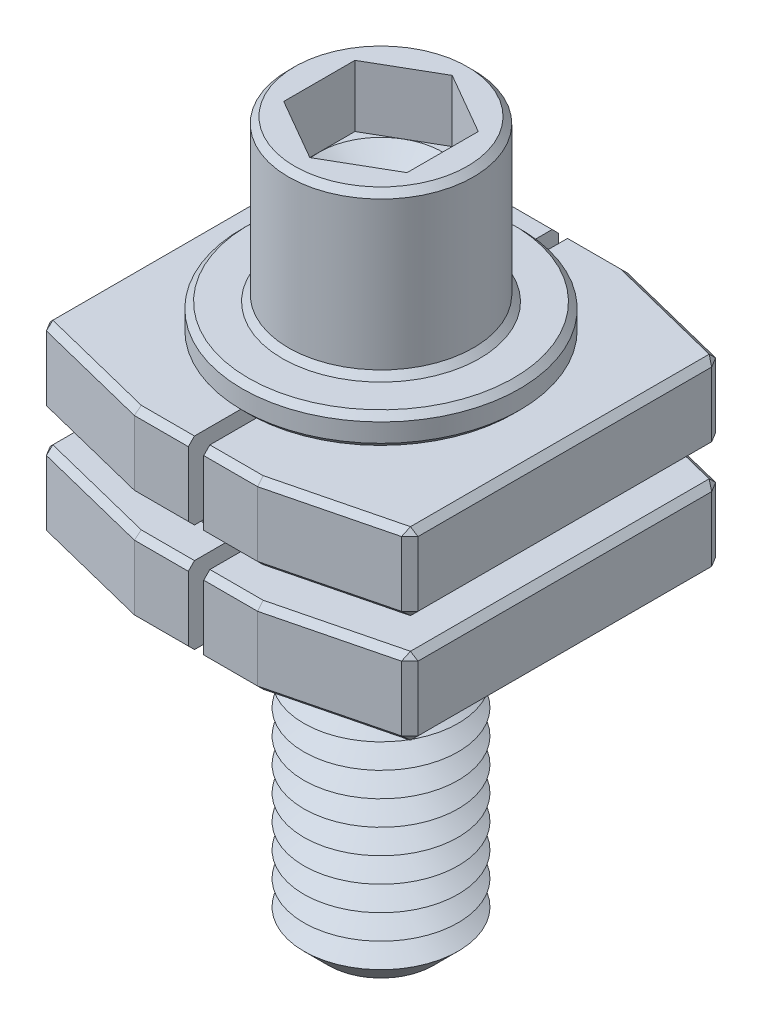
ISO-10303-21;
HEADER;
FILE_DESCRIPTION(('STEP AP214'),'2;1');
FILE_NAME('part.step','',(''),(''),'','','');
FILE_SCHEMA(('AUTOMOTIVE_DESIGN { 1 0 10303 214 1 1 1 1 }'));
ENDSEC;
DATA;
#1=APPLICATION_CONTEXT('core data for automotive mechanical design processes');
#2=APPLICATION_PROTOCOL_DEFINITION('international standard','automotive_design',2000,#1);
#3=PRODUCT_CONTEXT('',#1,'mechanical');
#4=PRODUCT('Part','Part','',(#3));
#5=PRODUCT_RELATED_PRODUCT_CATEGORY('part','',(#4));
#6=PRODUCT_DEFINITION_FORMATION('','',#4);
#7=PRODUCT_DEFINITION_CONTEXT('part definition',#1,'design');
#8=PRODUCT_DEFINITION('design','',#6,#7);
#9=PRODUCT_DEFINITION_SHAPE('','',#8);
#10=(LENGTH_UNIT() NAMED_UNIT(*) SI_UNIT(.MILLI.,.METRE.));
#11=(NAMED_UNIT(*) PLANE_ANGLE_UNIT() SI_UNIT($,.RADIAN.));
#12=(NAMED_UNIT(*) SI_UNIT($,.STERADIAN.) SOLID_ANGLE_UNIT());
#13=UNCERTAINTY_MEASURE_WITH_UNIT(LENGTH_MEASURE(1.E-05),#10,'distance_accuracy_value','');
#14=(GEOMETRIC_REPRESENTATION_CONTEXT(3) GLOBAL_UNCERTAINTY_ASSIGNED_CONTEXT((#13)) GLOBAL_UNIT_ASSIGNED_CONTEXT((#10,
#11,#12)) REPRESENTATION_CONTEXT('',''));
#15=CARTESIAN_POINT('',(0.,0.,0.));
#16=DIRECTION('',(0.,0.,1.));
#17=DIRECTION('',(1.,0.,0.));
#18=AXIS2_PLACEMENT_3D('',#15,#16,#17);
#19=CARTESIAN_POINT('',(0.,4.2,0.));
#20=DIRECTION('',(0.,1.,0.));
#21=DIRECTION('',(0.,0.,1.));
#22=AXIS2_PLACEMENT_3D('',#19,#20,#21);
#23=PLANE('',#22);
#24=CARTESIAN_POINT('',(0.,4.2,0.));
#25=DIRECTION('',(0.,1.,0.));
#26=DIRECTION('',(0.,0.,1.));
#27=AXIS2_PLACEMENT_3D('',#24,#25,#26);
#28=CIRCLE('',#27,2.);
#29=CARTESIAN_POINT('',(0.999999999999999,4.2,1.73205080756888));
#30=VERTEX_POINT('',#29);
#31=CARTESIAN_POINT('',(2.,4.2,0.));
#32=VERTEX_POINT('',#31);
#33=EDGE_CURVE('P0_E95',#30,#32,#28,.T.);
#34=ORIENTED_EDGE('',*,*,#33,.F.);
#35=DIRECTION('',(0.866025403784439,0.,-0.5));
#36=VECTOR('',#35,1.);
#37=CARTESIAN_POINT('',(0.,4.2,2.3094010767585));
#38=LINE('',#37,#36);
#39=CARTESIAN_POINT('',(2.,4.2,1.15470053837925));
#40=VERTEX_POINT('',#39);
#41=EDGE_CURVE('P0_E123',#30,#40,#38,.T.);
#42=ORIENTED_EDGE('',*,*,#41,.T.);
#43=DIRECTION('',(0.,0.,-1.));
#44=VECTOR('',#43,1.);
#45=CARTESIAN_POINT('',(2.,4.2,1.15470053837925));
#46=LINE('',#45,#44);
#47=EDGE_CURVE('P0_E119',#40,#32,#46,.T.);
#48=ORIENTED_EDGE('',*,*,#47,.T.);
#49=EDGE_LOOP('',(#34,#42,#48));
#50=FACE_BOUND('',#49,.T.);
#51=ADVANCED_FACE('P0_F16',(#50),#23,.T.);
#52=CARTESIAN_POINT('',(0.,4.2,0.));
#53=DIRECTION('',(0.,1.,0.));
#54=DIRECTION('',(0.,0.,1.));
#55=AXIS2_PLACEMENT_3D('',#52,#53,#54);
#56=CIRCLE('',#55,2.);
#57=CARTESIAN_POINT('',(1.,4.2,-1.73205080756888));
#58=VERTEX_POINT('',#57);
#59=EDGE_CURVE('P0_E97',#32,#58,#56,.T.);
#60=ORIENTED_EDGE('',*,*,#59,.F.);
#61=CARTESIAN_POINT('',(2.,4.2,-1.15470053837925));
#62=VERTEX_POINT('',#61);
#63=EDGE_CURVE('P0_E108',#32,#62,#46,.T.);
#64=ORIENTED_EDGE('',*,*,#63,.T.);
#65=DIRECTION('',(-0.866025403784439,0.,-0.5));
#66=VECTOR('',#65,1.);
#67=CARTESIAN_POINT('',(2.,4.2,-1.15470053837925));
#68=LINE('',#67,#66);
#69=EDGE_CURVE('P0_E111',#62,#58,#68,.T.);
#70=ORIENTED_EDGE('',*,*,#69,.T.);
#71=EDGE_LOOP('',(#60,#64,#70));
#72=FACE_BOUND('',#71,.T.);
#73=ADVANCED_FACE('P0_F107',(#72),#23,.T.);
#74=CARTESIAN_POINT('',(-1.,4.2,-1.73205080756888));
#75=VERTEX_POINT('',#74);
#76=EDGE_CURVE('P0_E113',#58,#75,#56,.T.);
#77=ORIENTED_EDGE('',*,*,#76,.F.);
#78=CARTESIAN_POINT('',(0.,4.2,-2.3094010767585));
#79=VERTEX_POINT('',#78);
#80=EDGE_CURVE('P0_E146',#58,#79,#68,.T.);
#81=ORIENTED_EDGE('',*,*,#80,.T.);
#82=DIRECTION('',(-0.866025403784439,0.,0.5));
#83=VECTOR('',#82,1.);
#84=CARTESIAN_POINT('',(0.,4.2,-2.3094010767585));
#85=LINE('',#84,#83);
#86=EDGE_CURVE('P0_E356',#79,#75,#85,.T.);
#87=ORIENTED_EDGE('',*,*,#86,.T.);
#88=EDGE_LOOP('',(#77,#81,#87));
#89=FACE_BOUND('',#88,.T.);
#90=ADVANCED_FACE('P0_F321',(#89),#23,.T.);
#91=CARTESIAN_POINT('',(-2.,4.2,0.));
#92=VERTEX_POINT('',#91);
#93=EDGE_CURVE('P0_E351',#75,#92,#56,.T.);
#94=ORIENTED_EDGE('',*,*,#93,.F.);
#95=CARTESIAN_POINT('',(-2.,4.2,-1.15470053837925));
#96=VERTEX_POINT('',#95);
#97=EDGE_CURVE('P0_E360',#75,#96,#85,.T.);
#98=ORIENTED_EDGE('',*,*,#97,.T.);
#99=DIRECTION('',(0.,0.,1.));
#100=VECTOR('',#99,1.);
#101=CARTESIAN_POINT('',(-2.,4.2,-1.15470053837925));
#102=LINE('',#101,#100);
#103=EDGE_CURVE('P0_E355',#96,#92,#102,.T.);
#104=ORIENTED_EDGE('',*,*,#103,.T.);
#105=EDGE_LOOP('',(#94,#98,#104));
#106=FACE_BOUND('',#105,.T.);
#107=ADVANCED_FACE('P0_F335',(#106),#23,.T.);
#108=CARTESIAN_POINT('',(-1.,4.2,1.73205080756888));
#109=VERTEX_POINT('',#108);
#110=EDGE_CURVE('P0_E31',#92,#109,#56,.T.);
#111=ORIENTED_EDGE('',*,*,#110,.F.);
#112=CARTESIAN_POINT('',(-2.,4.2,1.15470053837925));
#113=VERTEX_POINT('',#112);
#114=EDGE_CURVE('P0_E347',#92,#113,#102,.T.);
#115=ORIENTED_EDGE('',*,*,#114,.T.);
#116=DIRECTION('',(0.866025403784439,0.,0.5));
#117=VECTOR('',#116,1.);
#118=CARTESIAN_POINT('',(-2.,4.2,1.15470053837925));
#119=LINE('',#118,#117);
#120=EDGE_CURVE('P0_E350',#113,#109,#119,.T.);
#121=ORIENTED_EDGE('',*,*,#120,.T.);
#122=EDGE_LOOP('',(#111,#115,#121));
#123=FACE_BOUND('',#122,.T.);
#124=ADVANCED_FACE('P0_F326',(#123),#23,.T.);
#125=CARTESIAN_POINT('',(0.,65.2086077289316,0.));
#126=DIRECTION('',(0.,1.,0.));
#127=DIRECTION('',(0.,0.,1.));
#128=AXIS2_PLACEMENT_3D('',#125,#126,#127);
#129=CYLINDRICAL_SURFACE('',#128,4.50000000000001);
#130=CARTESIAN_POINT('',(0.,0.200000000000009,0.));
#131=DIRECTION('',(0.,-1.,0.));
#132=DIRECTION('',(0.,0.,-1.));
#133=AXIS2_PLACEMENT_3D('',#130,#131,#132);
#134=CIRCLE('',#133,4.50000000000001);
#135=CARTESIAN_POINT('',(0.,0.200000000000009,-4.50000000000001));
#136=VERTEX_POINT('',#135);
#137=EDGE_CURVE('P0_E283',#136,#136,#134,.F.);
#138=ORIENTED_EDGE('',*,*,#137,.T.);
#139=EDGE_LOOP('',(#138));
#140=FACE_BOUND('',#139,.T.);
#141=CARTESIAN_POINT('',(0.,0.800000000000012,0.));
#142=DIRECTION('',(0.,1.,0.));
#143=DIRECTION('',(0.,0.,1.));
#144=AXIS2_PLACEMENT_3D('',#141,#142,#143);
#145=CIRCLE('',#144,4.50000000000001);
#146=CARTESIAN_POINT('',(0.,0.800000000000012,4.50000000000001));
#147=VERTEX_POINT('',#146);
#148=EDGE_CURVE('P0_E112',#147,#147,#145,.F.);
#149=ORIENTED_EDGE('',*,*,#148,.T.);
#150=EDGE_LOOP('',(#149));
#151=FACE_BOUND('',#150,.T.);
#152=ADVANCED_FACE('P0_F334',(#140,#151),#129,.T.);
#153=CARTESIAN_POINT('',(0.,0.,4.50000000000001));
#154=DIRECTION('',(0.,-1.,0.));
#155=DIRECTION('',(0.,0.,-1.));
#156=AXIS2_PLACEMENT_3D('',#153,#154,#155);
#157=PLANE('',#156);
#158=CARTESIAN_POINT('',(0.,0.,0.));
#159=DIRECTION('',(0.,-1.,0.));
#160=DIRECTION('',(0.,0.,-1.));
#161=AXIS2_PLACEMENT_3D('',#158,#159,#160);
#162=CIRCLE('',#161,4.29999999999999);
#163=CARTESIAN_POINT('',(0.,0.,-4.29999999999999));
#164=VERTEX_POINT('',#163);
#165=EDGE_CURVE('P0_E286',#164,#164,#162,.T.);
#166=ORIENTED_EDGE('',*,*,#165,.T.);
#167=EDGE_LOOP('',(#166));
#168=FACE_BOUND('',#167,.T.);
#169=CARTESIAN_POINT('',(0.,0.,0.));
#170=DIRECTION('',(0.,1.,0.));
#171=DIRECTION('',(0.,0.,1.));
#172=AXIS2_PLACEMENT_3D('',#169,#170,#171);
#173=CIRCLE('',#172,2.5);
#174=CARTESIAN_POINT('',(0.,0.,2.5));
#175=VERTEX_POINT('',#174);
#176=EDGE_CURVE('P0_E275',#175,#175,#173,.T.);
#177=ORIENTED_EDGE('',*,*,#176,.T.);
#178=EDGE_LOOP('',(#177));
#179=FACE_BOUND('',#178,.T.);
#180=ADVANCED_FACE('P0_F341',(#168,#179),#157,.T.);
#181=CARTESIAN_POINT('',(0.,6.2,0.));
#182=DIRECTION('',(0.,1.,0.));
#183=DIRECTION('',(0.,0.,1.));
#184=AXIS2_PLACEMENT_3D('',#181,#182,#183);
#185=PLANE('',#184);
#186=CARTESIAN_POINT('',(0.,6.2,0.));
#187=DIRECTION('',(0.,1.,0.));
#188=DIRECTION('',(0.,0.,1.));
#189=AXIS2_PLACEMENT_3D('',#186,#187,#188);
#190=CIRCLE('',#189,2.80000000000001);
#191=CARTESIAN_POINT('',(0.,6.2,2.80000000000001));
#192=VERTEX_POINT('',#191);
#193=EDGE_CURVE('P0_E11',#192,#192,#190,.T.);
#194=ORIENTED_EDGE('',*,*,#193,.T.);
#195=EDGE_LOOP('',(#194));
#196=FACE_BOUND('',#195,.T.);
#197=DIRECTION('',(-0.866025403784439,0.,-0.5));
#198=VECTOR('',#197,1.);
#199=CARTESIAN_POINT('',(2.,6.2,-1.15470053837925));
#200=LINE('',#199,#198);
#201=CARTESIAN_POINT('',(2.,6.2,-1.15470053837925));
#202=VERTEX_POINT('',#201);
#203=CARTESIAN_POINT('',(0.,6.2,-2.3094010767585));
#204=VERTEX_POINT('',#203);
#205=EDGE_CURVE('P0_E39',#202,#204,#200,.T.);
#206=ORIENTED_EDGE('',*,*,#205,.F.);
#207=DIRECTION('',(0.,0.,-1.));
#208=VECTOR('',#207,1.);
#209=CARTESIAN_POINT('',(2.,6.2,1.15470053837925));
#210=LINE('',#209,#208);
#211=CARTESIAN_POINT('',(2.,6.2,1.15470053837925));
#212=VERTEX_POINT('',#211);
#213=EDGE_CURVE('P0_E144',#212,#202,#210,.T.);
#214=ORIENTED_EDGE('',*,*,#213,.F.);
#215=DIRECTION('',(0.866025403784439,0.,-0.5));
#216=VECTOR('',#215,1.);
#217=CARTESIAN_POINT('',(0.,6.2,2.3094010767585));
#218=LINE('',#217,#216);
#219=CARTESIAN_POINT('',(0.,6.2,2.3094010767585));
#220=VERTEX_POINT('',#219);
#221=EDGE_CURVE('P0_E141',#220,#212,#218,.T.);
#222=ORIENTED_EDGE('',*,*,#221,.F.);
#223=DIRECTION('',(0.866025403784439,0.,0.5));
#224=VECTOR('',#223,1.);
#225=CARTESIAN_POINT('',(-2.,6.2,1.15470053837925));
#226=LINE('',#225,#224);
#227=CARTESIAN_POINT('',(-2.,6.2,1.15470053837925));
#228=VERTEX_POINT('',#227);
#229=EDGE_CURVE('P0_E138',#228,#220,#226,.T.);
#230=ORIENTED_EDGE('',*,*,#229,.F.);
#231=DIRECTION('',(0.,0.,1.));
#232=VECTOR('',#231,1.);
#233=CARTESIAN_POINT('',(-2.,6.2,-1.15470053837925));
#234=LINE('',#233,#232);
#235=CARTESIAN_POINT('',(-2.,6.2,-1.15470053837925));
#236=VERTEX_POINT('',#235);
#237=EDGE_CURVE('P0_E135',#236,#228,#234,.T.);
#238=ORIENTED_EDGE('',*,*,#237,.F.);
#239=DIRECTION('',(-0.866025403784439,0.,0.5));
#240=VECTOR('',#239,1.);
#241=CARTESIAN_POINT('',(0.,6.2,-2.3094010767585));
#242=LINE('',#241,#240);
#243=EDGE_CURVE('P0_E132',#204,#236,#242,.T.);
#244=ORIENTED_EDGE('',*,*,#243,.F.);
#245=EDGE_LOOP('',(#206,#214,#222,#230,#238,#244));
#246=FACE_BOUND('',#245,.T.);
#247=ADVANCED_FACE('P0_F375',(#196,#246),#185,.T.);
#248=CARTESIAN_POINT('',(0.,65.2086077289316,0.));
#249=DIRECTION('',(0.,1.,0.));
#250=DIRECTION('',(0.,0.,1.));
#251=AXIS2_PLACEMENT_3D('',#248,#249,#250);
#252=CYLINDRICAL_SURFACE('',#251,3.00000000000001);
#253=CARTESIAN_POINT('',(0.,1.20000000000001,0.));
#254=DIRECTION('',(0.,1.,0.));
#255=DIRECTION('',(0.,0.,1.));
#256=AXIS2_PLACEMENT_3D('',#253,#254,#255);
#257=CIRCLE('',#256,3.00000000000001);
#258=CARTESIAN_POINT('',(0.,1.20000000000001,3.00000000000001));
#259=VERTEX_POINT('',#258);
#260=EDGE_CURVE('P0_E24',#259,#259,#257,.T.);
#261=ORIENTED_EDGE('',*,*,#260,.T.);
#262=EDGE_LOOP('',(#261));
#263=FACE_BOUND('',#262,.T.);
#264=CARTESIAN_POINT('',(0.,6.,0.));
#265=DIRECTION('',(0.,1.,0.));
#266=DIRECTION('',(0.,0.,1.));
#267=AXIS2_PLACEMENT_3D('',#264,#265,#266);
#268=CIRCLE('',#267,3.00000000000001);
#269=CARTESIAN_POINT('',(0.,6.,3.00000000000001));
#270=VERTEX_POINT('',#269);
#271=EDGE_CURVE('P0_E295',#270,#270,#268,.F.);
#272=ORIENTED_EDGE('',*,*,#271,.T.);
#273=EDGE_LOOP('',(#272));
#274=FACE_BOUND('',#273,.T.);
#275=ADVANCED_FACE('P0_F300',(#263,#274),#252,.T.);
#276=CARTESIAN_POINT('',(0.,1.,3.00000000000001));
#277=DIRECTION('',(0.,1.,0.));
#278=DIRECTION('',(0.,0.,1.));
#279=AXIS2_PLACEMENT_3D('',#276,#277,#278);
#280=PLANE('',#279);
#281=CARTESIAN_POINT('',(0.,1.,0.));
#282=DIRECTION('',(0.,1.,0.));
#283=DIRECTION('',(0.,0.,1.));
#284=AXIS2_PLACEMENT_3D('',#281,#282,#283);
#285=CIRCLE('',#284,4.30000000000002);
#286=CARTESIAN_POINT('',(0.,1.,4.30000000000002));
#287=VERTEX_POINT('',#286);
#288=EDGE_CURVE('P0_E292',#287,#287,#285,.T.);
#289=ORIENTED_EDGE('',*,*,#288,.T.);
#290=EDGE_LOOP('',(#289));
#291=FACE_BOUND('',#290,.T.);
#292=CARTESIAN_POINT('',(0.,1.,0.));
#293=DIRECTION('',(0.,1.,0.));
#294=DIRECTION('',(0.,0.,1.));
#295=AXIS2_PLACEMENT_3D('',#292,#293,#294);
#296=CIRCLE('',#295,3.20000000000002);
#297=CARTESIAN_POINT('',(0.,1.,3.20000000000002));
#298=VERTEX_POINT('',#297);
#299=EDGE_CURVE('P0_E289',#298,#298,#296,.F.);
#300=ORIENTED_EDGE('',*,*,#299,.T.);
#301=EDGE_LOOP('',(#300));
#302=FACE_BOUND('',#301,.T.);
#303=ADVANCED_FACE('P0_F434',(#291,#302),#280,.T.);
#304=CARTESIAN_POINT('',(0.,-0.399999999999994,0.));
#305=DIRECTION('',(0.,1.,0.));
#306=DIRECTION('',(0.,0.,1.));
#307=AXIS2_PLACEMENT_3D('',#304,#305,#306);
#308=CONICAL_SURFACE('',#307,1.80717967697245,1.0471975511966);
#309=ORIENTED_EDGE('',*,*,#176,.F.);
#310=EDGE_LOOP('',(#309));
#311=FACE_BOUND('',#310,.T.);
#312=CARTESIAN_POINT('',(0.,-0.399999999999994,0.));
#313=DIRECTION('',(0.,1.,0.));
#314=DIRECTION('',(0.,0.,1.));
#315=AXIS2_PLACEMENT_3D('',#312,#313,#314);
#316=CIRCLE('',#315,1.80717967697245);
#317=CARTESIAN_POINT('',(0.,-0.399999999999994,1.80717967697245));
#318=VERTEX_POINT('',#317);
#319=EDGE_CURVE('P0_E272',#318,#318,#316,.T.);
#320=ORIENTED_EDGE('',*,*,#319,.T.);
#321=EDGE_LOOP('',(#320));
#322=FACE_BOUND('',#321,.T.);
#323=ADVANCED_FACE('P0_F443',(#311,#322),#308,.T.);
#324=CARTESIAN_POINT('',(0.,-0.799999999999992,0.));
#325=DIRECTION('',(0.,-1.,0.));
#326=DIRECTION('',(0.,0.,-1.));
#327=AXIS2_PLACEMENT_3D('',#324,#325,#326);
#328=CONICAL_SURFACE('',#327,2.5,1.0471975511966);
#329=ORIENTED_EDGE('',*,*,#319,.F.);
#330=EDGE_LOOP('',(#329));
#331=FACE_BOUND('',#330,.T.);
#332=CARTESIAN_POINT('',(0.,-0.799999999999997,0.));
#333=DIRECTION('',(0.,1.,0.));
#334=DIRECTION('',(0.,0.,1.));
#335=AXIS2_PLACEMENT_3D('',#332,#333,#334);
#336=CIRCLE('',#335,2.5);
#337=CARTESIAN_POINT('',(0.,-0.799999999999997,2.5));
#338=VERTEX_POINT('',#337);
#339=EDGE_CURVE('P0_E269',#338,#338,#336,.T.);
#340=ORIENTED_EDGE('',*,*,#339,.T.);
#341=EDGE_LOOP('',(#340));
#342=FACE_BOUND('',#341,.T.);
#343=ADVANCED_FACE('P0_F453',(#331,#342),#328,.T.);
#344=CARTESIAN_POINT('',(0.,-1.19999999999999,0.));
#345=DIRECTION('',(0.,1.,0.));
#346=DIRECTION('',(0.,0.,1.));
#347=AXIS2_PLACEMENT_3D('',#344,#345,#346);
#348=CONICAL_SURFACE('',#347,1.80717967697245,1.0471975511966);
#349=ORIENTED_EDGE('',*,*,#339,.F.);
#350=EDGE_LOOP('',(#349));
#351=FACE_BOUND('',#350,.T.);
#352=CARTESIAN_POINT('',(0.,-1.19999999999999,0.));
#353=DIRECTION('',(0.,1.,0.));
#354=DIRECTION('',(0.,0.,1.));
#355=AXIS2_PLACEMENT_3D('',#352,#353,#354);
#356=CIRCLE('',#355,1.80717967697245);
#357=CARTESIAN_POINT('',(0.,-1.19999999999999,1.80717967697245));
#358=VERTEX_POINT('',#357);
#359=EDGE_CURVE('P0_E266',#358,#358,#356,.T.);
#360=ORIENTED_EDGE('',*,*,#359,.T.);
#361=EDGE_LOOP('',(#360));
#362=FACE_BOUND('',#361,.T.);
#363=ADVANCED_FACE('P0_F463',(#351,#362),#348,.T.);
#364=CARTESIAN_POINT('',(0.,-1.59999999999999,0.));
#365=DIRECTION('',(0.,-1.,0.));
#366=DIRECTION('',(0.,0.,-1.));
#367=AXIS2_PLACEMENT_3D('',#364,#365,#366);
#368=CONICAL_SURFACE('',#367,2.5,1.0471975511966);
#369=ORIENTED_EDGE('',*,*,#359,.F.);
#370=EDGE_LOOP('',(#369));
#371=FACE_BOUND('',#370,.T.);
#372=CARTESIAN_POINT('',(0.,-1.6,0.));
#373=DIRECTION('',(0.,1.,0.));
#374=DIRECTION('',(0.,0.,1.));
#375=AXIS2_PLACEMENT_3D('',#372,#373,#374);
#376=CIRCLE('',#375,2.5);
#377=CARTESIAN_POINT('',(0.,-1.6,2.5));
#378=VERTEX_POINT('',#377);
#379=EDGE_CURVE('P0_E263',#378,#378,#376,.T.);
#380=ORIENTED_EDGE('',*,*,#379,.T.);
#381=EDGE_LOOP('',(#380));
#382=FACE_BOUND('',#381,.T.);
#383=ADVANCED_FACE('P0_F473',(#371,#382),#368,.T.);
#384=CARTESIAN_POINT('',(0.,-1.99999999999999,0.));
#385=DIRECTION('',(0.,1.,0.));
#386=DIRECTION('',(0.,0.,1.));
#387=AXIS2_PLACEMENT_3D('',#384,#385,#386);
#388=CONICAL_SURFACE('',#387,1.80717967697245,1.0471975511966);
#389=ORIENTED_EDGE('',*,*,#379,.F.);
#390=EDGE_LOOP('',(#389));
#391=FACE_BOUND('',#390,.T.);
#392=CARTESIAN_POINT('',(0.,-1.99999999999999,0.));
#393=DIRECTION('',(0.,1.,0.));
#394=DIRECTION('',(0.,0.,1.));
#395=AXIS2_PLACEMENT_3D('',#392,#393,#394);
#396=CIRCLE('',#395,1.80717967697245);
#397=CARTESIAN_POINT('',(0.,-1.99999999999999,1.80717967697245));
#398=VERTEX_POINT('',#397);
#399=EDGE_CURVE('P0_E260',#398,#398,#396,.T.);
#400=ORIENTED_EDGE('',*,*,#399,.T.);
#401=EDGE_LOOP('',(#400));
#402=FACE_BOUND('',#401,.T.);
#403=ADVANCED_FACE('P0_F483',(#391,#402),#388,.T.);
#404=CARTESIAN_POINT('',(0.,-2.39999999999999,0.));
#405=DIRECTION('',(0.,-1.,0.));
#406=DIRECTION('',(0.,0.,-1.));
#407=AXIS2_PLACEMENT_3D('',#404,#405,#406);
#408=CONICAL_SURFACE('',#407,2.5,1.0471975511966);
#409=ORIENTED_EDGE('',*,*,#399,.F.);
#410=EDGE_LOOP('',(#409));
#411=FACE_BOUND('',#410,.T.);
#412=CARTESIAN_POINT('',(0.,-2.4,0.));
#413=DIRECTION('',(0.,1.,0.));
#414=DIRECTION('',(0.,0.,1.));
#415=AXIS2_PLACEMENT_3D('',#412,#413,#414);
#416=CIRCLE('',#415,2.5);
#417=CARTESIAN_POINT('',(0.,-2.4,2.5));
#418=VERTEX_POINT('',#417);
#419=EDGE_CURVE('P0_E257',#418,#418,#416,.T.);
#420=ORIENTED_EDGE('',*,*,#419,.T.);
#421=EDGE_LOOP('',(#420));
#422=FACE_BOUND('',#421,.T.);
#423=ADVANCED_FACE('P0_F493',(#411,#422),#408,.T.);
#424=CARTESIAN_POINT('',(0.,-2.79999999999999,0.));
#425=DIRECTION('',(0.,1.,0.));
#426=DIRECTION('',(0.,0.,1.));
#427=AXIS2_PLACEMENT_3D('',#424,#425,#426);
#428=CONICAL_SURFACE('',#427,1.80717967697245,1.0471975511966);
#429=ORIENTED_EDGE('',*,*,#419,.F.);
#430=EDGE_LOOP('',(#429));
#431=FACE_BOUND('',#430,.T.);
#432=CARTESIAN_POINT('',(0.,-2.79999999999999,0.));
#433=DIRECTION('',(0.,1.,0.));
#434=DIRECTION('',(0.,0.,1.));
#435=AXIS2_PLACEMENT_3D('',#432,#433,#434);
#436=CIRCLE('',#435,1.80717967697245);
#437=CARTESIAN_POINT('',(0.,-2.79999999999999,1.80717967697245));
#438=VERTEX_POINT('',#437);
#439=EDGE_CURVE('P0_E254',#438,#438,#436,.T.);
#440=ORIENTED_EDGE('',*,*,#439,.T.);
#441=EDGE_LOOP('',(#440));
#442=FACE_BOUND('',#441,.T.);
#443=ADVANCED_FACE('P0_F503',(#431,#442),#428,.T.);
#444=CARTESIAN_POINT('',(0.,-3.19999999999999,0.));
#445=DIRECTION('',(0.,-1.,0.));
#446=DIRECTION('',(0.,0.,-1.));
#447=AXIS2_PLACEMENT_3D('',#444,#445,#446);
#448=CONICAL_SURFACE('',#447,2.5,1.0471975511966);
#449=ORIENTED_EDGE('',*,*,#439,.F.);
#450=EDGE_LOOP('',(#449));
#451=FACE_BOUND('',#450,.T.);
#452=CARTESIAN_POINT('',(0.,-3.2,0.));
#453=DIRECTION('',(0.,1.,0.));
#454=DIRECTION('',(0.,0.,1.));
#455=AXIS2_PLACEMENT_3D('',#452,#453,#454);
#456=CIRCLE('',#455,2.5);
#457=CARTESIAN_POINT('',(0.,-3.2,2.5));
#458=VERTEX_POINT('',#457);
#459=EDGE_CURVE('P0_E251',#458,#458,#456,.T.);
#460=ORIENTED_EDGE('',*,*,#459,.T.);
#461=EDGE_LOOP('',(#460));
#462=FACE_BOUND('',#461,.T.);
#463=ADVANCED_FACE('P0_F513',(#451,#462),#448,.T.);
#464=CARTESIAN_POINT('',(0.,-3.59999999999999,0.));
#465=DIRECTION('',(0.,1.,0.));
#466=DIRECTION('',(0.,0.,1.));
#467=AXIS2_PLACEMENT_3D('',#464,#465,#466);
#468=CONICAL_SURFACE('',#467,1.80717967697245,1.0471975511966);
#469=ORIENTED_EDGE('',*,*,#459,.F.);
#470=EDGE_LOOP('',(#469));
#471=FACE_BOUND('',#470,.T.);
#472=CARTESIAN_POINT('',(0.,-3.59999999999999,0.));
#473=DIRECTION('',(0.,1.,0.));
#474=DIRECTION('',(0.,0.,1.));
#475=AXIS2_PLACEMENT_3D('',#472,#473,#474);
#476=CIRCLE('',#475,1.80717967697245);
#477=CARTESIAN_POINT('',(0.,-3.59999999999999,1.80717967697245));
#478=VERTEX_POINT('',#477);
#479=EDGE_CURVE('P0_E248',#478,#478,#476,.T.);
#480=ORIENTED_EDGE('',*,*,#479,.T.);
#481=EDGE_LOOP('',(#480));
#482=FACE_BOUND('',#481,.T.);
#483=ADVANCED_FACE('P0_F523',(#471,#482),#468,.T.);
#484=CARTESIAN_POINT('',(0.,-3.99999999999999,0.));
#485=DIRECTION('',(0.,-1.,0.));
#486=DIRECTION('',(0.,0.,-1.));
#487=AXIS2_PLACEMENT_3D('',#484,#485,#486);
#488=CONICAL_SURFACE('',#487,2.5,1.0471975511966);
#489=ORIENTED_EDGE('',*,*,#479,.F.);
#490=EDGE_LOOP('',(#489));
#491=FACE_BOUND('',#490,.T.);
#492=CARTESIAN_POINT('',(0.,-4.,0.));
#493=DIRECTION('',(0.,1.,0.));
#494=DIRECTION('',(0.,0.,1.));
#495=AXIS2_PLACEMENT_3D('',#492,#493,#494);
#496=CIRCLE('',#495,2.5);
#497=CARTESIAN_POINT('',(0.,-4.,2.5));
#498=VERTEX_POINT('',#497);
#499=EDGE_CURVE('P0_E245',#498,#498,#496,.T.);
#500=ORIENTED_EDGE('',*,*,#499,.T.);
#501=EDGE_LOOP('',(#500));
#502=FACE_BOUND('',#501,.T.);
#503=ADVANCED_FACE('P0_F533',(#491,#502),#488,.T.);
#504=CARTESIAN_POINT('',(0.,-4.39999999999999,0.));
#505=DIRECTION('',(0.,1.,0.));
#506=DIRECTION('',(0.,0.,1.));
#507=AXIS2_PLACEMENT_3D('',#504,#505,#506);
#508=CONICAL_SURFACE('',#507,1.80717967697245,1.0471975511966);
#509=ORIENTED_EDGE('',*,*,#499,.F.);
#510=EDGE_LOOP('',(#509));
#511=FACE_BOUND('',#510,.T.);
#512=CARTESIAN_POINT('',(0.,-4.39999999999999,0.));
#513=DIRECTION('',(0.,1.,0.));
#514=DIRECTION('',(0.,0.,1.));
#515=AXIS2_PLACEMENT_3D('',#512,#513,#514);
#516=CIRCLE('',#515,1.80717967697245);
#517=CARTESIAN_POINT('',(0.,-4.39999999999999,1.80717967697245));
#518=VERTEX_POINT('',#517);
#519=EDGE_CURVE('P0_E242',#518,#518,#516,.T.);
#520=ORIENTED_EDGE('',*,*,#519,.T.);
#521=EDGE_LOOP('',(#520));
#522=FACE_BOUND('',#521,.T.);
#523=ADVANCED_FACE('P0_F543',(#511,#522),#508,.T.);
#524=CARTESIAN_POINT('',(0.,-4.79999999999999,0.));
#525=DIRECTION('',(0.,-1.,0.));
#526=DIRECTION('',(0.,0.,-1.));
#527=AXIS2_PLACEMENT_3D('',#524,#525,#526);
#528=CONICAL_SURFACE('',#527,2.5,1.0471975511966);
#529=ORIENTED_EDGE('',*,*,#519,.F.);
#530=EDGE_LOOP('',(#529));
#531=FACE_BOUND('',#530,.T.);
#532=CARTESIAN_POINT('',(0.,-4.8,0.));
#533=DIRECTION('',(0.,1.,0.));
#534=DIRECTION('',(0.,0.,1.));
#535=AXIS2_PLACEMENT_3D('',#532,#533,#534);
#536=CIRCLE('',#535,2.5);
#537=CARTESIAN_POINT('',(0.,-4.8,2.5));
#538=VERTEX_POINT('',#537);
#539=EDGE_CURVE('P0_E239',#538,#538,#536,.T.);
#540=ORIENTED_EDGE('',*,*,#539,.T.);
#541=EDGE_LOOP('',(#540));
#542=FACE_BOUND('',#541,.T.);
#543=ADVANCED_FACE('P0_F553',(#531,#542),#528,.T.);
#544=CARTESIAN_POINT('',(0.,-5.19999999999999,0.));
#545=DIRECTION('',(0.,1.,0.));
#546=DIRECTION('',(0.,0.,1.));
#547=AXIS2_PLACEMENT_3D('',#544,#545,#546);
#548=CONICAL_SURFACE('',#547,1.80717967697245,1.0471975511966);
#549=ORIENTED_EDGE('',*,*,#539,.F.);
#550=EDGE_LOOP('',(#549));
#551=FACE_BOUND('',#550,.T.);
#552=CARTESIAN_POINT('',(0.,-5.19999999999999,0.));
#553=DIRECTION('',(0.,1.,0.));
#554=DIRECTION('',(0.,0.,1.));
#555=AXIS2_PLACEMENT_3D('',#552,#553,#554);
#556=CIRCLE('',#555,1.80717967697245);
#557=CARTESIAN_POINT('',(0.,-5.19999999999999,1.80717967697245));
#558=VERTEX_POINT('',#557);
#559=EDGE_CURVE('P0_E236',#558,#558,#556,.T.);
#560=ORIENTED_EDGE('',*,*,#559,.T.);
#561=EDGE_LOOP('',(#560));
#562=FACE_BOUND('',#561,.T.);
#563=ADVANCED_FACE('P0_F563',(#551,#562),#548,.T.);
#564=CARTESIAN_POINT('',(0.,-5.59999999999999,0.));
#565=DIRECTION('',(0.,-1.,0.));
#566=DIRECTION('',(0.,0.,-1.));
#567=AXIS2_PLACEMENT_3D('',#564,#565,#566);
#568=CONICAL_SURFACE('',#567,2.5,1.0471975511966);
#569=ORIENTED_EDGE('',*,*,#559,.F.);
#570=EDGE_LOOP('',(#569));
#571=FACE_BOUND('',#570,.T.);
#572=CARTESIAN_POINT('',(0.,-5.6,0.));
#573=DIRECTION('',(0.,1.,0.));
#574=DIRECTION('',(0.,0.,1.));
#575=AXIS2_PLACEMENT_3D('',#572,#573,#574);
#576=CIRCLE('',#575,2.5);
#577=CARTESIAN_POINT('',(0.,-5.6,2.5));
#578=VERTEX_POINT('',#577);
#579=EDGE_CURVE('P0_E233',#578,#578,#576,.T.);
#580=ORIENTED_EDGE('',*,*,#579,.T.);
#581=EDGE_LOOP('',(#580));
#582=FACE_BOUND('',#581,.T.);
#583=ADVANCED_FACE('P0_F573',(#571,#582),#568,.T.);
#584=CARTESIAN_POINT('',(0.,-5.99999999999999,0.));
#585=DIRECTION('',(0.,1.,0.));
#586=DIRECTION('',(0.,0.,1.));
#587=AXIS2_PLACEMENT_3D('',#584,#585,#586);
#588=CONICAL_SURFACE('',#587,1.80717967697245,1.0471975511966);
#589=ORIENTED_EDGE('',*,*,#579,.F.);
#590=EDGE_LOOP('',(#589));
#591=FACE_BOUND('',#590,.T.);
#592=CARTESIAN_POINT('',(0.,-5.99999999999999,0.));
#593=DIRECTION('',(0.,1.,0.));
#594=DIRECTION('',(0.,0.,1.));
#595=AXIS2_PLACEMENT_3D('',#592,#593,#594);
#596=CIRCLE('',#595,1.80717967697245);
#597=CARTESIAN_POINT('',(0.,-5.99999999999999,1.80717967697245));
#598=VERTEX_POINT('',#597);
#599=EDGE_CURVE('P0_E230',#598,#598,#596,.T.);
#600=ORIENTED_EDGE('',*,*,#599,.T.);
#601=EDGE_LOOP('',(#600));
#602=FACE_BOUND('',#601,.T.);
#603=ADVANCED_FACE('P0_F583',(#591,#602),#588,.T.);
#604=CARTESIAN_POINT('',(0.,-6.39999999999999,0.));
#605=DIRECTION('',(0.,-1.,0.));
#606=DIRECTION('',(0.,0.,-1.));
#607=AXIS2_PLACEMENT_3D('',#604,#605,#606);
#608=CONICAL_SURFACE('',#607,2.5,1.0471975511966);
#609=ORIENTED_EDGE('',*,*,#599,.F.);
#610=EDGE_LOOP('',(#609));
#611=FACE_BOUND('',#610,.T.);
#612=CARTESIAN_POINT('',(0.,-6.4,0.));
#613=DIRECTION('',(0.,1.,0.));
#614=DIRECTION('',(0.,0.,1.));
#615=AXIS2_PLACEMENT_3D('',#612,#613,#614);
#616=CIRCLE('',#615,2.5);
#617=CARTESIAN_POINT('',(0.,-6.4,2.5));
#618=VERTEX_POINT('',#617);
#619=EDGE_CURVE('P0_E227',#618,#618,#616,.T.);
#620=ORIENTED_EDGE('',*,*,#619,.T.);
#621=EDGE_LOOP('',(#620));
#622=FACE_BOUND('',#621,.T.);
#623=ADVANCED_FACE('P0_F593',(#611,#622),#608,.T.);
#624=CARTESIAN_POINT('',(0.,-6.79999999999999,0.));
#625=DIRECTION('',(0.,1.,0.));
#626=DIRECTION('',(0.,0.,1.));
#627=AXIS2_PLACEMENT_3D('',#624,#625,#626);
#628=CONICAL_SURFACE('',#627,1.80717967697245,1.0471975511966);
#629=ORIENTED_EDGE('',*,*,#619,.F.);
#630=EDGE_LOOP('',(#629));
#631=FACE_BOUND('',#630,.T.);
#632=CARTESIAN_POINT('',(0.,-6.79999999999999,0.));
#633=DIRECTION('',(0.,1.,0.));
#634=DIRECTION('',(0.,0.,1.));
#635=AXIS2_PLACEMENT_3D('',#632,#633,#634);
#636=CIRCLE('',#635,1.80717967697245);
#637=CARTESIAN_POINT('',(0.,-6.79999999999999,1.80717967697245));
#638=VERTEX_POINT('',#637);
#639=EDGE_CURVE('P0_E224',#638,#638,#636,.T.);
#640=ORIENTED_EDGE('',*,*,#639,.T.);
#641=EDGE_LOOP('',(#640));
#642=FACE_BOUND('',#641,.T.);
#643=ADVANCED_FACE('P0_F603',(#631,#642),#628,.T.);
#644=CARTESIAN_POINT('',(0.,-7.19999999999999,0.));
#645=DIRECTION('',(0.,-1.,0.));
#646=DIRECTION('',(0.,0.,-1.));
#647=AXIS2_PLACEMENT_3D('',#644,#645,#646);
#648=CONICAL_SURFACE('',#647,2.5,1.0471975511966);
#649=ORIENTED_EDGE('',*,*,#639,.F.);
#650=EDGE_LOOP('',(#649));
#651=FACE_BOUND('',#650,.T.);
#652=CARTESIAN_POINT('',(0.,-7.2,0.));
#653=DIRECTION('',(0.,1.,0.));
#654=DIRECTION('',(0.,0.,1.));
#655=AXIS2_PLACEMENT_3D('',#652,#653,#654);
#656=CIRCLE('',#655,2.5);
#657=CARTESIAN_POINT('',(0.,-7.2,2.5));
#658=VERTEX_POINT('',#657);
#659=EDGE_CURVE('P0_E221',#658,#658,#656,.T.);
#660=ORIENTED_EDGE('',*,*,#659,.T.);
#661=EDGE_LOOP('',(#660));
#662=FACE_BOUND('',#661,.T.);
#663=ADVANCED_FACE('P0_F613',(#651,#662),#648,.T.);
#664=CARTESIAN_POINT('',(0.,-7.6,0.));
#665=DIRECTION('',(0.,1.,0.));
#666=DIRECTION('',(0.,0.,1.));
#667=AXIS2_PLACEMENT_3D('',#664,#665,#666);
#668=CONICAL_SURFACE('',#667,1.80717967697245,1.0471975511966);
#669=ORIENTED_EDGE('',*,*,#659,.F.);
#670=EDGE_LOOP('',(#669));
#671=FACE_BOUND('',#670,.T.);
#672=CARTESIAN_POINT('',(0.,-7.6,0.));
#673=DIRECTION('',(0.,1.,0.));
#674=DIRECTION('',(0.,0.,1.));
#675=AXIS2_PLACEMENT_3D('',#672,#673,#674);
#676=CIRCLE('',#675,1.80717967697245);
#677=CARTESIAN_POINT('',(0.,-7.6,1.80717967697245));
#678=VERTEX_POINT('',#677);
#679=EDGE_CURVE('P0_E218',#678,#678,#676,.T.);
#680=ORIENTED_EDGE('',*,*,#679,.T.);
#681=EDGE_LOOP('',(#680));
#682=FACE_BOUND('',#681,.T.);
#683=ADVANCED_FACE('P0_F623',(#671,#682),#668,.T.);
#684=CARTESIAN_POINT('',(0.,-7.99999999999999,0.));
#685=DIRECTION('',(0.,-1.,0.));
#686=DIRECTION('',(0.,0.,-1.));
#687=AXIS2_PLACEMENT_3D('',#684,#685,#686);
#688=CONICAL_SURFACE('',#687,2.5,1.0471975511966);
#689=ORIENTED_EDGE('',*,*,#679,.F.);
#690=EDGE_LOOP('',(#689));
#691=FACE_BOUND('',#690,.T.);
#692=CARTESIAN_POINT('',(0.,-8.,0.));
#693=DIRECTION('',(0.,1.,0.));
#694=DIRECTION('',(0.,0.,1.));
#695=AXIS2_PLACEMENT_3D('',#692,#693,#694);
#696=CIRCLE('',#695,2.5);
#697=CARTESIAN_POINT('',(0.,-8.,2.5));
#698=VERTEX_POINT('',#697);
#699=EDGE_CURVE('P0_E215',#698,#698,#696,.T.);
#700=ORIENTED_EDGE('',*,*,#699,.T.);
#701=EDGE_LOOP('',(#700));
#702=FACE_BOUND('',#701,.T.);
#703=ADVANCED_FACE('P0_F633',(#691,#702),#688,.T.);
#704=CARTESIAN_POINT('',(0.,-8.4,0.));
#705=DIRECTION('',(0.,1.,0.));
#706=DIRECTION('',(0.,0.,1.));
#707=AXIS2_PLACEMENT_3D('',#704,#705,#706);
#708=CONICAL_SURFACE('',#707,1.80717967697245,1.0471975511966);
#709=ORIENTED_EDGE('',*,*,#699,.F.);
#710=EDGE_LOOP('',(#709));
#711=FACE_BOUND('',#710,.T.);
#712=CARTESIAN_POINT('',(0.,-8.4,0.));
#713=DIRECTION('',(0.,1.,0.));
#714=DIRECTION('',(0.,0.,1.));
#715=AXIS2_PLACEMENT_3D('',#712,#713,#714);
#716=CIRCLE('',#715,1.80717967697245);
#717=CARTESIAN_POINT('',(0.,-8.4,1.80717967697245));
#718=VERTEX_POINT('',#717);
#719=EDGE_CURVE('P0_E212',#718,#718,#716,.T.);
#720=ORIENTED_EDGE('',*,*,#719,.T.);
#721=EDGE_LOOP('',(#720));
#722=FACE_BOUND('',#721,.T.);
#723=ADVANCED_FACE('P0_F643',(#711,#722),#708,.T.);
#724=CARTESIAN_POINT('',(0.,-8.79999999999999,0.));
#725=DIRECTION('',(0.,-1.,0.));
#726=DIRECTION('',(0.,0.,-1.));
#727=AXIS2_PLACEMENT_3D('',#724,#725,#726);
#728=CONICAL_SURFACE('',#727,2.5,1.0471975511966);
#729=ORIENTED_EDGE('',*,*,#719,.F.);
#730=EDGE_LOOP('',(#729));
#731=FACE_BOUND('',#730,.T.);
#732=CARTESIAN_POINT('',(0.,-8.8,0.));
#733=DIRECTION('',(0.,1.,0.));
#734=DIRECTION('',(0.,0.,1.));
#735=AXIS2_PLACEMENT_3D('',#732,#733,#734);
#736=CIRCLE('',#735,2.5);
#737=CARTESIAN_POINT('',(0.,-8.8,2.5));
#738=VERTEX_POINT('',#737);
#739=EDGE_CURVE('P0_E209',#738,#738,#736,.T.);
#740=ORIENTED_EDGE('',*,*,#739,.T.);
#741=EDGE_LOOP('',(#740));
#742=FACE_BOUND('',#741,.T.);
#743=ADVANCED_FACE('P0_F653',(#731,#742),#728,.T.);
#744=CARTESIAN_POINT('',(0.,-9.19999999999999,0.));
#745=DIRECTION('',(0.,1.,0.));
#746=DIRECTION('',(0.,0.,1.));
#747=AXIS2_PLACEMENT_3D('',#744,#745,#746);
#748=CONICAL_SURFACE('',#747,1.80717967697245,1.0471975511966);
#749=ORIENTED_EDGE('',*,*,#739,.F.);
#750=EDGE_LOOP('',(#749));
#751=FACE_BOUND('',#750,.T.);
#752=CARTESIAN_POINT('',(0.,-9.19999999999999,0.));
#753=DIRECTION('',(0.,1.,0.));
#754=DIRECTION('',(0.,0.,1.));
#755=AXIS2_PLACEMENT_3D('',#752,#753,#754);
#756=CIRCLE('',#755,1.80717967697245);
#757=CARTESIAN_POINT('',(0.,-9.19999999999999,1.80717967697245));
#758=VERTEX_POINT('',#757);
#759=EDGE_CURVE('P0_E206',#758,#758,#756,.T.);
#760=ORIENTED_EDGE('',*,*,#759,.T.);
#761=EDGE_LOOP('',(#760));
#762=FACE_BOUND('',#761,.T.);
#763=ADVANCED_FACE('P0_F663',(#751,#762),#748,.T.);
#764=CARTESIAN_POINT('',(0.,-9.59999999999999,0.));
#765=DIRECTION('',(0.,-1.,0.));
#766=DIRECTION('',(0.,0.,-1.));
#767=AXIS2_PLACEMENT_3D('',#764,#765,#766);
#768=CONICAL_SURFACE('',#767,2.5,1.0471975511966);
#769=ORIENTED_EDGE('',*,*,#759,.F.);
#770=EDGE_LOOP('',(#769));
#771=FACE_BOUND('',#770,.T.);
#772=CARTESIAN_POINT('',(0.,-9.6,0.));
#773=DIRECTION('',(0.,1.,0.));
#774=DIRECTION('',(0.,0.,1.));
#775=AXIS2_PLACEMENT_3D('',#772,#773,#774);
#776=CIRCLE('',#775,2.5);
#777=CARTESIAN_POINT('',(0.,-9.6,2.5));
#778=VERTEX_POINT('',#777);
#779=EDGE_CURVE('P0_E203',#778,#778,#776,.T.);
#780=ORIENTED_EDGE('',*,*,#779,.T.);
#781=EDGE_LOOP('',(#780));
#782=FACE_BOUND('',#781,.T.);
#783=ADVANCED_FACE('P0_F673',(#771,#782),#768,.T.);
#784=CARTESIAN_POINT('',(0.,-9.99999999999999,0.));
#785=DIRECTION('',(0.,1.,0.));
#786=DIRECTION('',(0.,0.,1.));
#787=AXIS2_PLACEMENT_3D('',#784,#785,#786);
#788=CONICAL_SURFACE('',#787,1.80717967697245,1.0471975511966);
#789=ORIENTED_EDGE('',*,*,#779,.F.);
#790=EDGE_LOOP('',(#789));
#791=FACE_BOUND('',#790,.T.);
#792=CARTESIAN_POINT('',(0.,-9.99999999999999,0.));
#793=DIRECTION('',(0.,1.,0.));
#794=DIRECTION('',(0.,0.,1.));
#795=AXIS2_PLACEMENT_3D('',#792,#793,#794);
#796=CIRCLE('',#795,1.80717967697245);
#797=CARTESIAN_POINT('',(0.,-9.99999999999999,1.80717967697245));
#798=VERTEX_POINT('',#797);
#799=EDGE_CURVE('P0_E200',#798,#798,#796,.T.);
#800=ORIENTED_EDGE('',*,*,#799,.T.);
#801=EDGE_LOOP('',(#800));
#802=FACE_BOUND('',#801,.T.);
#803=ADVANCED_FACE('P0_F683',(#791,#802),#788,.T.);
#804=CARTESIAN_POINT('',(0.,-10.4,0.));
#805=DIRECTION('',(0.,-1.,0.));
#806=DIRECTION('',(0.,0.,-1.));
#807=AXIS2_PLACEMENT_3D('',#804,#805,#806);
#808=CONICAL_SURFACE('',#807,2.5,1.0471975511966);
#809=ORIENTED_EDGE('',*,*,#799,.F.);
#810=EDGE_LOOP('',(#809));
#811=FACE_BOUND('',#810,.T.);
#812=CARTESIAN_POINT('',(0.,-10.4,0.));
#813=DIRECTION('',(0.,1.,0.));
#814=DIRECTION('',(0.,0.,1.));
#815=AXIS2_PLACEMENT_3D('',#812,#813,#814);
#816=CIRCLE('',#815,2.5);
#817=CARTESIAN_POINT('',(0.,-10.4,2.5));
#818=VERTEX_POINT('',#817);
#819=EDGE_CURVE('P0_E197',#818,#818,#816,.T.);
#820=ORIENTED_EDGE('',*,*,#819,.T.);
#821=EDGE_LOOP('',(#820));
#822=FACE_BOUND('',#821,.T.);
#823=ADVANCED_FACE('P0_F693',(#811,#822),#808,.T.);
#824=CARTESIAN_POINT('',(0.,-10.8,0.));
#825=DIRECTION('',(0.,1.,0.));
#826=DIRECTION('',(0.,0.,1.));
#827=AXIS2_PLACEMENT_3D('',#824,#825,#826);
#828=CONICAL_SURFACE('',#827,1.80717967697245,1.0471975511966);
#829=ORIENTED_EDGE('',*,*,#819,.F.);
#830=EDGE_LOOP('',(#829));
#831=FACE_BOUND('',#830,.T.);
#832=CARTESIAN_POINT('',(0.,-10.8,0.));
#833=DIRECTION('',(0.,1.,0.));
#834=DIRECTION('',(0.,0.,1.));
#835=AXIS2_PLACEMENT_3D('',#832,#833,#834);
#836=CIRCLE('',#835,1.80717967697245);
#837=CARTESIAN_POINT('',(0.,-10.8,1.80717967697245));
#838=VERTEX_POINT('',#837);
#839=EDGE_CURVE('P0_E194',#838,#838,#836,.T.);
#840=ORIENTED_EDGE('',*,*,#839,.T.);
#841=EDGE_LOOP('',(#840));
#842=FACE_BOUND('',#841,.T.);
#843=ADVANCED_FACE('P0_F703',(#831,#842),#828,.T.);
#844=CARTESIAN_POINT('',(0.,-11.2,0.));
#845=DIRECTION('',(0.,-1.,0.));
#846=DIRECTION('',(0.,0.,-1.));
#847=AXIS2_PLACEMENT_3D('',#844,#845,#846);
#848=CONICAL_SURFACE('',#847,2.5,1.0471975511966);
#849=ORIENTED_EDGE('',*,*,#839,.F.);
#850=EDGE_LOOP('',(#849));
#851=FACE_BOUND('',#850,.T.);
#852=CARTESIAN_POINT('',(0.,-11.2,0.));
#853=DIRECTION('',(0.,1.,0.));
#854=DIRECTION('',(0.,0.,1.));
#855=AXIS2_PLACEMENT_3D('',#852,#853,#854);
#856=CIRCLE('',#855,2.5);
#857=CARTESIAN_POINT('',(0.,-11.2,2.5));
#858=VERTEX_POINT('',#857);
#859=EDGE_CURVE('P0_E191',#858,#858,#856,.T.);
#860=ORIENTED_EDGE('',*,*,#859,.T.);
#861=EDGE_LOOP('',(#860));
#862=FACE_BOUND('',#861,.T.);
#863=ADVANCED_FACE('P0_F713',(#851,#862),#848,.T.);
#864=CARTESIAN_POINT('',(0.,-11.6,0.));
#865=DIRECTION('',(0.,1.,0.));
#866=DIRECTION('',(0.,0.,1.));
#867=AXIS2_PLACEMENT_3D('',#864,#865,#866);
#868=CONICAL_SURFACE('',#867,1.80717967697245,1.0471975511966);
#869=ORIENTED_EDGE('',*,*,#859,.F.);
#870=EDGE_LOOP('',(#869));
#871=FACE_BOUND('',#870,.T.);
#872=CARTESIAN_POINT('',(0.,-11.6,0.));
#873=DIRECTION('',(0.,1.,0.));
#874=DIRECTION('',(0.,0.,1.));
#875=AXIS2_PLACEMENT_3D('',#872,#873,#874);
#876=CIRCLE('',#875,1.80717967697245);
#877=CARTESIAN_POINT('',(0.,-11.6,1.80717967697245));
#878=VERTEX_POINT('',#877);
#879=EDGE_CURVE('P0_E188',#878,#878,#876,.T.);
#880=ORIENTED_EDGE('',*,*,#879,.T.);
#881=EDGE_LOOP('',(#880));
#882=FACE_BOUND('',#881,.T.);
#883=ADVANCED_FACE('P0_F723',(#871,#882),#868,.T.);
#884=CARTESIAN_POINT('',(0.,-12.,0.));
#885=DIRECTION('',(0.,-1.,0.));
#886=DIRECTION('',(0.,0.,-1.));
#887=AXIS2_PLACEMENT_3D('',#884,#885,#886);
#888=CONICAL_SURFACE('',#887,2.5,1.0471975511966);
#889=ORIENTED_EDGE('',*,*,#879,.F.);
#890=EDGE_LOOP('',(#889));
#891=FACE_BOUND('',#890,.T.);
#892=CARTESIAN_POINT('',(0.,-12.,0.));
#893=DIRECTION('',(0.,1.,0.));
#894=DIRECTION('',(0.,0.,1.));
#895=AXIS2_PLACEMENT_3D('',#892,#893,#894);
#896=CIRCLE('',#895,2.5);
#897=CARTESIAN_POINT('',(0.,-12.,2.5));
#898=VERTEX_POINT('',#897);
#899=EDGE_CURVE('P0_E185',#898,#898,#896,.T.);
#900=ORIENTED_EDGE('',*,*,#899,.T.);
#901=EDGE_LOOP('',(#900));
#902=FACE_BOUND('',#901,.T.);
#903=ADVANCED_FACE('P0_F733',(#891,#902),#888,.T.);
#904=CARTESIAN_POINT('',(0.,-12.4,0.));
#905=DIRECTION('',(0.,1.,0.));
#906=DIRECTION('',(0.,0.,1.));
#907=AXIS2_PLACEMENT_3D('',#904,#905,#906);
#908=CONICAL_SURFACE('',#907,1.80717967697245,1.0471975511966);
#909=ORIENTED_EDGE('',*,*,#899,.F.);
#910=EDGE_LOOP('',(#909));
#911=FACE_BOUND('',#910,.T.);
#912=CARTESIAN_POINT('',(0.,-12.4,0.));
#913=DIRECTION('',(0.,1.,0.));
#914=DIRECTION('',(0.,0.,1.));
#915=AXIS2_PLACEMENT_3D('',#912,#913,#914);
#916=CIRCLE('',#915,1.80717967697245);
#917=CARTESIAN_POINT('',(0.,-12.4,1.80717967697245));
#918=VERTEX_POINT('',#917);
#919=EDGE_CURVE('P0_E182',#918,#918,#916,.T.);
#920=ORIENTED_EDGE('',*,*,#919,.T.);
#921=EDGE_LOOP('',(#920));
#922=FACE_BOUND('',#921,.T.);
#923=ADVANCED_FACE('P0_F743',(#911,#922),#908,.T.);
#924=CARTESIAN_POINT('',(0.,-12.8,0.));
#925=DIRECTION('',(0.,-1.,0.));
#926=DIRECTION('',(0.,0.,-1.));
#927=AXIS2_PLACEMENT_3D('',#924,#925,#926);
#928=CONICAL_SURFACE('',#927,2.5,1.0471975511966);
#929=ORIENTED_EDGE('',*,*,#919,.F.);
#930=EDGE_LOOP('',(#929));
#931=FACE_BOUND('',#930,.T.);
#932=CARTESIAN_POINT('',(0.,-12.8,0.));
#933=DIRECTION('',(0.,1.,0.));
#934=DIRECTION('',(0.,0.,1.));
#935=AXIS2_PLACEMENT_3D('',#932,#933,#934);
#936=CIRCLE('',#935,2.5);
#937=CARTESIAN_POINT('',(0.,-12.8,2.5));
#938=VERTEX_POINT('',#937);
#939=EDGE_CURVE('P0_E179',#938,#938,#936,.T.);
#940=ORIENTED_EDGE('',*,*,#939,.T.);
#941=EDGE_LOOP('',(#940));
#942=FACE_BOUND('',#941,.T.);
#943=ADVANCED_FACE('P0_F753',(#931,#942),#928,.T.);
#944=CARTESIAN_POINT('',(0.,-13.2,0.));
#945=DIRECTION('',(0.,1.,0.));
#946=DIRECTION('',(0.,0.,1.));
#947=AXIS2_PLACEMENT_3D('',#944,#945,#946);
#948=CONICAL_SURFACE('',#947,1.80717967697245,1.0471975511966);
#949=ORIENTED_EDGE('',*,*,#939,.F.);
#950=EDGE_LOOP('',(#949));
#951=FACE_BOUND('',#950,.T.);
#952=CARTESIAN_POINT('',(0.,-13.2,0.));
#953=DIRECTION('',(0.,1.,0.));
#954=DIRECTION('',(0.,0.,1.));
#955=AXIS2_PLACEMENT_3D('',#952,#953,#954);
#956=CIRCLE('',#955,1.80717967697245);
#957=CARTESIAN_POINT('',(0.,-13.2,1.80717967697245));
#958=VERTEX_POINT('',#957);
#959=EDGE_CURVE('P0_E176',#958,#958,#956,.T.);
#960=ORIENTED_EDGE('',*,*,#959,.T.);
#961=EDGE_LOOP('',(#960));
#962=FACE_BOUND('',#961,.T.);
#963=ADVANCED_FACE('P0_F763',(#951,#962),#948,.T.);
#964=CARTESIAN_POINT('',(0.,-13.6,0.));
#965=DIRECTION('',(0.,-1.,0.));
#966=DIRECTION('',(0.,0.,-1.));
#967=AXIS2_PLACEMENT_3D('',#964,#965,#966);
#968=CONICAL_SURFACE('',#967,2.5,1.0471975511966);
#969=ORIENTED_EDGE('',*,*,#959,.F.);
#970=EDGE_LOOP('',(#969));
#971=FACE_BOUND('',#970,.T.);
#972=CARTESIAN_POINT('',(0.,-13.6,0.));
#973=DIRECTION('',(0.,1.,0.));
#974=DIRECTION('',(0.,0.,1.));
#975=AXIS2_PLACEMENT_3D('',#972,#973,#974);
#976=CIRCLE('',#975,2.5);
#977=CARTESIAN_POINT('',(0.,-13.6,2.5));
#978=VERTEX_POINT('',#977);
#979=EDGE_CURVE('P0_E173',#978,#978,#976,.T.);
#980=ORIENTED_EDGE('',*,*,#979,.T.);
#981=EDGE_LOOP('',(#980));
#982=FACE_BOUND('',#981,.T.);
#983=ADVANCED_FACE('P0_F773',(#971,#982),#968,.T.);
#984=CARTESIAN_POINT('',(0.,-14.,0.));
#985=DIRECTION('',(0.,1.,0.));
#986=DIRECTION('',(0.,0.,1.));
#987=AXIS2_PLACEMENT_3D('',#984,#985,#986);
#988=CONICAL_SURFACE('',#987,1.80717967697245,1.0471975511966);
#989=ORIENTED_EDGE('',*,*,#979,.F.);
#990=EDGE_LOOP('',(#989));
#991=FACE_BOUND('',#990,.T.);
#992=CARTESIAN_POINT('',(0.,-14.,0.));
#993=DIRECTION('',(0.,1.,0.));
#994=DIRECTION('',(0.,0.,1.));
#995=AXIS2_PLACEMENT_3D('',#992,#993,#994);
#996=CIRCLE('',#995,1.80717967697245);
#997=CARTESIAN_POINT('',(0.,-14.,1.80717967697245));
#998=VERTEX_POINT('',#997);
#999=EDGE_CURVE('P0_E170',#998,#998,#996,.T.);
#1000=ORIENTED_EDGE('',*,*,#999,.T.);
#1001=EDGE_LOOP('',(#1000));
#1002=FACE_BOUND('',#1001,.T.);
#1003=ADVANCED_FACE('P0_F783',(#991,#1002),#988,.T.);
#1004=CARTESIAN_POINT('',(0.,-14.4,0.));
#1005=DIRECTION('',(0.,-1.,0.));
#1006=DIRECTION('',(0.,0.,-1.));
#1007=AXIS2_PLACEMENT_3D('',#1004,#1005,#1006);
#1008=CONICAL_SURFACE('',#1007,2.5,1.0471975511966);
#1009=ORIENTED_EDGE('',*,*,#999,.F.);
#1010=EDGE_LOOP('',(#1009));
#1011=FACE_BOUND('',#1010,.T.);
#1012=CARTESIAN_POINT('',(0.,-14.4,0.));
#1013=DIRECTION('',(0.,1.,0.));
#1014=DIRECTION('',(0.,0.,1.));
#1015=AXIS2_PLACEMENT_3D('',#1012,#1013,#1014);
#1016=CIRCLE('',#1015,2.5);
#1017=CARTESIAN_POINT('',(0.,-14.4,2.5));
#1018=VERTEX_POINT('',#1017);
#1019=EDGE_CURVE('P0_E167',#1018,#1018,#1016,.T.);
#1020=ORIENTED_EDGE('',*,*,#1019,.T.);
#1021=EDGE_LOOP('',(#1020));
#1022=FACE_BOUND('',#1021,.T.);
#1023=ADVANCED_FACE('P0_F793',(#1011,#1022),#1008,.T.);
#1024=CARTESIAN_POINT('',(0.,-14.8,0.));
#1025=DIRECTION('',(0.,1.,0.));
#1026=DIRECTION('',(0.,0.,1.));
#1027=AXIS2_PLACEMENT_3D('',#1024,#1025,#1026);
#1028=CONICAL_SURFACE('',#1027,1.80717967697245,1.0471975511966);
#1029=ORIENTED_EDGE('',*,*,#1019,.F.);
#1030=EDGE_LOOP('',(#1029));
#1031=FACE_BOUND('',#1030,.T.);
#1032=CARTESIAN_POINT('',(0.,-14.8,0.));
#1033=DIRECTION('',(0.,1.,0.));
#1034=DIRECTION('',(0.,0.,1.));
#1035=AXIS2_PLACEMENT_3D('',#1032,#1033,#1034);
#1036=CIRCLE('',#1035,1.80717967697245);
#1037=CARTESIAN_POINT('',(0.,-14.8,1.80717967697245));
#1038=VERTEX_POINT('',#1037);
#1039=EDGE_CURVE('P0_E164',#1038,#1038,#1036,.T.);
#1040=ORIENTED_EDGE('',*,*,#1039,.T.);
#1041=EDGE_LOOP('',(#1040));
#1042=FACE_BOUND('',#1041,.T.);
#1043=ADVANCED_FACE('P0_F803',(#1031,#1042),#1028,.T.);
#1044=CARTESIAN_POINT('',(0.,-15.2,0.));
#1045=DIRECTION('',(0.,-1.,0.));
#1046=DIRECTION('',(0.,0.,-1.));
#1047=AXIS2_PLACEMENT_3D('',#1044,#1045,#1046);
#1048=CONICAL_SURFACE('',#1047,2.5,1.0471975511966);
#1049=ORIENTED_EDGE('',*,*,#1039,.F.);
#1050=EDGE_LOOP('',(#1049));
#1051=FACE_BOUND('',#1050,.T.);
#1052=CARTESIAN_POINT('',(0.,-15.2,0.));
#1053=DIRECTION('',(0.,1.,0.));
#1054=DIRECTION('',(0.,0.,1.));
#1055=AXIS2_PLACEMENT_3D('',#1052,#1053,#1054);
#1056=CIRCLE('',#1055,2.5);
#1057=CARTESIAN_POINT('',(0.,-15.2,2.5));
#1058=VERTEX_POINT('',#1057);
#1059=EDGE_CURVE('P0_E161',#1058,#1058,#1056,.T.);
#1060=ORIENTED_EDGE('',*,*,#1059,.T.);
#1061=EDGE_LOOP('',(#1060));
#1062=FACE_BOUND('',#1061,.T.);
#1063=ADVANCED_FACE('P0_F813',(#1051,#1062),#1048,.T.);
#1064=CARTESIAN_POINT('',(0.,-15.6,0.));
#1065=DIRECTION('',(0.,1.,0.));
#1066=DIRECTION('',(0.,0.,1.));
#1067=AXIS2_PLACEMENT_3D('',#1064,#1065,#1066);
#1068=CONICAL_SURFACE('',#1067,1.80717967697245,1.0471975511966);
#1069=ORIENTED_EDGE('',*,*,#1059,.F.);
#1070=EDGE_LOOP('',(#1069));
#1071=FACE_BOUND('',#1070,.T.);
#1072=CARTESIAN_POINT('',(0.,-15.6,0.));
#1073=DIRECTION('',(0.,1.,0.));
#1074=DIRECTION('',(0.,0.,1.));
#1075=AXIS2_PLACEMENT_3D('',#1072,#1073,#1074);
#1076=CIRCLE('',#1075,1.80717967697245);
#1077=CARTESIAN_POINT('',(0.,-15.6,1.80717967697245));
#1078=VERTEX_POINT('',#1077);
#1079=EDGE_CURVE('P0_E158',#1078,#1078,#1076,.T.);
#1080=ORIENTED_EDGE('',*,*,#1079,.T.);
#1081=EDGE_LOOP('',(#1080));
#1082=FACE_BOUND('',#1081,.T.);
#1083=ADVANCED_FACE('P0_F823',(#1071,#1082),#1068,.T.);
#1084=CARTESIAN_POINT('',(0.,-16.,0.));
#1085=DIRECTION('',(0.,-1.,0.));
#1086=DIRECTION('',(0.,0.,-1.));
#1087=AXIS2_PLACEMENT_3D('',#1084,#1085,#1086);
#1088=CONICAL_SURFACE('',#1087,2.5,1.0471975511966);
#1089=ORIENTED_EDGE('',*,*,#1079,.F.);
#1090=EDGE_LOOP('',(#1089));
#1091=FACE_BOUND('',#1090,.T.);
#1092=CARTESIAN_POINT('',(0.,-16.,0.));
#1093=DIRECTION('',(0.,1.,0.));
#1094=DIRECTION('',(0.,0.,1.));
#1095=AXIS2_PLACEMENT_3D('',#1092,#1093,#1094);
#1096=CIRCLE('',#1095,2.5);
#1097=CARTESIAN_POINT('',(0.,-16.,2.5));
#1098=VERTEX_POINT('',#1097);
#1099=EDGE_CURVE('P0_E148',#1098,#1098,#1096,.T.);
#1100=ORIENTED_EDGE('',*,*,#1099,.T.);
#1101=EDGE_LOOP('',(#1100));
#1102=FACE_BOUND('',#1101,.T.);
#1103=ADVANCED_FACE('P0_F833',(#1091,#1102),#1088,.T.);
#1104=CARTESIAN_POINT('',(0.,-16.8,2.5));
#1105=DIRECTION('',(0.,-1.,0.));
#1106=DIRECTION('',(0.,0.,-1.));
#1107=AXIS2_PLACEMENT_3D('',#1104,#1105,#1106);
#1108=PLANE('',#1107);
#1109=CARTESIAN_POINT('',(0.,-16.8,0.));
#1110=DIRECTION('',(0.,-1.,0.));
#1111=DIRECTION('',(0.,0.,-1.));
#1112=AXIS2_PLACEMENT_3D('',#1109,#1110,#1111);
#1113=CIRCLE('',#1112,1.69999999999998);
#1114=CARTESIAN_POINT('',(0.,-16.8,-1.69999999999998));
#1115=VERTEX_POINT('',#1114);
#1116=EDGE_CURVE('P0_E278',#1115,#1115,#1113,.T.);
#1117=ORIENTED_EDGE('',*,*,#1116,.T.);
#1118=EDGE_LOOP('',(#1117));
#1119=FACE_BOUND('',#1118,.T.);
#1120=ADVANCED_FACE('P0_F843',(#1119),#1108,.T.);
#1121=CARTESIAN_POINT('',(0.,-16.,0.));
#1122=DIRECTION('',(0.,1.,0.));
#1123=DIRECTION('',(0.,0.,1.));
#1124=AXIS2_PLACEMENT_3D('',#1121,#1122,#1123);
#1125=CONICAL_SURFACE('',#1124,2.5,0.785398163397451);
#1126=ORIENTED_EDGE('',*,*,#1116,.F.);
#1127=EDGE_LOOP('',(#1126));
#1128=FACE_BOUND('',#1127,.T.);
#1129=ORIENTED_EDGE('',*,*,#1099,.F.);
#1130=EDGE_LOOP('',(#1129));
#1131=FACE_BOUND('',#1130,.T.);
#1132=ADVANCED_FACE('P0_F853',(#1128,#1131),#1125,.T.);
#1133=CARTESIAN_POINT('',(2.,4.2,-1.15470053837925));
#1134=DIRECTION('',(0.5,0.,-0.866025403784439));
#1135=DIRECTION('',(-0.866025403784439,0.,-0.5));
#1136=AXIS2_PLACEMENT_3D('',#1133,#1134,#1135);
#1137=PLANE('',#1136);
#1138=ORIENTED_EDGE('',*,*,#205,.T.);
#1139=DIRECTION('',(0.,1.,0.));
#1140=VECTOR('',#1139,1.);
#1141=CARTESIAN_POINT('',(0.,4.2,-2.3094010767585));
#1142=LINE('',#1141,#1140);
#1143=EDGE_CURVE('P0_E125',#79,#204,#1142,.T.);
#1144=ORIENTED_EDGE('',*,*,#1143,.F.);
#1145=ORIENTED_EDGE('',*,*,#80,.F.);
#1146=ORIENTED_EDGE('',*,*,#69,.F.);
#1147=DIRECTION('',(0.,1.,0.));
#1148=VECTOR('',#1147,1.);
#1149=CARTESIAN_POINT('',(2.,4.2,-1.15470053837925));
#1150=LINE('',#1149,#1148);
#1151=EDGE_CURVE('P0_E120',#62,#202,#1150,.T.);
#1152=ORIENTED_EDGE('',*,*,#1151,.T.);
#1153=EDGE_LOOP('',(#1138,#1144,#1145,#1146,#1152));
#1154=FACE_BOUND('',#1153,.T.);
#1155=ADVANCED_FACE('P0_F381',(#1154),#1137,.F.);
#1156=CARTESIAN_POINT('',(2.,4.2,1.15470053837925));
#1157=DIRECTION('',(1.,0.,0.));
#1158=DIRECTION('',(0.,0.,-1.));
#1159=AXIS2_PLACEMENT_3D('',#1156,#1157,#1158);
#1160=PLANE('',#1159);
#1161=ORIENTED_EDGE('',*,*,#213,.T.);
#1162=ORIENTED_EDGE('',*,*,#1151,.F.);
#1163=ORIENTED_EDGE('',*,*,#63,.F.);
#1164=ORIENTED_EDGE('',*,*,#47,.F.);
#1165=DIRECTION('',(0.,1.,0.));
#1166=VECTOR('',#1165,1.);
#1167=CARTESIAN_POINT('',(2.,4.2,1.15470053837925));
#1168=LINE('',#1167,#1166);
#1169=EDGE_CURVE('P0_E149',#40,#212,#1168,.T.);
#1170=ORIENTED_EDGE('',*,*,#1169,.T.);
#1171=EDGE_LOOP('',(#1161,#1162,#1163,#1164,#1170));
#1172=FACE_BOUND('',#1171,.T.);
#1173=ADVANCED_FACE('P0_F118',(#1172),#1160,.F.);
#1174=CARTESIAN_POINT('',(0.,4.2,2.3094010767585));
#1175=DIRECTION('',(0.5,0.,0.866025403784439));
#1176=DIRECTION('',(0.866025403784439,0.,-0.5));
#1177=AXIS2_PLACEMENT_3D('',#1174,#1175,#1176);
#1178=PLANE('',#1177);
#1179=ORIENTED_EDGE('',*,*,#221,.T.);
#1180=ORIENTED_EDGE('',*,*,#1169,.F.);
#1181=ORIENTED_EDGE('',*,*,#41,.F.);
#1182=CARTESIAN_POINT('',(0.,4.2,2.3094010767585));
#1183=VERTEX_POINT('',#1182);
#1184=EDGE_CURVE('P0_E121',#1183,#30,#38,.T.);
#1185=ORIENTED_EDGE('',*,*,#1184,.F.);
#1186=DIRECTION('',(0.,1.,0.));
#1187=VECTOR('',#1186,1.);
#1188=CARTESIAN_POINT('',(0.,4.2,2.3094010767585));
#1189=LINE('',#1188,#1187);
#1190=EDGE_CURVE('P0_E151',#1183,#220,#1189,.T.);
#1191=ORIENTED_EDGE('',*,*,#1190,.T.);
#1192=EDGE_LOOP('',(#1179,#1180,#1181,#1185,#1191));
#1193=FACE_BOUND('',#1192,.T.);
#1194=ADVANCED_FACE('P0_F370',(#1193),#1178,.F.);
#1195=CARTESIAN_POINT('',(-2.,4.2,1.15470053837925));
#1196=DIRECTION('',(-0.5,0.,0.866025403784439));
#1197=DIRECTION('',(0.866025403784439,0.,0.5));
#1198=AXIS2_PLACEMENT_3D('',#1195,#1196,#1197);
#1199=PLANE('',#1198);
#1200=ORIENTED_EDGE('',*,*,#229,.T.);
#1201=ORIENTED_EDGE('',*,*,#1190,.F.);
#1202=EDGE_CURVE('P0_E362',#109,#1183,#119,.T.);
#1203=ORIENTED_EDGE('',*,*,#1202,.F.);
#1204=ORIENTED_EDGE('',*,*,#120,.F.);
#1205=DIRECTION('',(0.,1.,0.));
#1206=VECTOR('',#1205,1.);
#1207=CARTESIAN_POINT('',(-2.,4.2,1.15470053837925));
#1208=LINE('',#1207,#1206);
#1209=EDGE_CURVE('P0_E153',#113,#228,#1208,.T.);
#1210=ORIENTED_EDGE('',*,*,#1209,.T.);
#1211=EDGE_LOOP('',(#1200,#1201,#1203,#1204,#1210));
#1212=FACE_BOUND('',#1211,.T.);
#1213=ADVANCED_FACE('P0_F887',(#1212),#1199,.F.);
#1214=CARTESIAN_POINT('',(-2.,4.2,-1.15470053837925));
#1215=DIRECTION('',(-1.,0.,0.));
#1216=DIRECTION('',(0.,0.,1.));
#1217=AXIS2_PLACEMENT_3D('',#1214,#1215,#1216);
#1218=PLANE('',#1217);
#1219=ORIENTED_EDGE('',*,*,#237,.T.);
#1220=ORIENTED_EDGE('',*,*,#1209,.F.);
#1221=ORIENTED_EDGE('',*,*,#114,.F.);
#1222=ORIENTED_EDGE('',*,*,#103,.F.);
#1223=DIRECTION('',(0.,1.,0.));
#1224=VECTOR('',#1223,1.);
#1225=CARTESIAN_POINT('',(-2.,4.2,-1.15470053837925));
#1226=LINE('',#1225,#1224);
#1227=EDGE_CURVE('P0_E126',#96,#236,#1226,.T.);
#1228=ORIENTED_EDGE('',*,*,#1227,.T.);
#1229=EDGE_LOOP('',(#1219,#1220,#1221,#1222,#1228));
#1230=FACE_BOUND('',#1229,.T.);
#1231=ADVANCED_FACE('P0_F330',(#1230),#1218,.F.);
#1232=CARTESIAN_POINT('',(0.,4.2,-2.3094010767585));
#1233=DIRECTION('',(-0.5,0.,-0.866025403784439));
#1234=DIRECTION('',(-0.866025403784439,0.,0.5));
#1235=AXIS2_PLACEMENT_3D('',#1232,#1233,#1234);
#1236=PLANE('',#1235);
#1237=ORIENTED_EDGE('',*,*,#243,.T.);
#1238=ORIENTED_EDGE('',*,*,#1227,.F.);
#1239=ORIENTED_EDGE('',*,*,#97,.F.);
#1240=ORIENTED_EDGE('',*,*,#86,.F.);
#1241=ORIENTED_EDGE('',*,*,#1143,.T.);
#1242=EDGE_LOOP('',(#1237,#1238,#1239,#1240,#1241));
#1243=FACE_BOUND('',#1242,.T.);
#1244=ADVANCED_FACE('P0_F324',(#1243),#1236,.F.);
#1245=EDGE_CURVE('P0_E99',#109,#30,#56,.T.);
#1246=ORIENTED_EDGE('',*,*,#1245,.F.);
#1247=ORIENTED_EDGE('',*,*,#1202,.T.);
#1248=ORIENTED_EDGE('',*,*,#1184,.T.);
#1249=EDGE_LOOP('',(#1246,#1247,#1248));
#1250=FACE_BOUND('',#1249,.T.);
#1251=ADVANCED_FACE('P0_F92',(#1250),#23,.T.);
#1252=CARTESIAN_POINT('',(0.,4.2,0.));
#1253=DIRECTION('',(0.,1.,0.));
#1254=DIRECTION('',(0.,0.,1.));
#1255=AXIS2_PLACEMENT_3D('',#1252,#1253,#1254);
#1256=CONICAL_SURFACE('',#1255,2.,1.0471975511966);
#1257=CARTESIAN_POINT('',(0.,3.04529946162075,0.));
#1258=VERTEX_POINT('',#1257);
#1259=VERTEX_LOOP('',#1258);
#1260=FACE_BOUND('',#1259,.T.);
#1261=ORIENTED_EDGE('',*,*,#33,.T.);
#1262=ORIENTED_EDGE('',*,*,#59,.T.);
#1263=ORIENTED_EDGE('',*,*,#76,.T.);
#1264=ORIENTED_EDGE('',*,*,#93,.T.);
#1265=ORIENTED_EDGE('',*,*,#110,.T.);
#1266=ORIENTED_EDGE('',*,*,#1245,.T.);
#1267=EDGE_LOOP('',(#1261,#1262,#1263,#1264,#1265,#1266));
#1268=FACE_BOUND('',#1267,.T.);
#1269=ADVANCED_FACE('P0_F89',(#1260,#1268),#1256,.F.);
#1270=CARTESIAN_POINT('',(0.,0.200000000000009,0.));
#1271=DIRECTION('',(0.,1.,0.));
#1272=DIRECTION('',(0.,0.,1.));
#1273=AXIS2_PLACEMENT_3D('',#1270,#1271,#1272);
#1274=CONICAL_SURFACE('',#1273,4.50000000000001,0.785398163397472);
#1275=ORIENTED_EDGE('',*,*,#165,.F.);
#1276=EDGE_LOOP('',(#1275));
#1277=FACE_BOUND('',#1276,.T.);
#1278=ORIENTED_EDGE('',*,*,#137,.F.);
#1279=EDGE_LOOP('',(#1278));
#1280=FACE_BOUND('',#1279,.T.);
#1281=ADVANCED_FACE('P0_F91',(#1277,#1280),#1274,.T.);
#1282=CARTESIAN_POINT('',(0.,1.,0.));
#1283=DIRECTION('',(0.,-1.,0.));
#1284=DIRECTION('',(0.,0.,-1.));
#1285=AXIS2_PLACEMENT_3D('',#1282,#1283,#1284);
#1286=CONICAL_SURFACE('',#1285,4.30000000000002,0.785398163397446);
#1287=ORIENTED_EDGE('',*,*,#148,.F.);
#1288=EDGE_LOOP('',(#1287));
#1289=FACE_BOUND('',#1288,.T.);
#1290=ORIENTED_EDGE('',*,*,#288,.F.);
#1291=EDGE_LOOP('',(#1290));
#1292=FACE_BOUND('',#1291,.T.);
#1293=ADVANCED_FACE('P0_F305',(#1289,#1292),#1286,.T.);
#1294=CARTESIAN_POINT('',(0.,1.20000000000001,0.));
#1295=DIRECTION('',(0.,-1.,0.));
#1296=DIRECTION('',(0.,0.,-1.));
#1297=AXIS2_PLACEMENT_3D('',#1294,#1295,#1296);
#1298=CONICAL_SURFACE('',#1297,3.00000000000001,0.785398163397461);
#1299=ORIENTED_EDGE('',*,*,#299,.F.);
#1300=EDGE_LOOP('',(#1299));
#1301=FACE_BOUND('',#1300,.T.);
#1302=ORIENTED_EDGE('',*,*,#260,.F.);
#1303=EDGE_LOOP('',(#1302));
#1304=FACE_BOUND('',#1303,.T.);
#1305=ADVANCED_FACE('P0_F303',(#1301,#1304),#1298,.T.);
#1306=CARTESIAN_POINT('',(0.,6.2,0.));
#1307=DIRECTION('',(0.,-1.,0.));
#1308=DIRECTION('',(0.,0.,-1.));
#1309=AXIS2_PLACEMENT_3D('',#1306,#1307,#1308);
#1310=CONICAL_SURFACE('',#1309,2.80000000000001,0.785398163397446);
#1311=ORIENTED_EDGE('',*,*,#271,.F.);
#1312=EDGE_LOOP('',(#1311));
#1313=FACE_BOUND('',#1312,.T.);
#1314=ORIENTED_EDGE('',*,*,#193,.F.);
#1315=EDGE_LOOP('',(#1314));
#1316=FACE_BOUND('',#1315,.T.);
#1317=ADVANCED_FACE('P0_F18',(#1313,#1316),#1310,.T.);
#1318=CLOSED_SHELL('',(#51,#73,#90,#107,#124,#152,#180,#247,#275,#303,#323,#343,#363,#383,#403,
#423,#443,#463,#483,#503,#523,#543,#563,#583,#603,#623,#643,#663,#683,#703,#723,#743,#763,#783,
#803,#823,#843,#863,#883,#903,#923,#943,#963,#983,#1003,#1023,#1043,#1063,#1083,#1103,#1120,
#1132,#1155,#1173,#1194,#1213,#1231,#1244,#1251,#1269,#1281,#1293,#1305,#1317));
#1319=MANIFOLD_SOLID_BREP('P0_B1',#1318);
#1320=CARTESIAN_POINT('',(-0.249999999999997,-3.5,-8.54950975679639));
#1321=DIRECTION('',(0.,1.,0.));
#1322=DIRECTION('',(0.,0.,1.));
#1323=AXIS2_PLACEMENT_3D('',#1320,#1321,#1322);
#1324=PLANE('',#1323);
#1325=DIRECTION('',(0.,0.,1.));
#1326=VECTOR('',#1325,1.);
#1327=CARTESIAN_POINT('',(0.250000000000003,-3.5,-8.54950975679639));
#1328=LINE('',#1327,#1326);
#1329=CARTESIAN_POINT('',(0.250000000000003,-3.5,-3.99217985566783));
#1330=VERTEX_POINT('',#1329);
#1331=CARTESIAN_POINT('',(0.250000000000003,-3.5,-2.48746859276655));
#1332=VERTEX_POINT('',#1331);
#1333=EDGE_CURVE('P1_E1065',#1330,#1332,#1328,.T.);
#1334=ORIENTED_EDGE('',*,*,#1333,.T.);
#1335=CARTESIAN_POINT('',(0.,-3.5,0.));
#1336=DIRECTION('',(0.,1.,0.));
#1337=DIRECTION('',(0.,0.,1.));
#1338=AXIS2_PLACEMENT_3D('',#1335,#1336,#1337);
#1339=CIRCLE('',#1338,2.5);
#1340=CARTESIAN_POINT('',(-0.249999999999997,-3.5,-2.48746859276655));
#1341=VERTEX_POINT('',#1340);
#1342=EDGE_CURVE('P1_E31',#1332,#1341,#1339,.T.);
#1343=ORIENTED_EDGE('',*,*,#1342,.T.);
#1344=DIRECTION('',(0.,0.,1.));
#1345=VECTOR('',#1344,1.);
#1346=CARTESIAN_POINT('',(-0.249999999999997,-3.5,-8.54950975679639));
#1347=LINE('',#1346,#1345);
#1348=CARTESIAN_POINT('',(-0.249999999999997,-3.5,-3.99217985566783));
#1349=VERTEX_POINT('',#1348);
#1350=EDGE_CURVE('P1_E2288',#1349,#1341,#1347,.T.);
#1351=ORIENTED_EDGE('',*,*,#1350,.F.);
#1352=CARTESIAN_POINT('',(0.,-3.5,0.));
#1353=DIRECTION('',(0.,1.,0.));
#1354=DIRECTION('',(0.,0.,1.));
#1355=AXIS2_PLACEMENT_3D('',#1352,#1353,#1354);
#1356=CIRCLE('',#1355,4.);
#1357=EDGE_CURVE('P1_E535',#1349,#1330,#1356,.F.);
#1358=ORIENTED_EDGE('',*,*,#1357,.T.);
#1359=EDGE_LOOP('',(#1334,#1343,#1351,#1358));
#1360=FACE_BOUND('',#1359,.T.);
#1361=ADVANCED_FACE('P1_F16',(#1360),#1324,.F.);
#1362=CARTESIAN_POINT('',(-0.249999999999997,-6.,-8.54950975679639));
#1363=DIRECTION('',(-1.,0.,0.));
#1364=DIRECTION('',(0.,0.,1.));
#1365=AXIS2_PLACEMENT_3D('',#1362,#1363,#1364);
#1366=PLANE('',#1365);
#1367=ORIENTED_EDGE('',*,*,#1350,.T.);
#1368=DIRECTION('',(0.,-1.,0.));
#1369=VECTOR('',#1368,1.);
#1370=CARTESIAN_POINT('',(-0.249999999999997,7.07106781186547,-2.48746859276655));
#1371=LINE('',#1370,#1369);
#1372=CARTESIAN_POINT('',(-0.249999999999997,-6.,-2.48746859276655));
#1373=VERTEX_POINT('',#1372);
#1374=EDGE_CURVE('P1_E2298',#1341,#1373,#1371,.T.);
#1375=ORIENTED_EDGE('',*,*,#1374,.T.);
#1376=DIRECTION('',(0.,0.,1.));
#1377=VECTOR('',#1376,1.);
#1378=CARTESIAN_POINT('',(-0.249999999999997,-6.,-8.54950975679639));
#1379=LINE('',#1378,#1377);
#1380=CARTESIAN_POINT('',(-0.249999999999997,-6.,-3.99217985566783));
#1381=VERTEX_POINT('',#1380);
#1382=EDGE_CURVE('P1_E2235',#1381,#1373,#1379,.T.);
#1383=ORIENTED_EDGE('',*,*,#1382,.F.);
#1384=CARTESIAN_POINT('',(-0.249999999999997,-6.,-5.8));
#1385=VERTEX_POINT('',#1384);
#1386=EDGE_CURVE('P1_E511',#1385,#1381,#1379,.T.);
#1387=ORIENTED_EDGE('',*,*,#1386,.F.);
#1388=DIRECTION('',(0.,-0.707106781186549,0.707106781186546));
#1389=VECTOR('',#1388,1.);
#1390=CARTESIAN_POINT('',(-0.249999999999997,-6.,-5.8));
#1391=LINE('',#1390,#1389);
#1392=CARTESIAN_POINT('',(-0.249999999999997,-5.8,-6.));
#1393=VERTEX_POINT('',#1392);
#1394=EDGE_CURVE('P1_E530',#1385,#1393,#1391,.F.);
#1395=ORIENTED_EDGE('',*,*,#1394,.T.);
#1396=DIRECTION('',(0.,-1.,0.));
#1397=VECTOR('',#1396,1.);
#1398=CARTESIAN_POINT('',(-0.249999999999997,-6.,-6.));
#1399=LINE('',#1398,#1397);
#1400=CARTESIAN_POINT('',(-0.249999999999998,-3.7,-6.));
#1401=VERTEX_POINT('',#1400);
#1402=EDGE_CURVE('P1_E503',#1401,#1393,#1399,.T.);
#1403=ORIENTED_EDGE('',*,*,#1402,.F.);
#1404=DIRECTION('',(0.,0.707106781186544,0.707106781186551));
#1405=VECTOR('',#1404,1.);
#1406=CARTESIAN_POINT('',(-0.249999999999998,-3.7,-6.));
#1407=LINE('',#1406,#1405);
#1408=CARTESIAN_POINT('',(-0.249999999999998,-3.5,-5.8));
#1409=VERTEX_POINT('',#1408);
#1410=EDGE_CURVE('P1_E528',#1401,#1409,#1407,.T.);
#1411=ORIENTED_EDGE('',*,*,#1410,.T.);
#1412=EDGE_CURVE('P1_E507',#1409,#1349,#1347,.T.);
#1413=ORIENTED_EDGE('',*,*,#1412,.T.);
#1414=EDGE_LOOP('',(#1367,#1375,#1383,#1387,#1395,#1403,#1411,#1413));
#1415=FACE_BOUND('',#1414,.T.);
#1416=ADVANCED_FACE('P1_F1110',(#1415),#1366,.F.);
#1417=CARTESIAN_POINT('',(-0.249999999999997,-6.,-8.54950975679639));
#1418=DIRECTION('',(0.,-1.,0.));
#1419=DIRECTION('',(0.,0.,-1.));
#1420=AXIS2_PLACEMENT_3D('',#1417,#1418,#1419);
#1421=PLANE('',#1420);
#1422=DIRECTION('',(0.,0.,1.));
#1423=VECTOR('',#1422,1.);
#1424=CARTESIAN_POINT('',(0.250000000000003,-6.,-8.54950975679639));
#1425=LINE('',#1424,#1423);
#1426=CARTESIAN_POINT('',(0.250000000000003,-6.,2.48746859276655));
#1427=VERTEX_POINT('',#1426);
#1428=CARTESIAN_POINT('',(0.250000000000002,-6.,3.99217985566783));
#1429=VERTEX_POINT('',#1428);
#1430=EDGE_CURVE('P1_E510',#1427,#1429,#1425,.T.);
#1431=ORIENTED_EDGE('',*,*,#1430,.F.);
#1432=CARTESIAN_POINT('',(0.,-6.,0.));
#1433=DIRECTION('',(0.,-1.,0.));
#1434=DIRECTION('',(0.,0.,-1.));
#1435=AXIS2_PLACEMENT_3D('',#1432,#1433,#1434);
#1436=CIRCLE('',#1435,2.5);
#1437=CARTESIAN_POINT('',(-0.249999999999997,-6.,2.48746859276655));
#1438=VERTEX_POINT('',#1437);
#1439=EDGE_CURVE('P1_E39',#1427,#1438,#1436,.T.);
#1440=ORIENTED_EDGE('',*,*,#1439,.T.);
#1441=CARTESIAN_POINT('',(-0.249999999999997,-6.,3.99217985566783));
#1442=VERTEX_POINT('',#1441);
#1443=EDGE_CURVE('P1_E514',#1438,#1442,#1379,.T.);
#1444=ORIENTED_EDGE('',*,*,#1443,.T.);
#1445=CARTESIAN_POINT('',(0.,-6.,0.));
#1446=DIRECTION('',(0.,-1.,0.));
#1447=DIRECTION('',(0.,0.,-1.));
#1448=AXIS2_PLACEMENT_3D('',#1445,#1446,#1447);
#1449=CIRCLE('',#1448,4.);
#1450=EDGE_CURVE('P1_E538',#1442,#1429,#1449,.F.);
#1451=ORIENTED_EDGE('',*,*,#1450,.T.);
#1452=EDGE_LOOP('',(#1431,#1440,#1444,#1451));
#1453=FACE_BOUND('',#1452,.T.);
#1454=ADVANCED_FACE('P1_F1115',(#1453),#1421,.F.);
#1455=CARTESIAN_POINT('',(0.250000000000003,-6.,-8.54950975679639));
#1456=DIRECTION('',(1.,0.,0.));
#1457=DIRECTION('',(0.,0.,-1.));
#1458=AXIS2_PLACEMENT_3D('',#1455,#1456,#1457);
#1459=PLANE('',#1458);
#1460=CARTESIAN_POINT('',(0.250000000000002,-3.5,2.48746859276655));
#1461=VERTEX_POINT('',#1460);
#1462=CARTESIAN_POINT('',(0.250000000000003,-3.5,3.99217985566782));
#1463=VERTEX_POINT('',#1462);
#1464=EDGE_CURVE('P1_E519',#1461,#1463,#1328,.T.);
#1465=ORIENTED_EDGE('',*,*,#1464,.F.);
#1466=DIRECTION('',(0.,-1.,0.));
#1467=VECTOR('',#1466,1.);
#1468=CARTESIAN_POINT('',(0.250000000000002,7.07106781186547,2.48746859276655));
#1469=LINE('',#1468,#1467);
#1470=EDGE_CURVE('P1_E2293',#1461,#1427,#1469,.T.);
#1471=ORIENTED_EDGE('',*,*,#1470,.T.);
#1472=ORIENTED_EDGE('',*,*,#1430,.T.);
#1473=CARTESIAN_POINT('',(0.250000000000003,-6.,5.80000000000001));
#1474=VERTEX_POINT('',#1473);
#1475=EDGE_CURVE('P1_E508',#1429,#1474,#1425,.T.);
#1476=ORIENTED_EDGE('',*,*,#1475,.T.);
#1477=DIRECTION('',(0.,-0.707106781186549,-0.707106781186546));
#1478=VECTOR('',#1477,1.);
#1479=CARTESIAN_POINT('',(0.250000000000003,-6.,5.8));
#1480=LINE('',#1479,#1478);
#1481=CARTESIAN_POINT('',(0.250000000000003,-5.8,6.));
#1482=VERTEX_POINT('',#1481);
#1483=EDGE_CURVE('P1_E490',#1474,#1482,#1480,.F.);
#1484=ORIENTED_EDGE('',*,*,#1483,.T.);
#1485=DIRECTION('',(0.,1.,0.));
#1486=VECTOR('',#1485,1.);
#1487=CARTESIAN_POINT('',(0.250000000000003,-6.,6.));
#1488=LINE('',#1487,#1486);
#1489=CARTESIAN_POINT('',(0.250000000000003,-3.7,6.));
#1490=VERTEX_POINT('',#1489);
#1491=EDGE_CURVE('P1_E495',#1482,#1490,#1488,.T.);
#1492=ORIENTED_EDGE('',*,*,#1491,.T.);
#1493=DIRECTION('',(0.,0.707106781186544,-0.707106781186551));
#1494=VECTOR('',#1493,1.);
#1495=CARTESIAN_POINT('',(0.250000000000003,-3.7,6.));
#1496=LINE('',#1495,#1494);
#1497=CARTESIAN_POINT('',(0.250000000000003,-3.5,5.8));
#1498=VERTEX_POINT('',#1497);
#1499=EDGE_CURVE('P1_E796',#1490,#1498,#1496,.T.);
#1500=ORIENTED_EDGE('',*,*,#1499,.T.);
#1501=EDGE_CURVE('P1_E501',#1463,#1498,#1328,.T.);
#1502=ORIENTED_EDGE('',*,*,#1501,.F.);
#1503=EDGE_LOOP('',(#1465,#1471,#1472,#1476,#1484,#1492,#1500,#1502));
#1504=FACE_BOUND('',#1503,.T.);
#1505=ADVANCED_FACE('P1_F1081',(#1504),#1459,.F.);
#1506=CARTESIAN_POINT('',(-0.249999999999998,-2.5,-8.54950975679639));
#1507=DIRECTION('',(-1.,0.,0.));
#1508=DIRECTION('',(0.,0.,1.));
#1509=AXIS2_PLACEMENT_3D('',#1506,#1507,#1508);
#1510=PLANE('',#1509);
#1511=DIRECTION('',(0.,0.,1.));
#1512=VECTOR('',#1511,1.);
#1513=CARTESIAN_POINT('',(-0.249999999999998,0.,-8.54950975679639));
#1514=LINE('',#1513,#1512);
#1515=CARTESIAN_POINT('',(-0.249999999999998,0.,-5.8));
#1516=VERTEX_POINT('',#1515);
#1517=CARTESIAN_POINT('',(-0.249999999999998,0.,-2.48746859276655));
#1518=VERTEX_POINT('',#1517);
#1519=EDGE_CURVE('P1_E469',#1516,#1518,#1514,.T.);
#1520=ORIENTED_EDGE('',*,*,#1519,.T.);
#1521=DIRECTION('',(0.,-1.,0.));
#1522=VECTOR('',#1521,1.);
#1523=CARTESIAN_POINT('',(-0.249999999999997,7.07106781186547,-2.48746859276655));
#1524=LINE('',#1523,#1522);
#1525=CARTESIAN_POINT('',(-0.249999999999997,-2.5,-2.48746859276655));
#1526=VERTEX_POINT('',#1525);
#1527=EDGE_CURVE('P1_E452',#1518,#1526,#1524,.T.);
#1528=ORIENTED_EDGE('',*,*,#1527,.T.);
#1529=DIRECTION('',(0.,0.,1.));
#1530=VECTOR('',#1529,1.);
#1531=CARTESIAN_POINT('',(-0.249999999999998,-2.5,-8.54950975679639));
#1532=LINE('',#1531,#1530);
#1533=CARTESIAN_POINT('',(-0.249999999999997,-2.5,-3.99217985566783));
#1534=VERTEX_POINT('',#1533);
#1535=EDGE_CURVE('P1_E1024',#1534,#1526,#1532,.T.);
#1536=ORIENTED_EDGE('',*,*,#1535,.F.);
#1537=CARTESIAN_POINT('',(-0.249999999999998,-2.5,-5.8));
#1538=VERTEX_POINT('',#1537);
#1539=EDGE_CURVE('P1_E1019',#1538,#1534,#1532,.T.);
#1540=ORIENTED_EDGE('',*,*,#1539,.F.);
#1541=DIRECTION('',(0.,-0.707106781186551,0.707106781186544));
#1542=VECTOR('',#1541,1.);
#1543=CARTESIAN_POINT('',(-0.249999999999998,-2.3,-6.));
#1544=LINE('',#1543,#1542);
#1545=CARTESIAN_POINT('',(-0.249999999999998,-2.3,-6.));
#1546=VERTEX_POINT('',#1545);
#1547=EDGE_CURVE('P1_E548',#1538,#1546,#1544,.F.);
#1548=ORIENTED_EDGE('',*,*,#1547,.T.);
#1549=DIRECTION('',(0.,-1.,0.));
#1550=VECTOR('',#1549,1.);
#1551=CARTESIAN_POINT('',(-0.249999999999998,-2.5,-6.));
#1552=LINE('',#1551,#1550);
#1553=CARTESIAN_POINT('',(-0.249999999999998,-0.200000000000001,-6.));
#1554=VERTEX_POINT('',#1553);
#1555=EDGE_CURVE('P1_E478',#1554,#1546,#1552,.T.);
#1556=ORIENTED_EDGE('',*,*,#1555,.F.);
#1557=DIRECTION('',(0.,0.707106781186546,0.707106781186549));
#1558=VECTOR('',#1557,1.);
#1559=CARTESIAN_POINT('',(-0.249999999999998,0.,-5.8));
#1560=LINE('',#1559,#1558);
#1561=EDGE_CURVE('P1_E477',#1554,#1516,#1560,.T.);
#1562=ORIENTED_EDGE('',*,*,#1561,.T.);
#1563=EDGE_LOOP('',(#1520,#1528,#1536,#1540,#1548,#1556,#1562));
#1564=FACE_BOUND('',#1563,.T.);
#1565=ADVANCED_FACE('P1_F475',(#1564),#1510,.F.);
#1566=CARTESIAN_POINT('',(-0.249999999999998,-2.5,-8.54950975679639));
#1567=DIRECTION('',(0.,-1.,0.));
#1568=DIRECTION('',(0.,0.,-1.));
#1569=AXIS2_PLACEMENT_3D('',#1566,#1567,#1568);
#1570=PLANE('',#1569);
#1571=DIRECTION('',(0.,0.,1.));
#1572=VECTOR('',#1571,1.);
#1573=CARTESIAN_POINT('',(0.250000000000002,-2.5,-8.54950975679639));
#1574=LINE('',#1573,#1572);
#1575=CARTESIAN_POINT('',(0.250000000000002,-2.5,2.48746859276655));
#1576=VERTEX_POINT('',#1575);
#1577=CARTESIAN_POINT('',(0.250000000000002,-2.5,3.99217985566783));
#1578=VERTEX_POINT('',#1577);
#1579=EDGE_CURVE('P1_E1018',#1576,#1578,#1574,.T.);
#1580=ORIENTED_EDGE('',*,*,#1579,.F.);
#1581=CARTESIAN_POINT('',(0.,-2.5,0.));
#1582=DIRECTION('',(0.,-1.,0.));
#1583=DIRECTION('',(0.,0.,-1.));
#1584=AXIS2_PLACEMENT_3D('',#1581,#1582,#1583);
#1585=CIRCLE('',#1584,2.5);
#1586=CARTESIAN_POINT('',(-0.249999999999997,-2.5,2.48746859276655));
#1587=VERTEX_POINT('',#1586);
#1588=EDGE_CURVE('P1_E463',#1576,#1587,#1585,.T.);
#1589=ORIENTED_EDGE('',*,*,#1588,.T.);
#1590=CARTESIAN_POINT('',(-0.249999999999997,-2.5,3.99217985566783));
#1591=VERTEX_POINT('',#1590);
#1592=EDGE_CURVE('P1_E1028',#1587,#1591,#1532,.T.);
#1593=ORIENTED_EDGE('',*,*,#1592,.T.);
#1594=CARTESIAN_POINT('',(0.,-2.5,0.));
#1595=DIRECTION('',(0.,-1.,0.));
#1596=DIRECTION('',(0.,0.,-1.));
#1597=AXIS2_PLACEMENT_3D('',#1594,#1595,#1596);
#1598=CIRCLE('',#1597,4.);
#1599=EDGE_CURVE('P1_E552',#1591,#1578,#1598,.F.);
#1600=ORIENTED_EDGE('',*,*,#1599,.T.);
#1601=EDGE_LOOP('',(#1580,#1589,#1593,#1600));
#1602=FACE_BOUND('',#1601,.T.);
#1603=ADVANCED_FACE('P1_F1037',(#1602),#1570,.F.);
#1604=CARTESIAN_POINT('',(0.250000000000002,-2.5,-8.54950975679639));
#1605=DIRECTION('',(1.,0.,0.));
#1606=DIRECTION('',(0.,0.,-1.));
#1607=AXIS2_PLACEMENT_3D('',#1604,#1605,#1606);
#1608=PLANE('',#1607);
#1609=DIRECTION('',(0.,0.,1.));
#1610=VECTOR('',#1609,1.);
#1611=CARTESIAN_POINT('',(0.250000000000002,0.,-8.54950975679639));
#1612=LINE('',#1611,#1610);
#1613=CARTESIAN_POINT('',(0.250000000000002,0.,2.48746859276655));
#1614=VERTEX_POINT('',#1613);
#1615=CARTESIAN_POINT('',(0.250000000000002,0.,5.8));
#1616=VERTEX_POINT('',#1615);
#1617=EDGE_CURVE('P1_E491',#1614,#1616,#1612,.T.);
#1618=ORIENTED_EDGE('',*,*,#1617,.F.);
#1619=DIRECTION('',(0.,-1.,0.));
#1620=VECTOR('',#1619,1.);
#1621=CARTESIAN_POINT('',(0.250000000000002,7.07106781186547,2.48746859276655));
#1622=LINE('',#1621,#1620);
#1623=EDGE_CURVE('P1_E11',#1614,#1576,#1622,.T.);
#1624=ORIENTED_EDGE('',*,*,#1623,.T.);
#1625=ORIENTED_EDGE('',*,*,#1579,.T.);
#1626=CARTESIAN_POINT('',(0.250000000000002,-2.5,5.80000000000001));
#1627=VERTEX_POINT('',#1626);
#1628=EDGE_CURVE('P1_E1014',#1578,#1627,#1574,.T.);
#1629=ORIENTED_EDGE('',*,*,#1628,.T.);
#1630=DIRECTION('',(0.,-0.707106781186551,-0.707106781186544));
#1631=VECTOR('',#1630,1.);
#1632=CARTESIAN_POINT('',(0.250000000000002,-2.3,6.));
#1633=LINE('',#1632,#1631);
#1634=CARTESIAN_POINT('',(0.250000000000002,-2.3,6.));
#1635=VERTEX_POINT('',#1634);
#1636=EDGE_CURVE('P1_E539',#1627,#1635,#1633,.F.);
#1637=ORIENTED_EDGE('',*,*,#1636,.T.);
#1638=DIRECTION('',(0.,1.,0.));
#1639=VECTOR('',#1638,1.);
#1640=CARTESIAN_POINT('',(0.250000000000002,-2.5,6.));
#1641=LINE('',#1640,#1639);
#1642=CARTESIAN_POINT('',(0.250000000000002,-0.200000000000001,6.));
#1643=VERTEX_POINT('',#1642);
#1644=EDGE_CURVE('P1_E1016',#1635,#1643,#1641,.T.);
#1645=ORIENTED_EDGE('',*,*,#1644,.T.);
#1646=DIRECTION('',(0.,0.707106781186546,-0.707106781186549));
#1647=VECTOR('',#1646,1.);
#1648=CARTESIAN_POINT('',(0.250000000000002,0.,5.8));
#1649=LINE('',#1648,#1647);
#1650=EDGE_CURVE('P1_E985',#1643,#1616,#1649,.T.);
#1651=ORIENTED_EDGE('',*,*,#1650,.T.);
#1652=EDGE_LOOP('',(#1618,#1624,#1625,#1629,#1637,#1645,#1651));
#1653=FACE_BOUND('',#1652,.T.);
#1654=ADVANCED_FACE('P1_F1058',(#1653),#1608,.F.);
#1655=CARTESIAN_POINT('',(0.,-2.5,6.));
#1656=DIRECTION('',(0.,0.,1.));
#1657=DIRECTION('',(1.,0.,0.));
#1658=AXIS2_PLACEMENT_3D('',#1655,#1656,#1657);
#1659=PLANE('',#1658);
#1660=DIRECTION('',(0.,-1.,0.));
#1661=VECTOR('',#1660,1.);
#1662=CARTESIAN_POINT('',(-0.249999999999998,-2.5,6.));
#1663=LINE('',#1662,#1661);
#1664=CARTESIAN_POINT('',(-0.249999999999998,-0.200000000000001,6.));
#1665=VERTEX_POINT('',#1664);
#1666=CARTESIAN_POINT('',(-0.249999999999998,-2.3,6.));
#1667=VERTEX_POINT('',#1666);
#1668=EDGE_CURVE('P1_E483',#1665,#1667,#1663,.T.);
#1669=ORIENTED_EDGE('',*,*,#1668,.F.);
#1670=DIRECTION('',(-1.,0.,0.));
#1671=VECTOR('',#1670,1.);
#1672=CARTESIAN_POINT('',(-2.,-0.200000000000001,6.));
#1673=LINE('',#1672,#1671);
#1674=CARTESIAN_POINT('',(-2.,-0.200000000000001,6.));
#1675=VERTEX_POINT('',#1674);
#1676=EDGE_CURVE('P1_E768',#1665,#1675,#1673,.T.);
#1677=ORIENTED_EDGE('',*,*,#1676,.T.);
#1678=DIRECTION('',(0.,1.,0.));
#1679=VECTOR('',#1678,1.);
#1680=CARTESIAN_POINT('',(-2.,-2.5,6.));
#1681=LINE('',#1680,#1679);
#1682=CARTESIAN_POINT('',(-2.,-2.3,6.));
#1683=VERTEX_POINT('',#1682);
#1684=EDGE_CURVE('P1_E583',#1683,#1675,#1681,.T.);
#1685=ORIENTED_EDGE('',*,*,#1684,.F.);
#1686=DIRECTION('',(1.,0.,0.));
#1687=VECTOR('',#1686,1.);
#1688=CARTESIAN_POINT('',(0.,-2.3,6.));
#1689=LINE('',#1688,#1687);
#1690=EDGE_CURVE('P1_E773',#1683,#1667,#1689,.T.);
#1691=ORIENTED_EDGE('',*,*,#1690,.T.);
#1692=EDGE_LOOP('',(#1669,#1677,#1685,#1691));
#1693=FACE_BOUND('',#1692,.T.);
#1694=ADVANCED_FACE('P1_F1351',(#1693),#1659,.T.);
#1695=CARTESIAN_POINT('',(0.,-2.5,-6.));
#1696=DIRECTION('',(0.,0.,-1.));
#1697=DIRECTION('',(-1.,0.,0.));
#1698=AXIS2_PLACEMENT_3D('',#1695,#1696,#1697);
#1699=PLANE('',#1698);
#1700=ORIENTED_EDGE('',*,*,#1555,.T.);
#1701=DIRECTION('',(-1.,0.,0.));
#1702=VECTOR('',#1701,1.);
#1703=CARTESIAN_POINT('',(0.,-2.3,-6.));
#1704=LINE('',#1703,#1702);
#1705=CARTESIAN_POINT('',(-2.,-2.3,-6.));
#1706=VERTEX_POINT('',#1705);
#1707=EDGE_CURVE('P1_E764',#1546,#1706,#1704,.T.);
#1708=ORIENTED_EDGE('',*,*,#1707,.T.);
#1709=DIRECTION('',(0.,1.,0.));
#1710=VECTOR('',#1709,1.);
#1711=CARTESIAN_POINT('',(-2.,-2.5,-6.));
#1712=LINE('',#1711,#1710);
#1713=CARTESIAN_POINT('',(-2.,-0.200000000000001,-6.));
#1714=VERTEX_POINT('',#1713);
#1715=EDGE_CURVE('P1_E580',#1706,#1714,#1712,.T.);
#1716=ORIENTED_EDGE('',*,*,#1715,.T.);
#1717=DIRECTION('',(1.,0.,0.));
#1718=VECTOR('',#1717,1.);
#1719=CARTESIAN_POINT('',(2.,-0.200000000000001,-6.));
#1720=LINE('',#1719,#1718);
#1721=EDGE_CURVE('P1_E761',#1714,#1554,#1720,.T.);
#1722=ORIENTED_EDGE('',*,*,#1721,.T.);
#1723=EDGE_LOOP('',(#1700,#1708,#1716,#1722));
#1724=FACE_BOUND('',#1723,.T.);
#1725=ADVANCED_FACE('P1_F1348',(#1724),#1699,.T.);
#1726=CARTESIAN_POINT('',(0.,-2.5,0.));
#1727=DIRECTION('',(0.,-1.,0.));
#1728=DIRECTION('',(0.,0.,-1.));
#1729=AXIS2_PLACEMENT_3D('',#1726,#1727,#1728);
#1730=PLANE('',#1729);
#1731=CARTESIAN_POINT('',(-0.249999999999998,-2.5,5.8));
#1732=VERTEX_POINT('',#1731);
#1733=EDGE_CURVE('P1_E481',#1591,#1732,#1532,.T.);
#1734=ORIENTED_EDGE('',*,*,#1733,.T.);
#1735=DIRECTION('',(-1.,0.,0.));
#1736=VECTOR('',#1735,1.);
#1737=CARTESIAN_POINT('',(0.,-2.5,5.8));
#1738=LINE('',#1737,#1736);
#1739=CARTESIAN_POINT('',(-1.97537887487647,-2.5,5.8));
#1740=VERTEX_POINT('',#1739);
#1741=EDGE_CURVE('P1_E743',#1732,#1740,#1738,.T.);
#1742=ORIENTED_EDGE('',*,*,#1741,.T.);
#1743=DIRECTION('',(-0.970142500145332,0.,-0.242535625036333));
#1744=VECTOR('',#1743,1.);
#1745=CARTESIAN_POINT('',(-1.48090463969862,-2.5,5.92361855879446));
#1746=LINE('',#1745,#1744);
#1747=CARTESIAN_POINT('',(-5.8,-2.5,4.84384471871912));
#1748=VERTEX_POINT('',#1747);
#1749=EDGE_CURVE('P1_E747',#1740,#1748,#1746,.T.);
#1750=ORIENTED_EDGE('',*,*,#1749,.T.);
#1751=DIRECTION('',(0.,0.,-1.));
#1752=VECTOR('',#1751,1.);
#1753=CARTESIAN_POINT('',(-5.8,-2.5,0.));
#1754=LINE('',#1753,#1752);
#1755=CARTESIAN_POINT('',(-5.8,-2.5,-4.84384471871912));
#1756=VERTEX_POINT('',#1755);
#1757=EDGE_CURVE('P1_E749',#1748,#1756,#1754,.T.);
#1758=ORIENTED_EDGE('',*,*,#1757,.T.);
#1759=DIRECTION('',(0.970142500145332,0.,-0.242535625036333));
#1760=VECTOR('',#1759,1.);
#1761=CARTESIAN_POINT('',(-1.48090463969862,-2.5,-5.92361855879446));
#1762=LINE('',#1761,#1760);
#1763=CARTESIAN_POINT('',(-1.97537887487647,-2.5,-5.8));
#1764=VERTEX_POINT('',#1763);
#1765=EDGE_CURVE('P1_E751',#1756,#1764,#1762,.T.);
#1766=ORIENTED_EDGE('',*,*,#1765,.T.);
#1767=DIRECTION('',(1.,0.,0.));
#1768=VECTOR('',#1767,1.);
#1769=CARTESIAN_POINT('',(0.,-2.5,-5.8));
#1770=LINE('',#1769,#1768);
#1771=EDGE_CURVE('P1_E754',#1764,#1538,#1770,.T.);
#1772=ORIENTED_EDGE('',*,*,#1771,.T.);
#1773=ORIENTED_EDGE('',*,*,#1539,.T.);
#1774=CARTESIAN_POINT('',(0.,-2.5,0.));
#1775=DIRECTION('',(0.,-1.,0.));
#1776=DIRECTION('',(0.,0.,-1.));
#1777=AXIS2_PLACEMENT_3D('',#1774,#1775,#1776);
#1778=CIRCLE('',#1777,4.);
#1779=EDGE_CURVE('P1_E576',#1591,#1534,#1778,.T.);
#1780=ORIENTED_EDGE('',*,*,#1779,.F.);
#1781=EDGE_LOOP('',(#1734,#1742,#1750,#1758,#1766,#1772,#1773,#1780));
#1782=FACE_BOUND('',#1781,.T.);
#1783=ADVANCED_FACE('P1_F1042',(#1782),#1730,.T.);
#1784=CARTESIAN_POINT('',(0.,0.,0.));
#1785=DIRECTION('',(0.,-1.,0.));
#1786=DIRECTION('',(0.,0.,-1.));
#1787=AXIS2_PLACEMENT_3D('',#1784,#1785,#1786);
#1788=PLANE('',#1787);
#1789=CARTESIAN_POINT('',(-0.249999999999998,0.,2.48746859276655));
#1790=VERTEX_POINT('',#1789);
#1791=CARTESIAN_POINT('',(-0.249999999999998,0.,5.8));
#1792=VERTEX_POINT('',#1791);
#1793=EDGE_CURVE('P1_E472',#1790,#1792,#1514,.T.);
#1794=ORIENTED_EDGE('',*,*,#1793,.F.);
#1795=CARTESIAN_POINT('',(0.,0.,0.));
#1796=DIRECTION('',(0.,-1.,0.));
#1797=DIRECTION('',(0.,0.,-1.));
#1798=AXIS2_PLACEMENT_3D('',#1795,#1796,#1797);
#1799=CIRCLE('',#1798,2.5);
#1800=EDGE_CURVE('P1_E455',#1518,#1790,#1799,.F.);
#1801=ORIENTED_EDGE('',*,*,#1800,.F.);
#1802=ORIENTED_EDGE('',*,*,#1519,.F.);
#1803=DIRECTION('',(-1.,0.,0.));
#1804=VECTOR('',#1803,1.);
#1805=CARTESIAN_POINT('',(-2.,0.,-5.8));
#1806=LINE('',#1805,#1804);
#1807=CARTESIAN_POINT('',(-1.97537887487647,0.,-5.8));
#1808=VERTEX_POINT('',#1807);
#1809=EDGE_CURVE('P1_E787',#1516,#1808,#1806,.T.);
#1810=ORIENTED_EDGE('',*,*,#1809,.T.);
#1811=DIRECTION('',(-0.970142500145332,0.,0.242535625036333));
#1812=VECTOR('',#1811,1.);
#1813=CARTESIAN_POINT('',(-5.95149287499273,0.,-4.80597149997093));
#1814=LINE('',#1813,#1812);
#1815=CARTESIAN_POINT('',(-5.8,0.,-4.84384471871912));
#1816=VERTEX_POINT('',#1815);
#1817=EDGE_CURVE('P1_E785',#1808,#1816,#1814,.T.);
#1818=ORIENTED_EDGE('',*,*,#1817,.T.);
#1819=DIRECTION('',(0.,0.,1.));
#1820=VECTOR('',#1819,1.);
#1821=CARTESIAN_POINT('',(-5.8,0.,5.));
#1822=LINE('',#1821,#1820);
#1823=CARTESIAN_POINT('',(-5.8,0.,4.84384471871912));
#1824=VERTEX_POINT('',#1823);
#1825=EDGE_CURVE('P1_E783',#1816,#1824,#1822,.T.);
#1826=ORIENTED_EDGE('',*,*,#1825,.T.);
#1827=DIRECTION('',(0.970142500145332,0.,0.242535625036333));
#1828=VECTOR('',#1827,1.);
#1829=CARTESIAN_POINT('',(-1.95149287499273,0.,5.80597149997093));
#1830=LINE('',#1829,#1828);
#1831=CARTESIAN_POINT('',(-1.97537887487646,0.,5.8));
#1832=VERTEX_POINT('',#1831);
#1833=EDGE_CURVE('P1_E781',#1824,#1832,#1830,.T.);
#1834=ORIENTED_EDGE('',*,*,#1833,.T.);
#1835=DIRECTION('',(1.,0.,0.));
#1836=VECTOR('',#1835,1.);
#1837=CARTESIAN_POINT('',(2.,0.,5.8));
#1838=LINE('',#1837,#1836);
#1839=EDGE_CURVE('P1_E779',#1832,#1792,#1838,.T.);
#1840=ORIENTED_EDGE('',*,*,#1839,.T.);
#1841=EDGE_LOOP('',(#1794,#1801,#1802,#1810,#1818,#1826,#1834,#1840));
#1842=FACE_BOUND('',#1841,.T.);
#1843=ADVANCED_FACE('P1_F468',(#1842),#1788,.F.);
#1844=CARTESIAN_POINT('',(2.,-6.,-6.));
#1845=DIRECTION('',(0.,0.,1.));
#1846=DIRECTION('',(1.,0.,0.));
#1847=AXIS2_PLACEMENT_3D('',#1844,#1845,#1846);
#1848=PLANE('',#1847);
#1849=DIRECTION('',(1.,0.,0.));
#1850=VECTOR('',#1849,1.);
#1851=CARTESIAN_POINT('',(2.,-3.7,-6.));
#1852=LINE('',#1851,#1850);
#1853=CARTESIAN_POINT('',(-2.,-3.7,-6.));
#1854=VERTEX_POINT('',#1853);
#1855=EDGE_CURVE('P1_E711',#1854,#1401,#1852,.T.);
#1856=ORIENTED_EDGE('',*,*,#1855,.T.);
#1857=ORIENTED_EDGE('',*,*,#1402,.T.);
#1858=DIRECTION('',(-1.,0.,0.));
#1859=VECTOR('',#1858,1.);
#1860=CARTESIAN_POINT('',(2.,-5.8,-6.));
#1861=LINE('',#1860,#1859);
#1862=CARTESIAN_POINT('',(-2.,-5.8,-6.));
#1863=VERTEX_POINT('',#1862);
#1864=EDGE_CURVE('P1_E714',#1393,#1863,#1861,.T.);
#1865=ORIENTED_EDGE('',*,*,#1864,.T.);
#1866=DIRECTION('',(0.,1.,0.));
#1867=VECTOR('',#1866,1.);
#1868=CARTESIAN_POINT('',(-2.,-6.,-6.));
#1869=LINE('',#1868,#1867);
#1870=EDGE_CURVE('P1_E563',#1863,#1854,#1869,.T.);
#1871=ORIENTED_EDGE('',*,*,#1870,.T.);
#1872=EDGE_LOOP('',(#1856,#1857,#1865,#1871));
#1873=FACE_BOUND('',#1872,.T.);
#1874=ADVANCED_FACE('P1_F1312',(#1873),#1848,.F.);
#1875=CARTESIAN_POINT('',(-2.,-6.,6.));
#1876=DIRECTION('',(0.,0.,-1.));
#1877=DIRECTION('',(-1.,0.,0.));
#1878=AXIS2_PLACEMENT_3D('',#1875,#1876,#1877);
#1879=PLANE('',#1878);
#1880=DIRECTION('',(1.,0.,0.));
#1881=VECTOR('',#1880,1.);
#1882=CARTESIAN_POINT('',(-2.,-5.8,6.));
#1883=LINE('',#1882,#1881);
#1884=CARTESIAN_POINT('',(-2.,-5.8,6.));
#1885=VERTEX_POINT('',#1884);
#1886=CARTESIAN_POINT('',(-0.249999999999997,-5.8,6.));
#1887=VERTEX_POINT('',#1886);
#1888=EDGE_CURVE('P1_E707',#1885,#1887,#1883,.T.);
#1889=ORIENTED_EDGE('',*,*,#1888,.T.);
#1890=DIRECTION('',(0.,-1.,0.));
#1891=VECTOR('',#1890,1.);
#1892=CARTESIAN_POINT('',(-0.249999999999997,-6.,6.));
#1893=LINE('',#1892,#1891);
#1894=CARTESIAN_POINT('',(-0.249999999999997,-3.7,6.));
#1895=VERTEX_POINT('',#1894);
#1896=EDGE_CURVE('P1_E492',#1895,#1887,#1893,.T.);
#1897=ORIENTED_EDGE('',*,*,#1896,.F.);
#1898=DIRECTION('',(-1.,0.,0.));
#1899=VECTOR('',#1898,1.);
#1900=CARTESIAN_POINT('',(-2.,-3.7,6.));
#1901=LINE('',#1900,#1899);
#1902=CARTESIAN_POINT('',(-2.,-3.7,6.));
#1903=VERTEX_POINT('',#1902);
#1904=EDGE_CURVE('P1_E702',#1895,#1903,#1901,.T.);
#1905=ORIENTED_EDGE('',*,*,#1904,.T.);
#1906=DIRECTION('',(0.,1.,0.));
#1907=VECTOR('',#1906,1.);
#1908=CARTESIAN_POINT('',(-2.,-6.,6.));
#1909=LINE('',#1908,#1907);
#1910=EDGE_CURVE('P1_E553',#1885,#1903,#1909,.T.);
#1911=ORIENTED_EDGE('',*,*,#1910,.F.);
#1912=EDGE_LOOP('',(#1889,#1897,#1905,#1911));
#1913=FACE_BOUND('',#1912,.T.);
#1914=ADVANCED_FACE('P1_F1566',(#1913),#1879,.F.);
#1915=CARTESIAN_POINT('',(0.,-6.,0.));
#1916=DIRECTION('',(0.,1.,0.));
#1917=DIRECTION('',(0.,0.,1.));
#1918=AXIS2_PLACEMENT_3D('',#1915,#1916,#1917);
#1919=PLANE('',#1918);
#1920=DIRECTION('',(1.,0.,0.));
#1921=VECTOR('',#1920,1.);
#1922=CARTESIAN_POINT('',(0.,-6.,-5.8));
#1923=LINE('',#1922,#1921);
#1924=CARTESIAN_POINT('',(-1.97537887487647,-6.,-5.8));
#1925=VERTEX_POINT('',#1924);
#1926=EDGE_CURVE('P1_E684',#1925,#1385,#1923,.T.);
#1927=ORIENTED_EDGE('',*,*,#1926,.T.);
#1928=ORIENTED_EDGE('',*,*,#1386,.T.);
#1929=CARTESIAN_POINT('',(0.,-6.,0.));
#1930=DIRECTION('',(0.,1.,0.));
#1931=DIRECTION('',(0.,0.,1.));
#1932=AXIS2_PLACEMENT_3D('',#1929,#1930,#1931);
#1933=CIRCLE('',#1932,4.);
#1934=EDGE_CURVE('P1_E571',#1442,#1381,#1933,.F.);
#1935=ORIENTED_EDGE('',*,*,#1934,.F.);
#1936=CARTESIAN_POINT('',(-0.249999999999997,-6.,5.8));
#1937=VERTEX_POINT('',#1936);
#1938=EDGE_CURVE('P1_E506',#1442,#1937,#1379,.T.);
#1939=ORIENTED_EDGE('',*,*,#1938,.T.);
#1940=DIRECTION('',(-1.,0.,0.));
#1941=VECTOR('',#1940,1.);
#1942=CARTESIAN_POINT('',(0.,-6.,5.8));
#1943=LINE('',#1942,#1941);
#1944=CARTESIAN_POINT('',(-1.97537887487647,-6.,5.8));
#1945=VERTEX_POINT('',#1944);
#1946=EDGE_CURVE('P1_E693',#1937,#1945,#1943,.T.);
#1947=ORIENTED_EDGE('',*,*,#1946,.T.);
#1948=DIRECTION('',(-0.970142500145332,0.,-0.242535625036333));
#1949=VECTOR('',#1948,1.);
#1950=CARTESIAN_POINT('',(-1.48090463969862,-6.,5.92361855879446));
#1951=LINE('',#1950,#1949);
#1952=CARTESIAN_POINT('',(-5.8,-6.,4.84384471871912));
#1953=VERTEX_POINT('',#1952);
#1954=EDGE_CURVE('P1_E691',#1945,#1953,#1951,.T.);
#1955=ORIENTED_EDGE('',*,*,#1954,.T.);
#1956=DIRECTION('',(0.,0.,-1.));
#1957=VECTOR('',#1956,1.);
#1958=CARTESIAN_POINT('',(-5.8,-6.,0.));
#1959=LINE('',#1958,#1957);
#1960=CARTESIAN_POINT('',(-5.8,-6.,-4.84384471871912));
#1961=VERTEX_POINT('',#1960);
#1962=EDGE_CURVE('P1_E689',#1953,#1961,#1959,.T.);
#1963=ORIENTED_EDGE('',*,*,#1962,.T.);
#1964=DIRECTION('',(0.970142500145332,0.,-0.242535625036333));
#1965=VECTOR('',#1964,1.);
#1966=CARTESIAN_POINT('',(-1.48090463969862,-6.,-5.92361855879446));
#1967=LINE('',#1966,#1965);
#1968=EDGE_CURVE('P1_E687',#1961,#1925,#1967,.T.);
#1969=ORIENTED_EDGE('',*,*,#1968,.T.);
#1970=EDGE_LOOP('',(#1927,#1928,#1935,#1939,#1947,#1955,#1963,#1969));
#1971=FACE_BOUND('',#1970,.T.);
#1972=ADVANCED_FACE('P1_F1104',(#1971),#1919,.F.);
#1973=CARTESIAN_POINT('',(0.,-3.5,0.));
#1974=DIRECTION('',(0.,1.,0.));
#1975=DIRECTION('',(0.,0.,1.));
#1976=AXIS2_PLACEMENT_3D('',#1973,#1974,#1975);
#1977=PLANE('',#1976);
#1978=ORIENTED_EDGE('',*,*,#1412,.F.);
#1979=DIRECTION('',(-1.,0.,0.));
#1980=VECTOR('',#1979,1.);
#1981=CARTESIAN_POINT('',(-2.,-3.5,-5.8));
#1982=LINE('',#1981,#1980);
#1983=CARTESIAN_POINT('',(-1.97537887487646,-3.5,-5.8));
#1984=VERTEX_POINT('',#1983);
#1985=EDGE_CURVE('P1_E720',#1409,#1984,#1982,.T.);
#1986=ORIENTED_EDGE('',*,*,#1985,.T.);
#1987=DIRECTION('',(-0.970142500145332,0.,0.242535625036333));
#1988=VECTOR('',#1987,1.);
#1989=CARTESIAN_POINT('',(-5.95149287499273,-3.5,-4.80597149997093));
#1990=LINE('',#1989,#1988);
#1991=CARTESIAN_POINT('',(-5.8,-3.5,-4.84384471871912));
#1992=VERTEX_POINT('',#1991);
#1993=EDGE_CURVE('P1_E724',#1984,#1992,#1990,.T.);
#1994=ORIENTED_EDGE('',*,*,#1993,.T.);
#1995=DIRECTION('',(0.,0.,1.));
#1996=VECTOR('',#1995,1.);
#1997=CARTESIAN_POINT('',(-5.8,-3.5,5.));
#1998=LINE('',#1997,#1996);
#1999=CARTESIAN_POINT('',(-5.8,-3.5,4.84384471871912));
#2000=VERTEX_POINT('',#1999);
#2001=EDGE_CURVE('P1_E726',#1992,#2000,#1998,.T.);
#2002=ORIENTED_EDGE('',*,*,#2001,.T.);
#2003=DIRECTION('',(0.970142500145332,0.,0.242535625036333));
#2004=VECTOR('',#2003,1.);
#2005=CARTESIAN_POINT('',(-1.95149287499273,-3.5,5.80597149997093));
#2006=LINE('',#2005,#2004);
#2007=CARTESIAN_POINT('',(-1.97537887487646,-3.5,5.8));
#2008=VERTEX_POINT('',#2007);
#2009=EDGE_CURVE('P1_E728',#2000,#2008,#2006,.T.);
#2010=ORIENTED_EDGE('',*,*,#2009,.T.);
#2011=DIRECTION('',(1.,0.,0.));
#2012=VECTOR('',#2011,1.);
#2013=CARTESIAN_POINT('',(2.,-3.5,5.8));
#2014=LINE('',#2013,#2012);
#2015=CARTESIAN_POINT('',(-0.249999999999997,-3.5,5.8));
#2016=VERTEX_POINT('',#2015);
#2017=EDGE_CURVE('P1_E731',#2008,#2016,#2014,.T.);
#2018=ORIENTED_EDGE('',*,*,#2017,.T.);
#2019=CARTESIAN_POINT('',(-0.249999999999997,-3.5,3.99217985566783));
#2020=VERTEX_POINT('',#2019);
#2021=EDGE_CURVE('P1_E494',#2020,#2016,#1347,.T.);
#2022=ORIENTED_EDGE('',*,*,#2021,.F.);
#2023=CARTESIAN_POINT('',(0.,-3.5,0.));
#2024=DIRECTION('',(0.,1.,0.));
#2025=DIRECTION('',(0.,0.,1.));
#2026=AXIS2_PLACEMENT_3D('',#2023,#2024,#2025);
#2027=CIRCLE('',#2026,4.);
#2028=EDGE_CURVE('P1_E588',#2020,#1349,#2027,.F.);
#2029=ORIENTED_EDGE('',*,*,#2028,.T.);
#2030=EDGE_LOOP('',(#1978,#1986,#1994,#2002,#2010,#2018,#2022,#2029));
#2031=FACE_BOUND('',#2030,.T.);
#2032=ADVANCED_FACE('P1_F1092',(#2031),#1977,.T.);
#2033=CARTESIAN_POINT('',(0.,-2.3,-6.));
#2034=DIRECTION('',(0.,0.707106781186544,0.707106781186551));
#2035=DIRECTION('',(-1.,0.,0.));
#2036=AXIS2_PLACEMENT_3D('',#2033,#2034,#2035);
#2037=PLANE('',#2036);
#2038=ORIENTED_EDGE('',*,*,#1547,.F.);
#2039=ORIENTED_EDGE('',*,*,#1771,.F.);
#2040=DIRECTION('',(0.0867208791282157,-0.704442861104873,0.704442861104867));
#2041=VECTOR('',#2040,1.);
#2042=CARTESIAN_POINT('',(-2.,-2.3,-6.));
#2043=LINE('',#2042,#2041);
#2044=EDGE_CURVE('P1_E849',#1706,#1764,#2043,.T.);
#2045=ORIENTED_EDGE('',*,*,#2044,.F.);
#2046=ORIENTED_EDGE('',*,*,#1707,.F.);
#2047=EDGE_LOOP('',(#2038,#2039,#2045,#2046));
#2048=FACE_BOUND('',#2047,.T.);
#2049=ADVANCED_FACE('P1_F1107',(#2048),#2037,.F.);
#2050=CARTESIAN_POINT('',(0.,0.,-5.8));
#2051=DIRECTION('',(0.,0.707106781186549,-0.707106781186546));
#2052=DIRECTION('',(1.,0.,0.));
#2053=AXIS2_PLACEMENT_3D('',#2050,#2051,#2052);
#2054=PLANE('',#2053);
#2055=ORIENTED_EDGE('',*,*,#1561,.F.);
#2056=ORIENTED_EDGE('',*,*,#1721,.F.);
#2057=DIRECTION('',(-0.0867208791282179,-0.704442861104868,-0.704442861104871));
#2058=VECTOR('',#2057,1.);
#2059=CARTESIAN_POINT('',(-1.97921202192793,-0.0311370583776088,-5.83113705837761));
#2060=LINE('',#2059,#2058);
#2061=EDGE_CURVE('P1_E846',#1808,#1714,#2060,.T.);
#2062=ORIENTED_EDGE('',*,*,#2061,.F.);
#2063=ORIENTED_EDGE('',*,*,#1809,.F.);
#2064=EDGE_LOOP('',(#2055,#2056,#2062,#2063));
#2065=FACE_BOUND('',#2064,.T.);
#2066=ADVANCED_FACE('P1_F1422',(#2065),#2054,.T.);
#2067=CARTESIAN_POINT('',(0.,-2.3,6.));
#2068=DIRECTION('',(0.,0.707106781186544,-0.707106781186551));
#2069=DIRECTION('',(1.,0.,0.));
#2070=AXIS2_PLACEMENT_3D('',#2067,#2068,#2069);
#2071=PLANE('',#2070);
#2072=DIRECTION('',(0.,0.707106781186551,0.707106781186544));
#2073=VECTOR('',#2072,1.);
#2074=CARTESIAN_POINT('',(-0.249999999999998,-2.3,6.));
#2075=LINE('',#2074,#2073);
#2076=EDGE_CURVE('P1_E545',#1667,#1732,#2075,.F.);
#2077=ORIENTED_EDGE('',*,*,#2076,.F.);
#2078=ORIENTED_EDGE('',*,*,#1690,.F.);
#2079=DIRECTION('',(0.0867208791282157,-0.704442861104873,-0.704442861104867));
#2080=VECTOR('',#2079,1.);
#2081=CARTESIAN_POINT('',(-1.98495897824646,-2.42217980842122,5.87782019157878));
#2082=LINE('',#2081,#2080);
#2083=EDGE_CURVE('P1_E823',#1740,#1683,#2082,.F.);
#2084=ORIENTED_EDGE('',*,*,#2083,.F.);
#2085=ORIENTED_EDGE('',*,*,#1741,.F.);
#2086=EDGE_LOOP('',(#2077,#2078,#2084,#2085));
#2087=FACE_BOUND('',#2086,.T.);
#2088=ADVANCED_FACE('P1_F1395',(#2087),#2071,.F.);
#2089=CARTESIAN_POINT('',(0.,0.,5.8));
#2090=DIRECTION('',(0.,0.707106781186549,0.707106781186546));
#2091=DIRECTION('',(-1.,0.,0.));
#2092=AXIS2_PLACEMENT_3D('',#2089,#2090,#2091);
#2093=PLANE('',#2092);
#2094=DIRECTION('',(0.,-0.707106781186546,0.707106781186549));
#2095=VECTOR('',#2094,1.);
#2096=CARTESIAN_POINT('',(-0.249999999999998,0.,5.8));
#2097=LINE('',#2096,#2095);
#2098=EDGE_CURVE('P1_E988',#1792,#1665,#2097,.T.);
#2099=ORIENTED_EDGE('',*,*,#2098,.F.);
#2100=ORIENTED_EDGE('',*,*,#1839,.F.);
#2101=DIRECTION('',(-0.0867208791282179,-0.704442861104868,0.704442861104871));
#2102=VECTOR('',#2101,1.);
#2103=CARTESIAN_POINT('',(-1.96052301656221,0.120675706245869,5.67932429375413));
#2104=LINE('',#2103,#2102);
#2105=EDGE_CURVE('P1_E814',#1675,#1832,#2104,.F.);
#2106=ORIENTED_EDGE('',*,*,#2105,.F.);
#2107=ORIENTED_EDGE('',*,*,#1676,.F.);
#2108=EDGE_LOOP('',(#2099,#2100,#2106,#2107));
#2109=FACE_BOUND('',#2108,.T.);
#2110=ADVANCED_FACE('P1_F1384',(#2109),#2093,.T.);
#2111=CARTESIAN_POINT('',(0.,-6.,-5.8));
#2112=DIRECTION('',(0.,0.707106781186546,0.707106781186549));
#2113=DIRECTION('',(1.,0.,0.));
#2114=AXIS2_PLACEMENT_3D('',#2111,#2112,#2113);
#2115=PLANE('',#2114);
#2116=ORIENTED_EDGE('',*,*,#1394,.F.);
#2117=ORIENTED_EDGE('',*,*,#1926,.F.);
#2118=DIRECTION('',(-0.086720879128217,0.704442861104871,-0.704442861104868));
#2119=VECTOR('',#2118,1.);
#2120=CARTESIAN_POINT('',(-1.96052301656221,-6.12067570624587,-5.67932429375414));
#2121=LINE('',#2120,#2119);
#2122=EDGE_CURVE('P1_E941',#1863,#1925,#2121,.F.);
#2123=ORIENTED_EDGE('',*,*,#2122,.F.);
#2124=ORIENTED_EDGE('',*,*,#1864,.F.);
#2125=EDGE_LOOP('',(#2116,#2117,#2123,#2124));
#2126=FACE_BOUND('',#2125,.T.);
#2127=ADVANCED_FACE('P1_F1211',(#2126),#2115,.F.);
#2128=CARTESIAN_POINT('',(2.,-3.7,-6.));
#2129=DIRECTION('',(0.,0.707106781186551,-0.707106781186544));
#2130=DIRECTION('',(-1.,0.,0.));
#2131=AXIS2_PLACEMENT_3D('',#2128,#2129,#2130);
#2132=PLANE('',#2131);
#2133=ORIENTED_EDGE('',*,*,#1410,.F.);
#2134=ORIENTED_EDGE('',*,*,#1855,.F.);
#2135=DIRECTION('',(0.0867208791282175,0.704442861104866,0.704442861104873));
#2136=VECTOR('',#2135,1.);
#2137=CARTESIAN_POINT('',(-1.96991795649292,-3.45564038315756,-5.75564038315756));
#2138=LINE('',#2137,#2136);
#2139=EDGE_CURVE('P1_E938',#1984,#1854,#2138,.F.);
#2140=ORIENTED_EDGE('',*,*,#2139,.F.);
#2141=ORIENTED_EDGE('',*,*,#1985,.F.);
#2142=EDGE_LOOP('',(#2133,#2134,#2140,#2141));
#2143=FACE_BOUND('',#2142,.T.);
#2144=ADVANCED_FACE('P1_F1206',(#2143),#2132,.T.);
#2145=CARTESIAN_POINT('',(0.,-6.,5.8));
#2146=DIRECTION('',(0.,0.707106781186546,-0.707106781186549));
#2147=DIRECTION('',(-1.,0.,0.));
#2148=AXIS2_PLACEMENT_3D('',#2145,#2146,#2147);
#2149=PLANE('',#2148);
#2150=DIRECTION('',(0.,0.707106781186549,0.707106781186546));
#2151=VECTOR('',#2150,1.);
#2152=CARTESIAN_POINT('',(-0.249999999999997,-6.,5.8));
#2153=LINE('',#2152,#2151);
#2154=EDGE_CURVE('P1_E526',#1887,#1937,#2153,.F.);
#2155=ORIENTED_EDGE('',*,*,#2154,.F.);
#2156=ORIENTED_EDGE('',*,*,#1888,.F.);
#2157=DIRECTION('',(-0.0867208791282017,0.704442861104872,0.704442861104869));
#2158=VECTOR('',#2157,1.);
#2159=CARTESIAN_POINT('',(-1.97921202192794,-5.96886294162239,5.83113705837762));
#2160=LINE('',#2159,#2158);
#2161=EDGE_CURVE('P1_E915',#1945,#1885,#2160,.T.);
#2162=ORIENTED_EDGE('',*,*,#2161,.F.);
#2163=ORIENTED_EDGE('',*,*,#1946,.F.);
#2164=EDGE_LOOP('',(#2155,#2156,#2162,#2163));
#2165=FACE_BOUND('',#2164,.T.);
#2166=ADVANCED_FACE('P1_F1177',(#2165),#2149,.F.);
#2167=CARTESIAN_POINT('',(-2.,-3.7,6.));
#2168=DIRECTION('',(0.,0.707106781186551,0.707106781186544));
#2169=DIRECTION('',(1.,0.,0.));
#2170=AXIS2_PLACEMENT_3D('',#2167,#2168,#2169);
#2171=PLANE('',#2170);
#2172=DIRECTION('',(0.,-0.707106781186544,0.707106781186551));
#2173=VECTOR('',#2172,1.);
#2174=CARTESIAN_POINT('',(-0.249999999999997,-3.7,6.));
#2175=LINE('',#2174,#2173);
#2176=EDGE_CURVE('P1_E983',#2016,#1895,#2175,.T.);
#2177=ORIENTED_EDGE('',*,*,#2176,.F.);
#2178=ORIENTED_EDGE('',*,*,#2017,.F.);
#2179=DIRECTION('',(0.0867208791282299,0.704442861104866,-0.704442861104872));
#2180=VECTOR('',#2179,1.);
#2181=CARTESIAN_POINT('',(-1.96899213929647,-3.44811987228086,5.74811987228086));
#2182=LINE('',#2181,#2180);
#2183=EDGE_CURVE('P1_E906',#1903,#2008,#2182,.T.);
#2184=ORIENTED_EDGE('',*,*,#2183,.F.);
#2185=ORIENTED_EDGE('',*,*,#1904,.F.);
#2186=EDGE_LOOP('',(#2177,#2178,#2184,#2185));
#2187=FACE_BOUND('',#2186,.T.);
#2188=ADVANCED_FACE('P1_F1164',(#2187),#2171,.T.);
#2189=ORIENTED_EDGE('',*,*,#1644,.F.);
#2190=CARTESIAN_POINT('',(2.,-2.3,6.));
#2191=VERTEX_POINT('',#2190);
#2192=EDGE_CURVE('P1_E772',#1635,#2191,#1689,.T.);
#2193=ORIENTED_EDGE('',*,*,#2192,.T.);
#2194=DIRECTION('',(0.,1.,0.));
#2195=VECTOR('',#2194,1.);
#2196=CARTESIAN_POINT('',(2.,-2.5,6.));
#2197=LINE('',#2196,#2195);
#2198=CARTESIAN_POINT('',(2.,-0.200000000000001,6.));
#2199=VERTEX_POINT('',#2198);
#2200=EDGE_CURVE('P1_E570',#2191,#2199,#2197,.T.);
#2201=ORIENTED_EDGE('',*,*,#2200,.T.);
#2202=EDGE_CURVE('P1_E769',#2199,#1643,#1673,.T.);
#2203=ORIENTED_EDGE('',*,*,#2202,.T.);
#2204=EDGE_LOOP('',(#2189,#2193,#2201,#2203));
#2205=FACE_BOUND('',#2204,.T.);
#2206=ADVANCED_FACE('P1_F1061',(#2205),#1659,.T.);
#2207=CARTESIAN_POINT('',(-2.,-2.5,6.));
#2208=DIRECTION('',(-0.242535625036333,0.,0.970142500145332));
#2209=DIRECTION('',(0.970142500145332,0.,0.242535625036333));
#2210=AXIS2_PLACEMENT_3D('',#2207,#2208,#2209);
#2211=PLANE('',#2210);
#2212=DIRECTION('',(0.,-1.,0.));
#2213=VECTOR('',#2212,1.);
#2214=CARTESIAN_POINT('',(-5.80597149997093,-2.5,5.04850712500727));
#2215=LINE('',#2214,#2213);
#2216=CARTESIAN_POINT('',(-5.80597149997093,-0.200000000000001,5.04850712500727));
#2217=VERTEX_POINT('',#2216);
#2218=CARTESIAN_POINT('',(-5.80597149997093,-2.3,5.04850712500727));
#2219=VERTEX_POINT('',#2218);
#2220=EDGE_CURVE('P1_E604',#2217,#2219,#2215,.T.);
#2221=ORIENTED_EDGE('',*,*,#2220,.T.);
#2222=DIRECTION('',(0.970142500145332,0.,0.242535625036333));
#2223=VECTOR('',#2222,1.);
#2224=CARTESIAN_POINT('',(-2.,-2.3,6.));
#2225=LINE('',#2224,#2223);
#2226=EDGE_CURVE('P1_E607',#2219,#1683,#2225,.T.);
#2227=ORIENTED_EDGE('',*,*,#2226,.T.);
#2228=ORIENTED_EDGE('',*,*,#1684,.T.);
#2229=DIRECTION('',(-0.970142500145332,0.,-0.242535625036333));
#2230=VECTOR('',#2229,1.);
#2231=CARTESIAN_POINT('',(-6.,-0.200000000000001,5.));
#2232=LINE('',#2231,#2230);
#2233=EDGE_CURVE('P1_E602',#1675,#2217,#2232,.T.);
#2234=ORIENTED_EDGE('',*,*,#2233,.T.);
#2235=EDGE_LOOP('',(#2221,#2227,#2228,#2234));
#2236=FACE_BOUND('',#2235,.T.);
#2237=ADVANCED_FACE('P1_F1334',(#2236),#2211,.T.);
#2238=CARTESIAN_POINT('',(-6.,-2.5,5.));
#2239=DIRECTION('',(-1.,0.,0.));
#2240=DIRECTION('',(0.,0.,1.));
#2241=AXIS2_PLACEMENT_3D('',#2238,#2239,#2240);
#2242=PLANE('',#2241);
#2243=DIRECTION('',(0.,-1.,0.));
#2244=VECTOR('',#2243,1.);
#2245=CARTESIAN_POINT('',(-6.,-2.5,-4.8));
#2246=LINE('',#2245,#2244);
#2247=CARTESIAN_POINT('',(-6.,-0.200000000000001,-4.8));
#2248=VERTEX_POINT('',#2247);
#2249=CARTESIAN_POINT('',(-6.,-2.3,-4.8));
#2250=VERTEX_POINT('',#2249);
#2251=EDGE_CURVE('P1_E595',#2248,#2250,#2246,.T.);
#2252=ORIENTED_EDGE('',*,*,#2251,.T.);
#2253=DIRECTION('',(0.,0.,1.));
#2254=VECTOR('',#2253,1.);
#2255=CARTESIAN_POINT('',(-6.,-2.3,5.));
#2256=LINE('',#2255,#2254);
#2257=CARTESIAN_POINT('',(-6.,-2.3,4.72512629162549));
#2258=VERTEX_POINT('',#2257);
#2259=EDGE_CURVE('P1_E600',#2250,#2258,#2256,.T.);
#2260=ORIENTED_EDGE('',*,*,#2259,.T.);
#2261=DIRECTION('',(0.,1.,0.));
#2262=VECTOR('',#2261,1.);
#2263=CARTESIAN_POINT('',(-6.,-2.5,4.72512629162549));
#2264=LINE('',#2263,#2262);
#2265=CARTESIAN_POINT('',(-6.,-0.200000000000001,4.72512629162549));
#2266=VERTEX_POINT('',#2265);
#2267=EDGE_CURVE('P1_E597',#2258,#2266,#2264,.T.);
#2268=ORIENTED_EDGE('',*,*,#2267,.T.);
#2269=DIRECTION('',(0.,0.,-1.));
#2270=VECTOR('',#2269,1.);
#2271=CARTESIAN_POINT('',(-6.,-0.200000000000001,-5.));
#2272=LINE('',#2271,#2270);
#2273=EDGE_CURVE('P1_E591',#2266,#2248,#2272,.T.);
#2274=ORIENTED_EDGE('',*,*,#2273,.T.);
#2275=EDGE_LOOP('',(#2252,#2260,#2268,#2274));
#2276=FACE_BOUND('',#2275,.T.);
#2277=ADVANCED_FACE('P1_F1337',(#2276),#2242,.T.);
#2278=CARTESIAN_POINT('',(-2.,-2.5,-6.));
#2279=DIRECTION('',(-0.242535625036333,0.,-0.970142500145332));
#2280=DIRECTION('',(-0.970142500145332,0.,0.242535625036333));
#2281=AXIS2_PLACEMENT_3D('',#2278,#2279,#2280);
#2282=PLANE('',#2281);
#2283=ORIENTED_EDGE('',*,*,#1715,.F.);
#2284=DIRECTION('',(-0.970142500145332,0.,0.242535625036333));
#2285=VECTOR('',#2284,1.);
#2286=CARTESIAN_POINT('',(-2.,-2.3,-6.));
#2287=LINE('',#2286,#2285);
#2288=CARTESIAN_POINT('',(-5.73333333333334,-2.3,-5.06666666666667));
#2289=VERTEX_POINT('',#2288);
#2290=EDGE_CURVE('P1_E637',#1706,#2289,#2287,.T.);
#2291=ORIENTED_EDGE('',*,*,#2290,.T.);
#2292=DIRECTION('',(0.,1.,0.));
#2293=VECTOR('',#2292,1.);
#2294=CARTESIAN_POINT('',(-5.73333333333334,-2.5,-5.06666666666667));
#2295=LINE('',#2294,#2293);
#2296=CARTESIAN_POINT('',(-5.73333333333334,-0.2,-5.06666666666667));
#2297=VERTEX_POINT('',#2296);
#2298=EDGE_CURVE('P1_E634',#2289,#2297,#2295,.T.);
#2299=ORIENTED_EDGE('',*,*,#2298,.T.);
#2300=DIRECTION('',(0.970142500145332,0.,-0.242535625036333));
#2301=VECTOR('',#2300,1.);
#2302=CARTESIAN_POINT('',(-2.,-0.2,-6.));
#2303=LINE('',#2302,#2301);
#2304=EDGE_CURVE('P1_E632',#2297,#1714,#2303,.T.);
#2305=ORIENTED_EDGE('',*,*,#2304,.T.);
#2306=EDGE_LOOP('',(#2283,#2291,#2299,#2305));
#2307=FACE_BOUND('',#2306,.T.);
#2308=ADVANCED_FACE('P1_F1341',(#2307),#2282,.T.);
#2309=DIRECTION('',(0.,1.,0.));
#2310=VECTOR('',#2309,1.);
#2311=CARTESIAN_POINT('',(0.250000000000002,-2.5,-6.));
#2312=LINE('',#2311,#2310);
#2313=CARTESIAN_POINT('',(0.250000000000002,-2.3,-6.));
#2314=VERTEX_POINT('',#2313);
#2315=CARTESIAN_POINT('',(0.250000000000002,-0.200000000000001,-6.));
#2316=VERTEX_POINT('',#2315);
#2317=EDGE_CURVE('P1_E1006',#2314,#2316,#2312,.T.);
#2318=ORIENTED_EDGE('',*,*,#2317,.T.);
#2319=CARTESIAN_POINT('',(2.,-0.200000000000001,-6.));
#2320=VERTEX_POINT('',#2319);
#2321=EDGE_CURVE('P1_E760',#2316,#2320,#1720,.T.);
#2322=ORIENTED_EDGE('',*,*,#2321,.T.);
#2323=DIRECTION('',(0.,1.,0.));
#2324=VECTOR('',#2323,1.);
#2325=CARTESIAN_POINT('',(2.,-2.5,-6.));
#2326=LINE('',#2325,#2324);
#2327=CARTESIAN_POINT('',(2.,-2.3,-6.));
#2328=VERTEX_POINT('',#2327);
#2329=EDGE_CURVE('P1_E577',#2328,#2320,#2326,.T.);
#2330=ORIENTED_EDGE('',*,*,#2329,.F.);
#2331=EDGE_CURVE('P1_E765',#2328,#2314,#1704,.T.);
#2332=ORIENTED_EDGE('',*,*,#2331,.T.);
#2333=EDGE_LOOP('',(#2318,#2322,#2330,#2332));
#2334=FACE_BOUND('',#2333,.T.);
#2335=ADVANCED_FACE('P1_F1009',(#2334),#1699,.T.);
#2336=CARTESIAN_POINT('',(0.250000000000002,-2.5,-5.8));
#2337=VERTEX_POINT('',#2336);
#2338=CARTESIAN_POINT('',(0.250000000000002,-2.5,-3.99217985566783));
#2339=VERTEX_POINT('',#2338);
#2340=EDGE_CURVE('P1_E1012',#2337,#2339,#1574,.T.);
#2341=ORIENTED_EDGE('',*,*,#2340,.F.);
#2342=CARTESIAN_POINT('',(1.97537887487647,-2.5,-5.8));
#2343=VERTEX_POINT('',#2342);
#2344=EDGE_CURVE('P1_E753',#2337,#2343,#1770,.T.);
#2345=ORIENTED_EDGE('',*,*,#2344,.T.);
#2346=DIRECTION('',(0.970142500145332,0.,0.242535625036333));
#2347=VECTOR('',#2346,1.);
#2348=CARTESIAN_POINT('',(5.95149287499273,-2.5,-4.80597149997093));
#2349=LINE('',#2348,#2347);
#2350=CARTESIAN_POINT('',(5.8,-2.5,-4.84384471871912));
#2351=VERTEX_POINT('',#2350);
#2352=EDGE_CURVE('P1_E757',#2343,#2351,#2349,.T.);
#2353=ORIENTED_EDGE('',*,*,#2352,.T.);
#2354=DIRECTION('',(0.,0.,1.));
#2355=VECTOR('',#2354,1.);
#2356=CARTESIAN_POINT('',(5.8,-2.5,5.));
#2357=LINE('',#2356,#2355);
#2358=CARTESIAN_POINT('',(5.8,-2.5,4.84384471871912));
#2359=VERTEX_POINT('',#2358);
#2360=EDGE_CURVE('P1_E739',#2351,#2359,#2357,.T.);
#2361=ORIENTED_EDGE('',*,*,#2360,.T.);
#2362=DIRECTION('',(-0.970142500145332,0.,0.242535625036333));
#2363=VECTOR('',#2362,1.);
#2364=CARTESIAN_POINT('',(1.95149287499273,-2.5,5.80597149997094));
#2365=LINE('',#2364,#2363);
#2366=CARTESIAN_POINT('',(1.97537887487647,-2.5,5.8));
#2367=VERTEX_POINT('',#2366);
#2368=EDGE_CURVE('P1_E741',#2359,#2367,#2365,.T.);
#2369=ORIENTED_EDGE('',*,*,#2368,.T.);
#2370=EDGE_CURVE('P1_E744',#2367,#1627,#1738,.T.);
#2371=ORIENTED_EDGE('',*,*,#2370,.T.);
#2372=ORIENTED_EDGE('',*,*,#1628,.F.);
#2373=EDGE_CURVE('P1_E572',#2339,#1578,#1778,.T.);
#2374=ORIENTED_EDGE('',*,*,#2373,.F.);
#2375=EDGE_LOOP('',(#2341,#2345,#2353,#2361,#2369,#2371,#2372,#2374));
#2376=FACE_BOUND('',#2375,.T.);
#2377=ADVANCED_FACE('P1_F1049',(#2376),#1730,.T.);
#2378=CARTESIAN_POINT('',(0.250000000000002,0.,-5.8));
#2379=VERTEX_POINT('',#2378);
#2380=CARTESIAN_POINT('',(0.250000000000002,0.,-2.48746859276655));
#2381=VERTEX_POINT('',#2380);
#2382=EDGE_CURVE('P1_E487',#2379,#2381,#1612,.T.);
#2383=ORIENTED_EDGE('',*,*,#2382,.T.);
#2384=EDGE_CURVE('P1_E473',#1614,#2381,#1799,.F.);
#2385=ORIENTED_EDGE('',*,*,#2384,.F.);
#2386=ORIENTED_EDGE('',*,*,#1617,.T.);
#2387=CARTESIAN_POINT('',(1.97537887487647,0.,5.8));
#2388=VERTEX_POINT('',#2387);
#2389=EDGE_CURVE('P1_E778',#1616,#2388,#1838,.T.);
#2390=ORIENTED_EDGE('',*,*,#2389,.T.);
#2391=DIRECTION('',(0.970142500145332,0.,-0.242535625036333));
#2392=VECTOR('',#2391,1.);
#2393=CARTESIAN_POINT('',(1.48090463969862,0.,5.92361855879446));
#2394=LINE('',#2393,#2392);
#2395=CARTESIAN_POINT('',(5.8,0.,4.84384471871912));
#2396=VERTEX_POINT('',#2395);
#2397=EDGE_CURVE('P1_E776',#2388,#2396,#2394,.T.);
#2398=ORIENTED_EDGE('',*,*,#2397,.T.);
#2399=DIRECTION('',(0.,0.,-1.));
#2400=VECTOR('',#2399,1.);
#2401=CARTESIAN_POINT('',(5.8,0.,0.));
#2402=LINE('',#2401,#2400);
#2403=CARTESIAN_POINT('',(5.8,0.,-4.84384471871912));
#2404=VERTEX_POINT('',#2403);
#2405=EDGE_CURVE('P1_E793',#2396,#2404,#2402,.T.);
#2406=ORIENTED_EDGE('',*,*,#2405,.T.);
#2407=DIRECTION('',(-0.970142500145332,0.,-0.242535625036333));
#2408=VECTOR('',#2407,1.);
#2409=CARTESIAN_POINT('',(1.48090463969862,0.,-5.92361855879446));
#2410=LINE('',#2409,#2408);
#2411=CARTESIAN_POINT('',(1.97537887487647,0.,-5.8));
#2412=VERTEX_POINT('',#2411);
#2413=EDGE_CURVE('P1_E791',#2404,#2412,#2410,.T.);
#2414=ORIENTED_EDGE('',*,*,#2413,.T.);
#2415=EDGE_CURVE('P1_E788',#2412,#2379,#1806,.T.);
#2416=ORIENTED_EDGE('',*,*,#2415,.T.);
#2417=EDGE_LOOP('',(#2383,#2385,#2386,#2390,#2398,#2406,#2414,#2416));
#2418=FACE_BOUND('',#2417,.T.);
#2419=ADVANCED_FACE('P1_F998',(#2418),#1788,.F.);
#2420=CARTESIAN_POINT('',(2.,-2.5,-6.));
#2421=DIRECTION('',(-0.242535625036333,0.,0.970142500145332));
#2422=DIRECTION('',(0.970142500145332,0.,0.242535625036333));
#2423=AXIS2_PLACEMENT_3D('',#2420,#2421,#2422);
#2424=PLANE('',#2423);
#2425=DIRECTION('',(0.,-1.,0.));
#2426=VECTOR('',#2425,1.);
#2427=CARTESIAN_POINT('',(5.80597149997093,-2.5,-5.04850712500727));
#2428=LINE('',#2427,#2426);
#2429=CARTESIAN_POINT('',(5.80597149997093,-0.200000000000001,-5.04850712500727));
#2430=VERTEX_POINT('',#2429);
#2431=CARTESIAN_POINT('',(5.80597149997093,-2.3,-5.04850712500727));
#2432=VERTEX_POINT('',#2431);
#2433=EDGE_CURVE('P1_E665',#2430,#2432,#2428,.T.);
#2434=ORIENTED_EDGE('',*,*,#2433,.T.);
#2435=DIRECTION('',(-0.970142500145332,0.,-0.242535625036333));
#2436=VECTOR('',#2435,1.);
#2437=CARTESIAN_POINT('',(2.,-2.3,-6.));
#2438=LINE('',#2437,#2436);
#2439=EDGE_CURVE('P1_E667',#2432,#2328,#2438,.T.);
#2440=ORIENTED_EDGE('',*,*,#2439,.T.);
#2441=ORIENTED_EDGE('',*,*,#2329,.T.);
#2442=DIRECTION('',(0.970142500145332,0.,0.242535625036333));
#2443=VECTOR('',#2442,1.);
#2444=CARTESIAN_POINT('',(2.,-0.200000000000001,-6.));
#2445=LINE('',#2444,#2443);
#2446=EDGE_CURVE('P1_E663',#2320,#2430,#2445,.T.);
#2447=ORIENTED_EDGE('',*,*,#2446,.T.);
#2448=EDGE_LOOP('',(#2434,#2440,#2441,#2447));
#2449=FACE_BOUND('',#2448,.T.);
#2450=ADVANCED_FACE('P1_F1319',(#2449),#2424,.F.);
#2451=CARTESIAN_POINT('',(6.,-2.5,5.));
#2452=DIRECTION('',(-1.,0.,0.));
#2453=DIRECTION('',(0.,0.,1.));
#2454=AXIS2_PLACEMENT_3D('',#2451,#2452,#2453);
#2455=PLANE('',#2454);
#2456=DIRECTION('',(0.,-1.,0.));
#2457=VECTOR('',#2456,1.);
#2458=CARTESIAN_POINT('',(6.,-2.5,4.8));
#2459=LINE('',#2458,#2457);
#2460=CARTESIAN_POINT('',(6.,-0.200000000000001,4.8));
#2461=VERTEX_POINT('',#2460);
#2462=CARTESIAN_POINT('',(6.,-2.3,4.8));
#2463=VERTEX_POINT('',#2462);
#2464=EDGE_CURVE('P1_E656',#2461,#2463,#2459,.T.);
#2465=ORIENTED_EDGE('',*,*,#2464,.T.);
#2466=DIRECTION('',(0.,0.,-1.));
#2467=VECTOR('',#2466,1.);
#2468=CARTESIAN_POINT('',(6.,-2.3,-5.));
#2469=LINE('',#2468,#2467);
#2470=CARTESIAN_POINT('',(6.,-2.3,-4.72512629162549));
#2471=VERTEX_POINT('',#2470);
#2472=EDGE_CURVE('P1_E661',#2463,#2471,#2469,.T.);
#2473=ORIENTED_EDGE('',*,*,#2472,.T.);
#2474=DIRECTION('',(0.,1.,0.));
#2475=VECTOR('',#2474,1.);
#2476=CARTESIAN_POINT('',(6.,-2.5,-4.72512629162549));
#2477=LINE('',#2476,#2475);
#2478=CARTESIAN_POINT('',(6.,-0.200000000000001,-4.72512629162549));
#2479=VERTEX_POINT('',#2478);
#2480=EDGE_CURVE('P1_E658',#2471,#2479,#2477,.T.);
#2481=ORIENTED_EDGE('',*,*,#2480,.T.);
#2482=DIRECTION('',(0.,0.,1.));
#2483=VECTOR('',#2482,1.);
#2484=CARTESIAN_POINT('',(6.,-0.200000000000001,5.));
#2485=LINE('',#2484,#2483);
#2486=EDGE_CURVE('P1_E654',#2479,#2461,#2485,.T.);
#2487=ORIENTED_EDGE('',*,*,#2486,.T.);
#2488=EDGE_LOOP('',(#2465,#2473,#2481,#2487));
#2489=FACE_BOUND('',#2488,.T.);
#2490=ADVANCED_FACE('P1_F1322',(#2489),#2455,.F.);
#2491=CARTESIAN_POINT('',(2.,-2.5,6.));
#2492=DIRECTION('',(-0.242535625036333,0.,-0.970142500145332));
#2493=DIRECTION('',(-0.970142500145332,0.,0.242535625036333));
#2494=AXIS2_PLACEMENT_3D('',#2491,#2492,#2493);
#2495=PLANE('',#2494);
#2496=ORIENTED_EDGE('',*,*,#2200,.F.);
#2497=DIRECTION('',(0.970142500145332,0.,-0.242535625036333));
#2498=VECTOR('',#2497,1.);
#2499=CARTESIAN_POINT('',(6.,-2.3,5.));
#2500=LINE('',#2499,#2498);
#2501=CARTESIAN_POINT('',(5.73333333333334,-2.3,5.06666666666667));
#2502=VERTEX_POINT('',#2501);
#2503=EDGE_CURVE('P1_E679',#2191,#2502,#2500,.T.);
#2504=ORIENTED_EDGE('',*,*,#2503,.T.);
#2505=DIRECTION('',(0.,1.,0.));
#2506=VECTOR('',#2505,1.);
#2507=CARTESIAN_POINT('',(5.73333333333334,-2.5,5.06666666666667));
#2508=LINE('',#2507,#2506);
#2509=CARTESIAN_POINT('',(5.73333333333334,-0.200000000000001,5.06666666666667));
#2510=VERTEX_POINT('',#2509);
#2511=EDGE_CURVE('P1_E677',#2502,#2510,#2508,.T.);
#2512=ORIENTED_EDGE('',*,*,#2511,.T.);
#2513=DIRECTION('',(-0.970142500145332,0.,0.242535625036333));
#2514=VECTOR('',#2513,1.);
#2515=CARTESIAN_POINT('',(2.,-0.200000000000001,6.));
#2516=LINE('',#2515,#2514);
#2517=EDGE_CURVE('P1_E675',#2510,#2199,#2516,.T.);
#2518=ORIENTED_EDGE('',*,*,#2517,.T.);
#2519=EDGE_LOOP('',(#2496,#2504,#2512,#2518));
#2520=FACE_BOUND('',#2519,.T.);
#2521=ADVANCED_FACE('P1_F1318',(#2520),#2495,.F.);
#2522=CARTESIAN_POINT('',(0.,-7.2,0.));
#2523=DIRECTION('',(0.,1.,0.));
#2524=DIRECTION('',(0.,0.,1.));
#2525=AXIS2_PLACEMENT_3D('',#2522,#2523,#2524);
#2526=CYLINDRICAL_SURFACE('',#2525,4.);
#2527=ORIENTED_EDGE('',*,*,#2028,.F.);
#2528=EDGE_CURVE('P1_E532',#1463,#2020,#1356,.F.);
#2529=ORIENTED_EDGE('',*,*,#2528,.F.);
#2530=EDGE_CURVE('P1_E575',#1330,#1463,#2027,.F.);
#2531=ORIENTED_EDGE('',*,*,#2530,.F.);
#2532=ORIENTED_EDGE('',*,*,#1357,.F.);
#2533=EDGE_LOOP('',(#2527,#2529,#2531,#2532));
#2534=FACE_BOUND('',#2533,.T.);
#2535=ORIENTED_EDGE('',*,*,#2373,.T.);
#2536=ORIENTED_EDGE('',*,*,#1599,.F.);
#2537=ORIENTED_EDGE('',*,*,#1779,.T.);
#2538=EDGE_CURVE('P1_E550',#2339,#1534,#1598,.F.);
#2539=ORIENTED_EDGE('',*,*,#2538,.F.);
#2540=EDGE_LOOP('',(#2535,#2536,#2537,#2539));
#2541=FACE_BOUND('',#2540,.T.);
#2542=ADVANCED_FACE('P1_F1045',(#2534,#2541),#2526,.T.);
#2543=CARTESIAN_POINT('',(-2.,-6.,-6.));
#2544=DIRECTION('',(0.242535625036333,0.,0.970142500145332));
#2545=DIRECTION('',(0.970142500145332,0.,-0.242535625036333));
#2546=AXIS2_PLACEMENT_3D('',#2543,#2544,#2545);
#2547=PLANE('',#2546);
#2548=ORIENTED_EDGE('',*,*,#1870,.F.);
#2549=DIRECTION('',(-0.970142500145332,0.,0.242535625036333));
#2550=VECTOR('',#2549,1.);
#2551=CARTESIAN_POINT('',(-2.,-5.8,-6.));
#2552=LINE('',#2551,#2550);
#2553=CARTESIAN_POINT('',(-5.73333333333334,-5.8,-5.06666666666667));
#2554=VERTEX_POINT('',#2553);
#2555=EDGE_CURVE('P1_E630',#1863,#2554,#2552,.T.);
#2556=ORIENTED_EDGE('',*,*,#2555,.T.);
#2557=DIRECTION('',(0.,1.,0.));
#2558=VECTOR('',#2557,1.);
#2559=CARTESIAN_POINT('',(-5.73333333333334,-6.,-5.06666666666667));
#2560=LINE('',#2559,#2558);
#2561=CARTESIAN_POINT('',(-5.73333333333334,-3.7,-5.06666666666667));
#2562=VERTEX_POINT('',#2561);
#2563=EDGE_CURVE('P1_E627',#2554,#2562,#2560,.T.);
#2564=ORIENTED_EDGE('',*,*,#2563,.T.);
#2565=DIRECTION('',(0.970142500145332,0.,-0.242535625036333));
#2566=VECTOR('',#2565,1.);
#2567=CARTESIAN_POINT('',(-2.,-3.7,-6.));
#2568=LINE('',#2567,#2566);
#2569=EDGE_CURVE('P1_E625',#2562,#1854,#2568,.T.);
#2570=ORIENTED_EDGE('',*,*,#2569,.T.);
#2571=EDGE_LOOP('',(#2548,#2556,#2564,#2570));
#2572=FACE_BOUND('',#2571,.T.);
#2573=ADVANCED_FACE('P1_F1311',(#2572),#2547,.F.);
#2574=CARTESIAN_POINT('',(2.,-5.8,-6.));
#2575=VERTEX_POINT('',#2574);
#2576=CARTESIAN_POINT('',(0.250000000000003,-5.8,-6.));
#2577=VERTEX_POINT('',#2576);
#2578=EDGE_CURVE('P1_E715',#2575,#2577,#1861,.T.);
#2579=ORIENTED_EDGE('',*,*,#2578,.T.);
#2580=DIRECTION('',(0.,1.,0.));
#2581=VECTOR('',#2580,1.);
#2582=CARTESIAN_POINT('',(0.250000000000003,-6.,-6.));
#2583=LINE('',#2582,#2581);
#2584=CARTESIAN_POINT('',(0.250000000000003,-3.7,-6.));
#2585=VERTEX_POINT('',#2584);
#2586=EDGE_CURVE('P1_E498',#2577,#2585,#2583,.T.);
#2587=ORIENTED_EDGE('',*,*,#2586,.T.);
#2588=CARTESIAN_POINT('',(2.,-3.7,-6.));
#2589=VERTEX_POINT('',#2588);
#2590=EDGE_CURVE('P1_E710',#2585,#2589,#1852,.T.);
#2591=ORIENTED_EDGE('',*,*,#2590,.T.);
#2592=DIRECTION('',(0.,1.,0.));
#2593=VECTOR('',#2592,1.);
#2594=CARTESIAN_POINT('',(2.,-6.,-6.));
#2595=LINE('',#2594,#2593);
#2596=EDGE_CURVE('P1_E560',#2575,#2589,#2595,.T.);
#2597=ORIENTED_EDGE('',*,*,#2596,.F.);
#2598=EDGE_LOOP('',(#2579,#2587,#2591,#2597));
#2599=FACE_BOUND('',#2598,.T.);
#2600=ADVANCED_FACE('P1_F1260',(#2599),#1848,.F.);
#2601=CARTESIAN_POINT('',(6.,-6.,-5.));
#2602=DIRECTION('',(-0.242535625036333,0.,0.970142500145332));
#2603=DIRECTION('',(0.970142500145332,0.,0.242535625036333));
#2604=AXIS2_PLACEMENT_3D('',#2601,#2602,#2603);
#2605=PLANE('',#2604);
#2606=DIRECTION('',(0.,-1.,0.));
#2607=VECTOR('',#2606,1.);
#2608=CARTESIAN_POINT('',(5.80597149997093,-6.,-5.04850712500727));
#2609=LINE('',#2608,#2607);
#2610=CARTESIAN_POINT('',(5.80597149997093,-3.7,-5.04850712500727));
#2611=VERTEX_POINT('',#2610);
#2612=CARTESIAN_POINT('',(5.80597149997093,-5.8,-5.04850712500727));
#2613=VERTEX_POINT('',#2612);
#2614=EDGE_CURVE('P1_E650',#2611,#2613,#2609,.T.);
#2615=ORIENTED_EDGE('',*,*,#2614,.T.);
#2616=DIRECTION('',(-0.970142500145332,0.,-0.242535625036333));
#2617=VECTOR('',#2616,1.);
#2618=CARTESIAN_POINT('',(6.,-5.8,-5.));
#2619=LINE('',#2618,#2617);
#2620=EDGE_CURVE('P1_E652',#2613,#2575,#2619,.T.);
#2621=ORIENTED_EDGE('',*,*,#2620,.T.);
#2622=ORIENTED_EDGE('',*,*,#2596,.T.);
#2623=DIRECTION('',(0.970142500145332,0.,0.242535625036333));
#2624=VECTOR('',#2623,1.);
#2625=CARTESIAN_POINT('',(6.,-3.7,-5.));
#2626=LINE('',#2625,#2624);
#2627=EDGE_CURVE('P1_E648',#2589,#2611,#2626,.T.);
#2628=ORIENTED_EDGE('',*,*,#2627,.T.);
#2629=EDGE_LOOP('',(#2615,#2621,#2622,#2628));
#2630=FACE_BOUND('',#2629,.T.);
#2631=ADVANCED_FACE('P1_F1256',(#2630),#2605,.F.);
#2632=CARTESIAN_POINT('',(6.,-6.,5.));
#2633=DIRECTION('',(-1.,0.,0.));
#2634=DIRECTION('',(0.,0.,1.));
#2635=AXIS2_PLACEMENT_3D('',#2632,#2633,#2634);
#2636=PLANE('',#2635);
#2637=DIRECTION('',(0.,-1.,0.));
#2638=VECTOR('',#2637,1.);
#2639=CARTESIAN_POINT('',(6.,-6.,4.8));
#2640=LINE('',#2639,#2638);
#2641=CARTESIAN_POINT('',(6.,-3.7,4.8));
#2642=VERTEX_POINT('',#2641);
#2643=CARTESIAN_POINT('',(6.,-5.8,4.8));
#2644=VERTEX_POINT('',#2643);
#2645=EDGE_CURVE('P1_E641',#2642,#2644,#2640,.T.);
#2646=ORIENTED_EDGE('',*,*,#2645,.T.);
#2647=DIRECTION('',(0.,0.,-1.));
#2648=VECTOR('',#2647,1.);
#2649=CARTESIAN_POINT('',(6.,-5.8,5.));
#2650=LINE('',#2649,#2648);
#2651=CARTESIAN_POINT('',(6.,-5.8,-4.72512629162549));
#2652=VERTEX_POINT('',#2651);
#2653=EDGE_CURVE('P1_E646',#2644,#2652,#2650,.T.);
#2654=ORIENTED_EDGE('',*,*,#2653,.T.);
#2655=DIRECTION('',(0.,1.,0.));
#2656=VECTOR('',#2655,1.);
#2657=CARTESIAN_POINT('',(6.,-6.,-4.72512629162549));
#2658=LINE('',#2657,#2656);
#2659=CARTESIAN_POINT('',(6.,-3.7,-4.72512629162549));
#2660=VERTEX_POINT('',#2659);
#2661=EDGE_CURVE('P1_E643',#2652,#2660,#2658,.T.);
#2662=ORIENTED_EDGE('',*,*,#2661,.T.);
#2663=DIRECTION('',(0.,0.,1.));
#2664=VECTOR('',#2663,1.);
#2665=CARTESIAN_POINT('',(6.,-3.7,5.));
#2666=LINE('',#2665,#2664);
#2667=EDGE_CURVE('P1_E639',#2660,#2642,#2666,.T.);
#2668=ORIENTED_EDGE('',*,*,#2667,.T.);
#2669=EDGE_LOOP('',(#2646,#2654,#2662,#2668));
#2670=FACE_BOUND('',#2669,.T.);
#2671=ADVANCED_FACE('P1_F1298',(#2670),#2636,.F.);
#2672=CARTESIAN_POINT('',(2.,-6.,6.));
#2673=DIRECTION('',(-0.242535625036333,0.,-0.970142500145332));
#2674=DIRECTION('',(-0.970142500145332,0.,0.242535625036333));
#2675=AXIS2_PLACEMENT_3D('',#2672,#2673,#2674);
#2676=PLANE('',#2675);
#2677=DIRECTION('',(0.,1.,0.));
#2678=VECTOR('',#2677,1.);
#2679=CARTESIAN_POINT('',(2.,-6.,6.));
#2680=LINE('',#2679,#2678);
#2681=CARTESIAN_POINT('',(2.,-5.8,6.));
#2682=VERTEX_POINT('',#2681);
#2683=CARTESIAN_POINT('',(2.,-3.7,6.));
#2684=VERTEX_POINT('',#2683);
#2685=EDGE_CURVE('P1_E556',#2682,#2684,#2680,.T.);
#2686=ORIENTED_EDGE('',*,*,#2685,.F.);
#2687=DIRECTION('',(0.970142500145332,0.,-0.242535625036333));
#2688=VECTOR('',#2687,1.);
#2689=CARTESIAN_POINT('',(2.,-5.8,6.));
#2690=LINE('',#2689,#2688);
#2691=CARTESIAN_POINT('',(5.73333333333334,-5.8,5.06666666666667));
#2692=VERTEX_POINT('',#2691);
#2693=EDGE_CURVE('P1_E673',#2682,#2692,#2690,.T.);
#2694=ORIENTED_EDGE('',*,*,#2693,.T.);
#2695=DIRECTION('',(0.,1.,0.));
#2696=VECTOR('',#2695,1.);
#2697=CARTESIAN_POINT('',(5.73333333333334,-6.,5.06666666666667));
#2698=LINE('',#2697,#2696);
#2699=CARTESIAN_POINT('',(5.73333333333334,-3.7,5.06666666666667));
#2700=VERTEX_POINT('',#2699);
#2701=EDGE_CURVE('P1_E671',#2692,#2700,#2698,.T.);
#2702=ORIENTED_EDGE('',*,*,#2701,.T.);
#2703=DIRECTION('',(-0.970142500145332,0.,0.242535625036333));
#2704=VECTOR('',#2703,1.);
#2705=CARTESIAN_POINT('',(2.,-3.7,6.));
#2706=LINE('',#2705,#2704);
#2707=EDGE_CURVE('P1_E669',#2700,#2684,#2706,.T.);
#2708=ORIENTED_EDGE('',*,*,#2707,.T.);
#2709=EDGE_LOOP('',(#2686,#2694,#2702,#2708));
#2710=FACE_BOUND('',#2709,.T.);
#2711=ADVANCED_FACE('P1_F1283',(#2710),#2676,.F.);
#2712=EDGE_CURVE('P1_E703',#2684,#1490,#1901,.T.);
#2713=ORIENTED_EDGE('',*,*,#2712,.T.);
#2714=ORIENTED_EDGE('',*,*,#1491,.F.);
#2715=EDGE_CURVE('P1_E706',#1482,#2682,#1883,.T.);
#2716=ORIENTED_EDGE('',*,*,#2715,.T.);
#2717=ORIENTED_EDGE('',*,*,#2685,.T.);
#2718=EDGE_LOOP('',(#2713,#2714,#2716,#2717));
#2719=FACE_BOUND('',#2718,.T.);
#2720=ADVANCED_FACE('P1_F1278',(#2719),#1879,.F.);
#2721=CARTESIAN_POINT('',(-6.,-6.,5.));
#2722=DIRECTION('',(0.242535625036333,0.,-0.970142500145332));
#2723=DIRECTION('',(-0.970142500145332,0.,-0.242535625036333));
#2724=AXIS2_PLACEMENT_3D('',#2721,#2722,#2723);
#2725=PLANE('',#2724);
#2726=DIRECTION('',(0.,-1.,0.));
#2727=VECTOR('',#2726,1.);
#2728=CARTESIAN_POINT('',(-5.80597149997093,-6.,5.04850712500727));
#2729=LINE('',#2728,#2727);
#2730=CARTESIAN_POINT('',(-5.80597149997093,-3.7,5.04850712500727));
#2731=VERTEX_POINT('',#2730);
#2732=CARTESIAN_POINT('',(-5.80597149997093,-5.8,5.04850712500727));
#2733=VERTEX_POINT('',#2732);
#2734=EDGE_CURVE('P1_E620',#2731,#2733,#2729,.T.);
#2735=ORIENTED_EDGE('',*,*,#2734,.T.);
#2736=DIRECTION('',(0.970142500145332,0.,0.242535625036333));
#2737=VECTOR('',#2736,1.);
#2738=CARTESIAN_POINT('',(-6.,-5.8,5.));
#2739=LINE('',#2738,#2737);
#2740=EDGE_CURVE('P1_E623',#2733,#1885,#2739,.T.);
#2741=ORIENTED_EDGE('',*,*,#2740,.T.);
#2742=ORIENTED_EDGE('',*,*,#1910,.T.);
#2743=DIRECTION('',(-0.970142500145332,0.,-0.242535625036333));
#2744=VECTOR('',#2743,1.);
#2745=CARTESIAN_POINT('',(-6.,-3.7,5.));
#2746=LINE('',#2745,#2744);
#2747=EDGE_CURVE('P1_E618',#1903,#2731,#2746,.T.);
#2748=ORIENTED_EDGE('',*,*,#2747,.T.);
#2749=EDGE_LOOP('',(#2735,#2741,#2742,#2748));
#2750=FACE_BOUND('',#2749,.T.);
#2751=ADVANCED_FACE('P1_F1704',(#2750),#2725,.F.);
#2752=CARTESIAN_POINT('',(-6.,-6.,-5.));
#2753=DIRECTION('',(1.,0.,0.));
#2754=DIRECTION('',(0.,0.,-1.));
#2755=AXIS2_PLACEMENT_3D('',#2752,#2753,#2754);
#2756=PLANE('',#2755);
#2757=DIRECTION('',(0.,-1.,0.));
#2758=VECTOR('',#2757,1.);
#2759=CARTESIAN_POINT('',(-6.,-6.,-4.8));
#2760=LINE('',#2759,#2758);
#2761=CARTESIAN_POINT('',(-6.,-3.7,-4.8));
#2762=VERTEX_POINT('',#2761);
#2763=CARTESIAN_POINT('',(-6.,-5.8,-4.8));
#2764=VERTEX_POINT('',#2763);
#2765=EDGE_CURVE('P1_E611',#2762,#2764,#2760,.T.);
#2766=ORIENTED_EDGE('',*,*,#2765,.T.);
#2767=DIRECTION('',(0.,0.,1.));
#2768=VECTOR('',#2767,1.);
#2769=CARTESIAN_POINT('',(-6.,-5.8,-5.));
#2770=LINE('',#2769,#2768);
#2771=CARTESIAN_POINT('',(-6.,-5.8,4.72512629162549));
#2772=VERTEX_POINT('',#2771);
#2773=EDGE_CURVE('P1_E616',#2764,#2772,#2770,.T.);
#2774=ORIENTED_EDGE('',*,*,#2773,.T.);
#2775=DIRECTION('',(0.,1.,0.));
#2776=VECTOR('',#2775,1.);
#2777=CARTESIAN_POINT('',(-6.,-6.,4.72512629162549));
#2778=LINE('',#2777,#2776);
#2779=CARTESIAN_POINT('',(-6.,-3.7,4.72512629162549));
#2780=VERTEX_POINT('',#2779);
#2781=EDGE_CURVE('P1_E613',#2772,#2780,#2778,.T.);
#2782=ORIENTED_EDGE('',*,*,#2781,.T.);
#2783=DIRECTION('',(0.,0.,-1.));
#2784=VECTOR('',#2783,1.);
#2785=CARTESIAN_POINT('',(-6.,-3.7,-5.));
#2786=LINE('',#2785,#2784);
#2787=EDGE_CURVE('P1_E609',#2780,#2762,#2786,.T.);
#2788=ORIENTED_EDGE('',*,*,#2787,.T.);
#2789=EDGE_LOOP('',(#2766,#2774,#2782,#2788));
#2790=FACE_BOUND('',#2789,.T.);
#2791=ADVANCED_FACE('P1_F1101',(#2790),#2756,.F.);
#2792=CARTESIAN_POINT('',(1.97537887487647,-6.,5.8));
#2793=VERTEX_POINT('',#2792);
#2794=EDGE_CURVE('P1_E694',#2793,#1474,#1943,.T.);
#2795=ORIENTED_EDGE('',*,*,#2794,.T.);
#2796=ORIENTED_EDGE('',*,*,#1475,.F.);
#2797=CARTESIAN_POINT('',(0.250000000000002,-6.,-3.99217985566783));
#2798=VERTEX_POINT('',#2797);
#2799=EDGE_CURVE('P1_E566',#2798,#1429,#1933,.F.);
#2800=ORIENTED_EDGE('',*,*,#2799,.F.);
#2801=CARTESIAN_POINT('',(0.250000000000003,-6.,-5.8));
#2802=VERTEX_POINT('',#2801);
#2803=EDGE_CURVE('P1_E502',#2802,#2798,#1425,.T.);
#2804=ORIENTED_EDGE('',*,*,#2803,.F.);
#2805=CARTESIAN_POINT('',(1.97537887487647,-6.,-5.8));
#2806=VERTEX_POINT('',#2805);
#2807=EDGE_CURVE('P1_E683',#2802,#2806,#1923,.T.);
#2808=ORIENTED_EDGE('',*,*,#2807,.T.);
#2809=DIRECTION('',(0.970142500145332,0.,0.242535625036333));
#2810=VECTOR('',#2809,1.);
#2811=CARTESIAN_POINT('',(1.48090463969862,-6.,-5.92361855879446));
#2812=LINE('',#2811,#2810);
#2813=CARTESIAN_POINT('',(5.8,-6.,-4.84384471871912));
#2814=VERTEX_POINT('',#2813);
#2815=EDGE_CURVE('P1_E681',#2806,#2814,#2812,.T.);
#2816=ORIENTED_EDGE('',*,*,#2815,.T.);
#2817=DIRECTION('',(0.,0.,1.));
#2818=VECTOR('',#2817,1.);
#2819=CARTESIAN_POINT('',(5.8,-6.,0.));
#2820=LINE('',#2819,#2818);
#2821=CARTESIAN_POINT('',(5.8,-6.,4.84384471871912));
#2822=VERTEX_POINT('',#2821);
#2823=EDGE_CURVE('P1_E699',#2814,#2822,#2820,.T.);
#2824=ORIENTED_EDGE('',*,*,#2823,.T.);
#2825=DIRECTION('',(-0.970142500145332,0.,0.242535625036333));
#2826=VECTOR('',#2825,1.);
#2827=CARTESIAN_POINT('',(1.48090463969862,-6.,5.92361855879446));
#2828=LINE('',#2827,#2826);
#2829=EDGE_CURVE('P1_E697',#2822,#2793,#2828,.T.);
#2830=ORIENTED_EDGE('',*,*,#2829,.T.);
#2831=EDGE_LOOP('',(#2795,#2796,#2800,#2804,#2808,#2816,#2824,#2830));
#2832=FACE_BOUND('',#2831,.T.);
#2833=ADVANCED_FACE('P1_F1090',(#2832),#1919,.F.);
#2834=ORIENTED_EDGE('',*,*,#1501,.T.);
#2835=CARTESIAN_POINT('',(1.97537887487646,-3.5,5.8));
#2836=VERTEX_POINT('',#2835);
#2837=EDGE_CURVE('P1_E730',#1498,#2836,#2014,.T.);
#2838=ORIENTED_EDGE('',*,*,#2837,.T.);
#2839=DIRECTION('',(0.970142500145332,0.,-0.242535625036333));
#2840=VECTOR('',#2839,1.);
#2841=CARTESIAN_POINT('',(5.95149287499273,-3.5,4.80597149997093));
#2842=LINE('',#2841,#2840);
#2843=CARTESIAN_POINT('',(5.8,-3.5,4.84384471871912));
#2844=VERTEX_POINT('',#2843);
#2845=EDGE_CURVE('P1_E734',#2836,#2844,#2842,.T.);
#2846=ORIENTED_EDGE('',*,*,#2845,.T.);
#2847=DIRECTION('',(0.,0.,-1.));
#2848=VECTOR('',#2847,1.);
#2849=CARTESIAN_POINT('',(5.8,-3.5,-5.));
#2850=LINE('',#2849,#2848);
#2851=CARTESIAN_POINT('',(5.8,-3.5,-4.84384471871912));
#2852=VERTEX_POINT('',#2851);
#2853=EDGE_CURVE('P1_E736',#2844,#2852,#2850,.T.);
#2854=ORIENTED_EDGE('',*,*,#2853,.T.);
#2855=DIRECTION('',(-0.970142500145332,0.,-0.242535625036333));
#2856=VECTOR('',#2855,1.);
#2857=CARTESIAN_POINT('',(1.95149287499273,-3.5,-5.80597149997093));
#2858=LINE('',#2857,#2856);
#2859=CARTESIAN_POINT('',(1.97537887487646,-3.5,-5.8));
#2860=VERTEX_POINT('',#2859);
#2861=EDGE_CURVE('P1_E718',#2852,#2860,#2858,.T.);
#2862=ORIENTED_EDGE('',*,*,#2861,.T.);
#2863=CARTESIAN_POINT('',(0.250000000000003,-3.5,-5.8));
#2864=VERTEX_POINT('',#2863);
#2865=EDGE_CURVE('P1_E721',#2860,#2864,#1982,.T.);
#2866=ORIENTED_EDGE('',*,*,#2865,.T.);
#2867=EDGE_CURVE('P1_E520',#2864,#1330,#1328,.T.);
#2868=ORIENTED_EDGE('',*,*,#2867,.T.);
#2869=ORIENTED_EDGE('',*,*,#2530,.T.);
#2870=EDGE_LOOP('',(#2834,#2838,#2846,#2854,#2862,#2866,#2868,#2869));
#2871=FACE_BOUND('',#2870,.T.);
#2872=ADVANCED_FACE('P1_F1087',(#2871),#1977,.T.);
#2873=CARTESIAN_POINT('',(0.,-7.2,0.));
#2874=DIRECTION('',(0.,1.,0.));
#2875=DIRECTION('',(0.,0.,1.));
#2876=AXIS2_PLACEMENT_3D('',#2873,#2874,#2875);
#2877=PLANE('',#2876);
#2878=CARTESIAN_POINT('',(0.,-7.2,0.));
#2879=DIRECTION('',(0.,-1.,0.));
#2880=DIRECTION('',(0.,0.,-1.));
#2881=AXIS2_PLACEMENT_3D('',#2878,#2879,#2880);
#2882=CIRCLE('',#2881,2.5);
#2883=CARTESIAN_POINT('',(0.,-7.2,-2.5));
#2884=VERTEX_POINT('',#2883);
#2885=EDGE_CURVE('P1_E2220',#2884,#2884,#2882,.T.);
#2886=ORIENTED_EDGE('',*,*,#2885,.F.);
#2887=EDGE_LOOP('',(#2886));
#2888=FACE_BOUND('',#2887,.T.);
#2889=CARTESIAN_POINT('',(0.,-7.2,0.));
#2890=DIRECTION('',(0.,1.,0.));
#2891=DIRECTION('',(0.,0.,1.));
#2892=AXIS2_PLACEMENT_3D('',#2889,#2890,#2891);
#2893=CIRCLE('',#2892,4.);
#2894=CARTESIAN_POINT('',(0.,-7.2,4.));
#2895=VERTEX_POINT('',#2894);
#2896=EDGE_CURVE('P1_E567',#2895,#2895,#2893,.T.);
#2897=ORIENTED_EDGE('',*,*,#2896,.F.);
#2898=EDGE_LOOP('',(#2897));
#2899=FACE_BOUND('',#2898,.T.);
#2900=ADVANCED_FACE('P1_F1089',(#2888,#2899),#2877,.F.);
#2901=ORIENTED_EDGE('',*,*,#2896,.T.);
#2902=EDGE_LOOP('',(#2901));
#2903=FACE_BOUND('',#2902,.T.);
#2904=ORIENTED_EDGE('',*,*,#1934,.T.);
#2905=EDGE_CURVE('P1_E536',#2798,#1381,#1449,.F.);
#2906=ORIENTED_EDGE('',*,*,#2905,.F.);
#2907=ORIENTED_EDGE('',*,*,#2799,.T.);
#2908=ORIENTED_EDGE('',*,*,#1450,.F.);
#2909=EDGE_LOOP('',(#2904,#2906,#2907,#2908));
#2910=FACE_BOUND('',#2909,.T.);
#2911=ADVANCED_FACE('P1_F1098',(#2903,#2910),#2526,.T.);
#2912=CARTESIAN_POINT('',(6.,-2.5,-4.72512629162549));
#2913=DIRECTION('',(-0.857492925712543,0.,0.514495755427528));
#2914=DIRECTION('',(0.,1.,0.));
#2915=AXIS2_PLACEMENT_3D('',#2912,#2913,#2914);
#2916=PLANE('',#2915);
#2917=DIRECTION('',(-0.514495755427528,0.,-0.857492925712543));
#2918=VECTOR('',#2917,1.);
#2919=CARTESIAN_POINT('',(5.80597149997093,-2.3,-5.04850712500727));
#2920=LINE('',#2919,#2918);
#2921=EDGE_CURVE('P1_E557',#2432,#2471,#2920,.F.);
#2922=ORIENTED_EDGE('',*,*,#2921,.F.);
#2923=ORIENTED_EDGE('',*,*,#2433,.F.);
#2924=DIRECTION('',(0.514495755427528,0.,0.857492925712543));
#2925=VECTOR('',#2924,1.);
#2926=CARTESIAN_POINT('',(6.,-0.200000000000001,-4.72512629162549));
#2927=LINE('',#2926,#2925);
#2928=EDGE_CURVE('P1_E885',#2479,#2430,#2927,.F.);
#2929=ORIENTED_EDGE('',*,*,#2928,.F.);
#2930=ORIENTED_EDGE('',*,*,#2480,.F.);
#2931=EDGE_LOOP('',(#2922,#2923,#2929,#2930));
#2932=FACE_BOUND('',#2931,.T.);
#2933=ADVANCED_FACE('P1_F1137',(#2932),#2916,.F.);
#2934=CARTESIAN_POINT('',(5.80597149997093,-2.3,-5.04850712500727));
#2935=DIRECTION('',(0.750684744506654,-0.483324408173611,-0.450410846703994));
#2936=DIRECTION('',(0.541345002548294,0.840800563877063,0.));
#2937=AXIS2_PLACEMENT_3D('',#2934,#2935,#2936);
#2938=PLANE('',#2937);
#2939=DIRECTION('',(0.0208632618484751,0.698761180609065,-0.715050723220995));
#2940=VECTOR('',#2939,1.);
#2941=CARTESIAN_POINT('',(5.80597149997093,-2.3,-5.04850712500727));
#2942=LINE('',#2941,#2940);
#2943=EDGE_CURVE('P1_E879',#2432,#2351,#2942,.F.);
#2944=ORIENTED_EDGE('',*,*,#2943,.F.);
#2945=ORIENTED_EDGE('',*,*,#2921,.T.);
#2946=DIRECTION('',(-0.652001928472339,-0.652001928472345,-0.387023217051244));
#2947=VECTOR('',#2946,1.);
#2948=CARTESIAN_POINT('',(5.83591533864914,-2.46408466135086,-4.82252565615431));
#2949=LINE('',#2948,#2947);
#2950=EDGE_CURVE('P1_E882',#2351,#2471,#2949,.F.);
#2951=ORIENTED_EDGE('',*,*,#2950,.F.);
#2952=EDGE_LOOP('',(#2944,#2945,#2951));
#2953=FACE_BOUND('',#2952,.T.);
#2954=ADVANCED_FACE('P1_F1452',(#2953),#2938,.T.);
#2955=CARTESIAN_POINT('',(6.,-0.200000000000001,-4.72512629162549));
#2956=DIRECTION('',(0.750684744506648,0.483324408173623,-0.450410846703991));
#2957=DIRECTION('',(-0.541345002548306,0.840800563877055,0.));
#2958=AXIS2_PLACEMENT_3D('',#2955,#2956,#2957);
#2959=PLANE('',#2958);
#2960=DIRECTION('',(-0.652001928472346,0.652001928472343,-0.387023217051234));
#2961=VECTOR('',#2960,1.);
#2962=CARTESIAN_POINT('',(6.,-0.200000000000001,-4.72512629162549));
#2963=LINE('',#2962,#2961);
#2964=EDGE_CURVE('P1_E873',#2479,#2404,#2963,.T.);
#2965=ORIENTED_EDGE('',*,*,#2964,.F.);
#2966=ORIENTED_EDGE('',*,*,#2928,.T.);
#2967=DIRECTION('',(0.0208632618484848,-0.698761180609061,-0.715050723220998));
#2968=VECTOR('',#2967,1.);
#2969=CARTESIAN_POINT('',(5.80123166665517,-0.0412514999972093,-4.88605787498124));
#2970=LINE('',#2969,#2968);
#2971=EDGE_CURVE('P1_E876',#2404,#2430,#2970,.T.);
#2972=ORIENTED_EDGE('',*,*,#2971,.F.);
#2973=EDGE_LOOP('',(#2965,#2966,#2972));
#2974=FACE_BOUND('',#2973,.T.);
#2975=ADVANCED_FACE('P1_F1449',(#2974),#2959,.T.);
#2976=CARTESIAN_POINT('',(5.8,-2.5,0.));
#2977=DIRECTION('',(0.707106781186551,-0.707106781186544,0.));
#2978=DIRECTION('',(0.,0.,-1.));
#2979=AXIS2_PLACEMENT_3D('',#2976,#2977,#2978);
#2980=PLANE('',#2979);
#2981=ORIENTED_EDGE('',*,*,#2950,.T.);
#2982=ORIENTED_EDGE('',*,*,#2472,.F.);
#2983=DIRECTION('',(0.69876118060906,0.698761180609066,-0.153184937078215));
#2984=VECTOR('',#2983,1.);
#2985=CARTESIAN_POINT('',(6.,-2.3,4.8));
#2986=LINE('',#2985,#2984);
#2987=EDGE_CURVE('P1_E867',#2359,#2463,#2986,.T.);
#2988=ORIENTED_EDGE('',*,*,#2987,.F.);
#2989=ORIENTED_EDGE('',*,*,#2360,.F.);
#2990=EDGE_LOOP('',(#2981,#2982,#2988,#2989));
#2991=FACE_BOUND('',#2990,.T.);
#2992=ADVANCED_FACE('P1_F1445',(#2991),#2980,.T.);
#2993=CARTESIAN_POINT('',(1.48090463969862,-2.5,-5.92361855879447));
#2994=DIRECTION('',(0.17149858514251,-0.707106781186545,-0.685994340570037));
#2995=DIRECTION('',(-0.970142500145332,0.,-0.242535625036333));
#2996=AXIS2_PLACEMENT_3D('',#2993,#2994,#2995);
#2997=PLANE('',#2996);
#2998=ORIENTED_EDGE('',*,*,#2943,.T.);
#2999=ORIENTED_EDGE('',*,*,#2352,.F.);
#3000=DIRECTION('',(0.086720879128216,0.704442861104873,-0.704442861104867));
#3001=VECTOR('',#3000,1.);
#3002=CARTESIAN_POINT('',(1.98495897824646,-2.42217980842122,-5.87782019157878));
#3003=LINE('',#3002,#3001);
#3004=EDGE_CURVE('P1_E864',#2328,#2343,#3003,.F.);
#3005=ORIENTED_EDGE('',*,*,#3004,.F.);
#3006=ORIENTED_EDGE('',*,*,#2439,.F.);
#3007=EDGE_LOOP('',(#2998,#2999,#3005,#3006));
#3008=FACE_BOUND('',#3007,.T.);
#3009=ADVANCED_FACE('P1_F1441',(#3008),#2997,.T.);
#3010=CARTESIAN_POINT('',(2.,-0.200000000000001,-6.));
#3011=DIRECTION('',(-0.171498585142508,-0.70710678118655,0.685994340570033));
#3012=DIRECTION('',(0.970142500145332,0.,0.242535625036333));
#3013=AXIS2_PLACEMENT_3D('',#3010,#3011,#3012);
#3014=PLANE('',#3013);
#3015=ORIENTED_EDGE('',*,*,#2971,.T.);
#3016=ORIENTED_EDGE('',*,*,#2446,.F.);
#3017=DIRECTION('',(-0.0867208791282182,0.704442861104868,0.704442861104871));
#3018=VECTOR('',#3017,1.);
#3019=CARTESIAN_POINT('',(1.96052301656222,0.120675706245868,-5.67932429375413));
#3020=LINE('',#3019,#3018);
#3021=EDGE_CURVE('P1_E861',#2412,#2320,#3020,.F.);
#3022=ORIENTED_EDGE('',*,*,#3021,.F.);
#3023=ORIENTED_EDGE('',*,*,#2413,.F.);
#3024=EDGE_LOOP('',(#3015,#3016,#3022,#3023));
#3025=FACE_BOUND('',#3024,.T.);
#3026=ADVANCED_FACE('P1_F1437',(#3025),#3014,.F.);
#3027=CARTESIAN_POINT('',(6.,-0.200000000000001,5.));
#3028=DIRECTION('',(-0.707106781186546,-0.707106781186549,0.));
#3029=DIRECTION('',(0.,0.,1.));
#3030=AXIS2_PLACEMENT_3D('',#3027,#3028,#3029);
#3031=PLANE('',#3030);
#3032=ORIENTED_EDGE('',*,*,#2964,.T.);
#3033=ORIENTED_EDGE('',*,*,#2405,.F.);
#3034=DIRECTION('',(0.698761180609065,-0.698761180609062,-0.153184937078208));
#3035=VECTOR('',#3034,1.);
#3036=CARTESIAN_POINT('',(5.84125149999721,-0.0412514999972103,4.83480141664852));
#3037=LINE('',#3036,#3035);
#3038=EDGE_CURVE('P1_E858',#2461,#2396,#3037,.F.);
#3039=ORIENTED_EDGE('',*,*,#3038,.F.);
#3040=ORIENTED_EDGE('',*,*,#2486,.F.);
#3041=EDGE_LOOP('',(#3032,#3033,#3039,#3040));
#3042=FACE_BOUND('',#3041,.T.);
#3043=ADVANCED_FACE('P1_F1433',(#3042),#3031,.F.);
#3044=CARTESIAN_POINT('',(5.73333333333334,-2.5,5.06666666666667));
#3045=DIRECTION('',(-0.70710678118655,0.,-0.707106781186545));
#3046=DIRECTION('',(0.,1.,0.));
#3047=AXIS2_PLACEMENT_3D('',#3044,#3045,#3046);
#3048=PLANE('',#3047);
#3049=DIRECTION('',(0.707106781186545,0.,-0.70710678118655));
#3050=VECTOR('',#3049,1.);
#3051=CARTESIAN_POINT('',(6.,-2.3,4.8));
#3052=LINE('',#3051,#3050);
#3053=EDGE_CURVE('P1_E870',#2463,#2502,#3052,.F.);
#3054=ORIENTED_EDGE('',*,*,#3053,.F.);
#3055=ORIENTED_EDGE('',*,*,#2464,.F.);
#3056=DIRECTION('',(-0.707106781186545,0.,0.70710678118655));
#3057=VECTOR('',#3056,1.);
#3058=CARTESIAN_POINT('',(5.73333333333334,-0.200000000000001,5.06666666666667));
#3059=LINE('',#3058,#3057);
#3060=EDGE_CURVE('P1_E855',#2510,#2461,#3059,.F.);
#3061=ORIENTED_EDGE('',*,*,#3060,.F.);
#3062=ORIENTED_EDGE('',*,*,#2511,.F.);
#3063=EDGE_LOOP('',(#3054,#3055,#3061,#3062));
#3064=FACE_BOUND('',#3063,.T.);
#3065=ADVANCED_FACE('P1_F1429',(#3064),#3048,.F.);
#3066=CARTESIAN_POINT('',(6.,-2.3,4.8));
#3067=DIRECTION('',(0.61903049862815,-0.483324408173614,0.619030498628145));
#3068=DIRECTION('',(0.707106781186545,0.,-0.70710678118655));
#3069=AXIS2_PLACEMENT_3D('',#3066,#3067,#3068);
#3070=PLANE('',#3069);
#3071=ORIENTED_EDGE('',*,*,#2987,.T.);
#3072=ORIENTED_EDGE('',*,*,#3053,.T.);
#3073=DIRECTION('',(0.217333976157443,-0.652001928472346,-0.72640169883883));
#3074=VECTOR('',#3073,1.);
#3075=CARTESIAN_POINT('',(5.78802822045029,-2.46408466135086,4.88385834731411));
#3076=LINE('',#3075,#3074);
#3077=EDGE_CURVE('P1_E852',#2359,#2502,#3076,.F.);
#3078=ORIENTED_EDGE('',*,*,#3077,.F.);
#3079=EDGE_LOOP('',(#3071,#3072,#3078));
#3080=FACE_BOUND('',#3079,.T.);
#3081=ADVANCED_FACE('P1_F1425',(#3080),#3070,.T.);
#3082=DIRECTION('',(0.,0.707106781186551,-0.707106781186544));
#3083=VECTOR('',#3082,1.);
#3084=CARTESIAN_POINT('',(0.250000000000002,-2.3,-6.));
#3085=LINE('',#3084,#3083);
#3086=EDGE_CURVE('P1_E543',#2314,#2337,#3085,.F.);
#3087=ORIENTED_EDGE('',*,*,#3086,.F.);
#3088=ORIENTED_EDGE('',*,*,#2331,.F.);
#3089=ORIENTED_EDGE('',*,*,#3004,.T.);
#3090=ORIENTED_EDGE('',*,*,#2344,.F.);
#3091=EDGE_LOOP('',(#3087,#3088,#3089,#3090));
#3092=FACE_BOUND('',#3091,.T.);
#3093=ADVANCED_FACE('P1_F1421',(#3092),#2037,.F.);
#3094=DIRECTION('',(0.,-0.707106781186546,-0.707106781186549));
#3095=VECTOR('',#3094,1.);
#3096=CARTESIAN_POINT('',(0.250000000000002,0.,-5.8));
#3097=LINE('',#3096,#3095);
#3098=EDGE_CURVE('P1_E541',#2379,#2316,#3097,.T.);
#3099=ORIENTED_EDGE('',*,*,#3098,.F.);
#3100=ORIENTED_EDGE('',*,*,#2415,.F.);
#3101=ORIENTED_EDGE('',*,*,#3021,.T.);
#3102=ORIENTED_EDGE('',*,*,#2321,.F.);
#3103=EDGE_LOOP('',(#3099,#3100,#3101,#3102));
#3104=FACE_BOUND('',#3103,.T.);
#3105=ADVANCED_FACE('P1_F1003',(#3104),#2054,.T.);
#3106=CARTESIAN_POINT('',(5.73333333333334,-0.200000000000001,5.06666666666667));
#3107=DIRECTION('',(0.619030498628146,0.483324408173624,0.619030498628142));
#3108=DIRECTION('',(0.707106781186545,0.,-0.70710678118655));
#3109=AXIS2_PLACEMENT_3D('',#3106,#3107,#3108);
#3110=PLANE('',#3109);
#3111=ORIENTED_EDGE('',*,*,#3060,.T.);
#3112=ORIENTED_EDGE('',*,*,#3038,.T.);
#3113=DIRECTION('',(0.217333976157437,0.652001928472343,-0.726401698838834));
#3114=VECTOR('',#3113,1.);
#3115=CARTESIAN_POINT('',(5.73333333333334,-0.200000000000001,5.06666666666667));
#3116=LINE('',#3115,#3114);
#3117=EDGE_CURVE('P1_E843',#2510,#2396,#3116,.T.);
#3118=ORIENTED_EDGE('',*,*,#3117,.F.);
#3119=EDGE_LOOP('',(#3111,#3112,#3118));
#3120=FACE_BOUND('',#3119,.T.);
#3121=ADVANCED_FACE('P1_F1414',(#3120),#3110,.T.);
#3122=CARTESIAN_POINT('',(1.48090463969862,-2.5,5.92361855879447));
#3123=DIRECTION('',(0.17149858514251,-0.707106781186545,0.685994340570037));
#3124=DIRECTION('',(0.970142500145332,0.,-0.242535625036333));
#3125=AXIS2_PLACEMENT_3D('',#3122,#3123,#3124);
#3126=PLANE('',#3125);
#3127=ORIENTED_EDGE('',*,*,#3077,.T.);
#3128=ORIENTED_EDGE('',*,*,#2503,.F.);
#3129=DIRECTION('',(0.086720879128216,0.704442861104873,0.704442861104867));
#3130=VECTOR('',#3129,1.);
#3131=CARTESIAN_POINT('',(1.97921202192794,-2.46886294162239,5.83113705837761));
#3132=LINE('',#3131,#3130);
#3133=EDGE_CURVE('P1_E840',#2367,#2191,#3132,.T.);
#3134=ORIENTED_EDGE('',*,*,#3133,.F.);
#3135=ORIENTED_EDGE('',*,*,#2368,.F.);
#3136=EDGE_LOOP('',(#3127,#3128,#3134,#3135));
#3137=FACE_BOUND('',#3136,.T.);
#3138=ADVANCED_FACE('P1_F1410',(#3137),#3126,.T.);
#3139=CARTESIAN_POINT('',(-2.,-2.3,-6.));
#3140=DIRECTION('',(0.17149858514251,0.707106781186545,0.685994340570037));
#3141=DIRECTION('',(-0.970142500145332,0.,0.242535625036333));
#3142=AXIS2_PLACEMENT_3D('',#3139,#3140,#3141);
#3143=PLANE('',#3142);
#3144=ORIENTED_EDGE('',*,*,#2044,.T.);
#3145=ORIENTED_EDGE('',*,*,#1765,.F.);
#3146=DIRECTION('',(0.217333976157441,0.652001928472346,-0.72640169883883));
#3147=VECTOR('',#3146,1.);
#3148=CARTESIAN_POINT('',(-5.78802822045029,-2.46408466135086,-4.88385834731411));
#3149=LINE('',#3148,#3147);
#3150=EDGE_CURVE('P1_E837',#2289,#1756,#3149,.F.);
#3151=ORIENTED_EDGE('',*,*,#3150,.F.);
#3152=ORIENTED_EDGE('',*,*,#2290,.F.);
#3153=EDGE_LOOP('',(#3144,#3145,#3151,#3152));
#3154=FACE_BOUND('',#3153,.T.);
#3155=ADVANCED_FACE('P1_F1406',(#3154),#3143,.F.);
#3156=CARTESIAN_POINT('',(-5.73333333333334,-2.5,-5.06666666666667));
#3157=DIRECTION('',(0.707106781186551,0.,0.707106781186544));
#3158=DIRECTION('',(0.,1.,0.));
#3159=AXIS2_PLACEMENT_3D('',#3156,#3157,#3158);
#3160=PLANE('',#3159);
#3161=DIRECTION('',(0.707106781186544,0.,-0.707106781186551));
#3162=VECTOR('',#3161,1.);
#3163=CARTESIAN_POINT('',(-5.73333333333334,-0.2,-5.06666666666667));
#3164=LINE('',#3163,#3162);
#3165=EDGE_CURVE('P1_E831',#2297,#2248,#3164,.F.);
#3166=ORIENTED_EDGE('',*,*,#3165,.F.);
#3167=ORIENTED_EDGE('',*,*,#2298,.F.);
#3168=DIRECTION('',(-0.707106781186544,0.,0.707106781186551));
#3169=VECTOR('',#3168,1.);
#3170=CARTESIAN_POINT('',(-6.,-2.3,-4.8));
#3171=LINE('',#3170,#3169);
#3172=EDGE_CURVE('P1_E834',#2250,#2289,#3171,.F.);
#3173=ORIENTED_EDGE('',*,*,#3172,.F.);
#3174=ORIENTED_EDGE('',*,*,#2251,.F.);
#3175=EDGE_LOOP('',(#3166,#3167,#3173,#3174));
#3176=FACE_BOUND('',#3175,.T.);
#3177=ADVANCED_FACE('P1_F1402',(#3176),#3160,.F.);
#3178=CARTESIAN_POINT('',(-1.48090463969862,0.,-5.92361855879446));
#3179=DIRECTION('',(-0.171498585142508,0.70710678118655,-0.685994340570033));
#3180=DIRECTION('',(0.970142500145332,0.,-0.242535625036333));
#3181=AXIS2_PLACEMENT_3D('',#3178,#3179,#3180);
#3182=PLANE('',#3181);
#3183=ORIENTED_EDGE('',*,*,#2061,.T.);
#3184=ORIENTED_EDGE('',*,*,#2304,.F.);
#3185=DIRECTION('',(0.217333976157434,-0.652001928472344,-0.726401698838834));
#3186=VECTOR('',#3185,1.);
#3187=CARTESIAN_POINT('',(-5.73333333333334,-0.200000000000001,-5.06666666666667));
#3188=LINE('',#3187,#3186);
#3189=EDGE_CURVE('P1_E829',#1816,#2297,#3188,.T.);
#3190=ORIENTED_EDGE('',*,*,#3189,.F.);
#3191=ORIENTED_EDGE('',*,*,#1817,.F.);
#3192=EDGE_LOOP('',(#3183,#3184,#3190,#3191));
#3193=FACE_BOUND('',#3192,.T.);
#3194=ADVANCED_FACE('P1_F1398',(#3193),#3182,.T.);
#3195=CARTESIAN_POINT('',(2.,-0.200000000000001,6.));
#3196=DIRECTION('',(-0.171498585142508,-0.70710678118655,-0.685994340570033));
#3197=DIRECTION('',(-0.970142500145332,0.,0.242535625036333));
#3198=AXIS2_PLACEMENT_3D('',#3195,#3196,#3197);
#3199=PLANE('',#3198);
#3200=ORIENTED_EDGE('',*,*,#3117,.T.);
#3201=ORIENTED_EDGE('',*,*,#2397,.F.);
#3202=DIRECTION('',(-0.0867208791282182,0.704442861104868,-0.704442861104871));
#3203=VECTOR('',#3202,1.);
#3204=CARTESIAN_POINT('',(2.00000000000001,-0.200000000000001,6.));
#3205=LINE('',#3204,#3203);
#3206=EDGE_CURVE('P1_E826',#2199,#2388,#3205,.T.);
#3207=ORIENTED_EDGE('',*,*,#3206,.F.);
#3208=ORIENTED_EDGE('',*,*,#2517,.F.);
#3209=EDGE_LOOP('',(#3200,#3201,#3207,#3208));
#3210=FACE_BOUND('',#3209,.T.);
#3211=ADVANCED_FACE('P1_F1394',(#3210),#3199,.F.);
#3212=ORIENTED_EDGE('',*,*,#1636,.F.);
#3213=ORIENTED_EDGE('',*,*,#2370,.F.);
#3214=ORIENTED_EDGE('',*,*,#3133,.T.);
#3215=ORIENTED_EDGE('',*,*,#2192,.F.);
#3216=EDGE_LOOP('',(#3212,#3213,#3214,#3215));
#3217=FACE_BOUND('',#3216,.T.);
#3218=ADVANCED_FACE('P1_F1055',(#3217),#2071,.F.);
#3219=CARTESIAN_POINT('',(-6.,-2.3,-4.8));
#3220=DIRECTION('',(-0.61903049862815,-0.483324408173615,-0.619030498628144));
#3221=DIRECTION('',(-0.707106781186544,0.,0.707106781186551));
#3222=AXIS2_PLACEMENT_3D('',#3219,#3220,#3221);
#3223=PLANE('',#3222);
#3224=ORIENTED_EDGE('',*,*,#3172,.T.);
#3225=ORIENTED_EDGE('',*,*,#3150,.T.);
#3226=DIRECTION('',(0.69876118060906,-0.698761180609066,-0.153184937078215));
#3227=VECTOR('',#3226,1.);
#3228=CARTESIAN_POINT('',(-6.,-2.3,-4.8));
#3229=LINE('',#3228,#3227);
#3230=EDGE_CURVE('P1_E820',#2250,#1756,#3229,.T.);
#3231=ORIENTED_EDGE('',*,*,#3230,.F.);
#3232=EDGE_LOOP('',(#3224,#3225,#3231));
#3233=FACE_BOUND('',#3232,.T.);
#3234=ADVANCED_FACE('P1_F1387',(#3233),#3223,.T.);
#3235=CARTESIAN_POINT('',(-5.73333333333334,-0.2,-5.06666666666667));
#3236=DIRECTION('',(-0.619030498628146,0.483324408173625,-0.61903049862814));
#3237=DIRECTION('',(-0.707106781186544,0.,0.707106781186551));
#3238=AXIS2_PLACEMENT_3D('',#3235,#3236,#3237);
#3239=PLANE('',#3238);
#3240=ORIENTED_EDGE('',*,*,#3189,.T.);
#3241=ORIENTED_EDGE('',*,*,#3165,.T.);
#3242=DIRECTION('',(0.698761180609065,0.698761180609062,-0.153184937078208));
#3243=VECTOR('',#3242,1.);
#3244=CARTESIAN_POINT('',(-5.84125149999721,-0.0412514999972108,-4.83480141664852));
#3245=LINE('',#3244,#3243);
#3246=EDGE_CURVE('P1_E817',#1816,#2248,#3245,.F.);
#3247=ORIENTED_EDGE('',*,*,#3246,.F.);
#3248=EDGE_LOOP('',(#3240,#3241,#3247));
#3249=FACE_BOUND('',#3248,.T.);
#3250=ADVANCED_FACE('P1_F1382',(#3249),#3239,.T.);
#3251=ORIENTED_EDGE('',*,*,#1650,.F.);
#3252=ORIENTED_EDGE('',*,*,#2202,.F.);
#3253=ORIENTED_EDGE('',*,*,#3206,.T.);
#3254=ORIENTED_EDGE('',*,*,#2389,.F.);
#3255=EDGE_LOOP('',(#3251,#3252,#3253,#3254));
#3256=FACE_BOUND('',#3255,.T.);
#3257=ADVANCED_FACE('P1_F1378',(#3256),#2093,.T.);
#3258=CARTESIAN_POINT('',(-2.,-2.3,6.));
#3259=DIRECTION('',(0.17149858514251,0.707106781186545,-0.685994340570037));
#3260=DIRECTION('',(0.970142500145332,0.,0.242535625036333));
#3261=AXIS2_PLACEMENT_3D('',#3258,#3259,#3260);
#3262=PLANE('',#3261);
#3263=ORIENTED_EDGE('',*,*,#2083,.T.);
#3264=ORIENTED_EDGE('',*,*,#2226,.F.);
#3265=DIRECTION('',(0.020863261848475,-0.698761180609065,-0.715050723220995));
#3266=VECTOR('',#3265,1.);
#3267=CARTESIAN_POINT('',(-5.80597149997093,-2.3,5.04850712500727));
#3268=LINE('',#3267,#3266);
#3269=EDGE_CURVE('P1_E811',#1748,#2219,#3268,.F.);
#3270=ORIENTED_EDGE('',*,*,#3269,.F.);
#3271=ORIENTED_EDGE('',*,*,#1749,.F.);
#3272=EDGE_LOOP('',(#3263,#3264,#3270,#3271));
#3273=FACE_BOUND('',#3272,.T.);
#3274=ADVANCED_FACE('P1_F1374',(#3273),#3262,.F.);
#3275=CARTESIAN_POINT('',(-6.,-2.3,5.));
#3276=DIRECTION('',(0.707106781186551,0.707106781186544,0.));
#3277=DIRECTION('',(0.,0.,1.));
#3278=AXIS2_PLACEMENT_3D('',#3275,#3276,#3277);
#3279=PLANE('',#3278);
#3280=ORIENTED_EDGE('',*,*,#3230,.T.);
#3281=ORIENTED_EDGE('',*,*,#1757,.F.);
#3282=DIRECTION('',(-0.652001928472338,0.652001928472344,-0.387023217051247));
#3283=VECTOR('',#3282,1.);
#3284=CARTESIAN_POINT('',(-5.83591533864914,-2.46408466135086,4.82252565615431));
#3285=LINE('',#3284,#3283);
#3286=EDGE_CURVE('P1_E808',#2258,#1748,#3285,.F.);
#3287=ORIENTED_EDGE('',*,*,#3286,.F.);
#3288=ORIENTED_EDGE('',*,*,#2259,.F.);
#3289=EDGE_LOOP('',(#3280,#3281,#3287,#3288));
#3290=FACE_BOUND('',#3289,.T.);
#3291=ADVANCED_FACE('P1_F1370',(#3290),#3279,.F.);
#3292=CARTESIAN_POINT('',(-5.8,0.,0.));
#3293=DIRECTION('',(-0.707106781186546,0.707106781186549,0.));
#3294=DIRECTION('',(0.,0.,-1.));
#3295=AXIS2_PLACEMENT_3D('',#3292,#3293,#3294);
#3296=PLANE('',#3295);
#3297=ORIENTED_EDGE('',*,*,#3246,.T.);
#3298=ORIENTED_EDGE('',*,*,#2273,.F.);
#3299=DIRECTION('',(-0.652001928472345,-0.652001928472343,-0.387023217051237));
#3300=VECTOR('',#3299,1.);
#3301=CARTESIAN_POINT('',(-6.,-0.200000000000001,4.72512629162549));
#3302=LINE('',#3301,#3300);
#3303=EDGE_CURVE('P1_E805',#1824,#2266,#3302,.T.);
#3304=ORIENTED_EDGE('',*,*,#3303,.F.);
#3305=ORIENTED_EDGE('',*,*,#1825,.F.);
#3306=EDGE_LOOP('',(#3297,#3298,#3304,#3305));
#3307=FACE_BOUND('',#3306,.T.);
#3308=ADVANCED_FACE('P1_F1366',(#3307),#3296,.T.);
#3309=CARTESIAN_POINT('',(-1.48090463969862,0.,5.92361855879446));
#3310=DIRECTION('',(-0.171498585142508,0.70710678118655,0.685994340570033));
#3311=DIRECTION('',(-0.970142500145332,0.,-0.242535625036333));
#3312=AXIS2_PLACEMENT_3D('',#3309,#3310,#3311);
#3313=PLANE('',#3312);
#3314=ORIENTED_EDGE('',*,*,#2105,.T.);
#3315=ORIENTED_EDGE('',*,*,#1833,.F.);
#3316=DIRECTION('',(0.0208632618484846,0.698761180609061,-0.715050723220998));
#3317=VECTOR('',#3316,1.);
#3318=CARTESIAN_POINT('',(-5.80123166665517,-0.0412514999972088,4.88605787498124));
#3319=LINE('',#3318,#3317);
#3320=EDGE_CURVE('P1_E802',#2217,#1824,#3319,.T.);
#3321=ORIENTED_EDGE('',*,*,#3320,.F.);
#3322=ORIENTED_EDGE('',*,*,#2233,.F.);
#3323=EDGE_LOOP('',(#3314,#3315,#3321,#3322));
#3324=FACE_BOUND('',#3323,.T.);
#3325=ADVANCED_FACE('P1_F1362',(#3324),#3313,.T.);
#3326=CARTESIAN_POINT('',(-5.80597149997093,-2.3,5.04850712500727));
#3327=DIRECTION('',(-0.750684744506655,-0.48332440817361,0.450410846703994));
#3328=DIRECTION('',(0.541345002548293,-0.840800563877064,0.));
#3329=AXIS2_PLACEMENT_3D('',#3326,#3327,#3328);
#3330=PLANE('',#3329);
#3331=ORIENTED_EDGE('',*,*,#3286,.T.);
#3332=ORIENTED_EDGE('',*,*,#3269,.T.);
#3333=DIRECTION('',(0.514495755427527,0.,0.857492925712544));
#3334=VECTOR('',#3333,1.);
#3335=CARTESIAN_POINT('',(-5.80597149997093,-2.3,5.04850712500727));
#3336=LINE('',#3335,#3334);
#3337=EDGE_CURVE('P1_E799',#2258,#2219,#3336,.T.);
#3338=ORIENTED_EDGE('',*,*,#3337,.F.);
#3339=EDGE_LOOP('',(#3331,#3332,#3338));
#3340=FACE_BOUND('',#3339,.T.);
#3341=ADVANCED_FACE('P1_F1358',(#3340),#3330,.T.);
#3342=CARTESIAN_POINT('',(-6.,-0.200000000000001,4.72512629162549));
#3343=DIRECTION('',(-0.750684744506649,0.483324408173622,0.45041084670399));
#3344=DIRECTION('',(-0.541345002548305,-0.840800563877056,0.));
#3345=AXIS2_PLACEMENT_3D('',#3342,#3343,#3344);
#3346=PLANE('',#3345);
#3347=ORIENTED_EDGE('',*,*,#3320,.T.);
#3348=ORIENTED_EDGE('',*,*,#3303,.T.);
#3349=DIRECTION('',(-0.514495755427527,0.,-0.857492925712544));
#3350=VECTOR('',#3349,1.);
#3351=CARTESIAN_POINT('',(-6.,-0.200000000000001,4.72512629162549));
#3352=LINE('',#3351,#3350);
#3353=EDGE_CURVE('P1_E797',#2217,#2266,#3352,.T.);
#3354=ORIENTED_EDGE('',*,*,#3353,.F.);
#3355=EDGE_LOOP('',(#3347,#3348,#3354));
#3356=FACE_BOUND('',#3355,.T.);
#3357=ADVANCED_FACE('P1_F1354',(#3356),#3346,.T.);
#3358=CARTESIAN_POINT('',(-6.,-2.5,4.72512629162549));
#3359=DIRECTION('',(0.857492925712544,0.,-0.514495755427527));
#3360=DIRECTION('',(0.,1.,0.));
#3361=AXIS2_PLACEMENT_3D('',#3358,#3359,#3360);
#3362=PLANE('',#3361);
#3363=ORIENTED_EDGE('',*,*,#3337,.T.);
#3364=ORIENTED_EDGE('',*,*,#2220,.F.);
#3365=ORIENTED_EDGE('',*,*,#3353,.T.);
#3366=ORIENTED_EDGE('',*,*,#2267,.F.);
#3367=EDGE_LOOP('',(#3363,#3364,#3365,#3366));
#3368=FACE_BOUND('',#3367,.T.);
#3369=ADVANCED_FACE('P1_F1244',(#3368),#3362,.F.);
#3370=CARTESIAN_POINT('',(6.,-6.,-4.72512629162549));
#3371=DIRECTION('',(-0.857492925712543,0.,0.514495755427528));
#3372=DIRECTION('',(0.,1.,0.));
#3373=AXIS2_PLACEMENT_3D('',#3370,#3371,#3372);
#3374=PLANE('',#3373);
#3375=DIRECTION('',(-0.514495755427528,0.,-0.857492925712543));
#3376=VECTOR('',#3375,1.);
#3377=CARTESIAN_POINT('',(5.80597149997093,-5.8,-5.04850712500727));
#3378=LINE('',#3377,#3376);
#3379=EDGE_CURVE('P1_E800',#2613,#2652,#3378,.F.);
#3380=ORIENTED_EDGE('',*,*,#3379,.F.);
#3381=ORIENTED_EDGE('',*,*,#2614,.F.);
#3382=DIRECTION('',(0.514495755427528,0.,0.857492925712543));
#3383=VECTOR('',#3382,1.);
#3384=CARTESIAN_POINT('',(6.,-3.7,-4.72512629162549));
#3385=LINE('',#3384,#3383);
#3386=EDGE_CURVE('P1_E977',#2660,#2611,#3385,.F.);
#3387=ORIENTED_EDGE('',*,*,#3386,.F.);
#3388=ORIENTED_EDGE('',*,*,#2661,.F.);
#3389=EDGE_LOOP('',(#3380,#3381,#3387,#3388));
#3390=FACE_BOUND('',#3389,.T.);
#3391=ADVANCED_FACE('P1_F18',(#3390),#3374,.F.);
#3392=CARTESIAN_POINT('',(5.80597149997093,-5.8,-5.04850712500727));
#3393=DIRECTION('',(0.750684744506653,-0.483324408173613,-0.450410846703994));
#3394=DIRECTION('',(0.541345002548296,0.840800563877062,0.));
#3395=AXIS2_PLACEMENT_3D('',#3392,#3393,#3394);
#3396=PLANE('',#3395);
#3397=DIRECTION('',(-0.020863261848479,-0.698761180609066,0.715050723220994));
#3398=VECTOR('',#3397,1.);
#3399=CARTESIAN_POINT('',(5.80597149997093,-5.8,-5.04850712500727));
#3400=LINE('',#3399,#3398);
#3401=EDGE_CURVE('P1_E971',#2613,#2814,#3400,.T.);
#3402=ORIENTED_EDGE('',*,*,#3401,.F.);
#3403=ORIENTED_EDGE('',*,*,#3379,.T.);
#3404=DIRECTION('',(0.652001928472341,0.652001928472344,0.387023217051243));
#3405=VECTOR('',#3404,1.);
#3406=CARTESIAN_POINT('',(5.83591533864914,-5.96408466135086,-4.82252565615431));
#3407=LINE('',#3406,#3405);
#3408=EDGE_CURVE('P1_E974',#2814,#2652,#3407,.T.);
#3409=ORIENTED_EDGE('',*,*,#3408,.F.);
#3410=EDGE_LOOP('',(#3402,#3403,#3409));
#3411=FACE_BOUND('',#3410,.T.);
#3412=ADVANCED_FACE('P1_F1237',(#3411),#3396,.T.);
#3413=CARTESIAN_POINT('',(6.,-3.7,-4.72512629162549));
#3414=DIRECTION('',(0.750684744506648,0.483324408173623,-0.450410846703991));
#3415=DIRECTION('',(-0.541345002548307,0.840800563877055,0.));
#3416=AXIS2_PLACEMENT_3D('',#3413,#3414,#3415);
#3417=PLANE('',#3416);
#3418=DIRECTION('',(0.652001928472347,-0.652001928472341,0.387023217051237));
#3419=VECTOR('',#3418,1.);
#3420=CARTESIAN_POINT('',(6.,-3.7,-4.72512629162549));
#3421=LINE('',#3420,#3419);
#3422=EDGE_CURVE('P1_E965',#2660,#2852,#3421,.F.);
#3423=ORIENTED_EDGE('',*,*,#3422,.F.);
#3424=ORIENTED_EDGE('',*,*,#3386,.T.);
#3425=DIRECTION('',(-0.0208632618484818,0.698761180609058,0.715050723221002));
#3426=VECTOR('',#3425,1.);
#3427=CARTESIAN_POINT('',(5.80123166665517,-3.54125149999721,-4.88605787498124));
#3428=LINE('',#3427,#3426);
#3429=EDGE_CURVE('P1_E968',#2852,#2611,#3428,.F.);
#3430=ORIENTED_EDGE('',*,*,#3429,.F.);
#3431=EDGE_LOOP('',(#3423,#3424,#3430));
#3432=FACE_BOUND('',#3431,.T.);
#3433=ADVANCED_FACE('P1_F1234',(#3432),#3417,.T.);
#3434=CARTESIAN_POINT('',(5.8,-6.,0.));
#3435=DIRECTION('',(-0.707106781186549,0.707106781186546,0.));
#3436=DIRECTION('',(0.,0.,1.));
#3437=AXIS2_PLACEMENT_3D('',#3434,#3435,#3436);
#3438=PLANE('',#3437);
#3439=ORIENTED_EDGE('',*,*,#3408,.T.);
#3440=ORIENTED_EDGE('',*,*,#2653,.F.);
#3441=DIRECTION('',(-0.698761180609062,-0.698761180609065,0.153184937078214));
#3442=VECTOR('',#3441,1.);
#3443=CARTESIAN_POINT('',(6.,-5.8,4.8));
#3444=LINE('',#3443,#3442);
#3445=EDGE_CURVE('P1_E959',#2822,#2644,#3444,.F.);
#3446=ORIENTED_EDGE('',*,*,#3445,.F.);
#3447=ORIENTED_EDGE('',*,*,#2823,.F.);
#3448=EDGE_LOOP('',(#3439,#3440,#3446,#3447));
#3449=FACE_BOUND('',#3448,.T.);
#3450=ADVANCED_FACE('P1_F1230',(#3449),#3438,.F.);
#3451=CARTESIAN_POINT('',(1.48090463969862,-6.,-5.92361855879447));
#3452=DIRECTION('',(-0.17149858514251,0.707106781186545,0.685994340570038));
#3453=DIRECTION('',(0.970142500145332,0.,0.242535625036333));
#3454=AXIS2_PLACEMENT_3D('',#3451,#3452,#3453);
#3455=PLANE('',#3454);
#3456=ORIENTED_EDGE('',*,*,#3401,.T.);
#3457=ORIENTED_EDGE('',*,*,#2815,.F.);
#3458=DIRECTION('',(0.0867208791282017,0.704442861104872,-0.704442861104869));
#3459=VECTOR('',#3458,1.);
#3460=CARTESIAN_POINT('',(1.97921202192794,-5.96886294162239,-5.83113705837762));
#3461=LINE('',#3460,#3459);
#3462=EDGE_CURVE('P1_E956',#2575,#2806,#3461,.F.);
#3463=ORIENTED_EDGE('',*,*,#3462,.F.);
#3464=ORIENTED_EDGE('',*,*,#2620,.F.);
#3465=EDGE_LOOP('',(#3456,#3457,#3463,#3464));
#3466=FACE_BOUND('',#3465,.T.);
#3467=ADVANCED_FACE('P1_F1226',(#3466),#3455,.F.);
#3468=CARTESIAN_POINT('',(6.,-3.7,-5.));
#3469=DIRECTION('',(0.171498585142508,0.707106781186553,-0.68599434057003));
#3470=DIRECTION('',(-0.970142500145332,0.,-0.242535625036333));
#3471=AXIS2_PLACEMENT_3D('',#3468,#3469,#3470);
#3472=PLANE('',#3471);
#3473=ORIENTED_EDGE('',*,*,#3429,.T.);
#3474=ORIENTED_EDGE('',*,*,#2627,.F.);
#3475=DIRECTION('',(-0.0867208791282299,0.704442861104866,0.704442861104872));
#3476=VECTOR('',#3475,1.);
#3477=CARTESIAN_POINT('',(1.96899213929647,-3.44811987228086,-5.74811987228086));
#3478=LINE('',#3477,#3476);
#3479=EDGE_CURVE('P1_E953',#2860,#2589,#3478,.F.);
#3480=ORIENTED_EDGE('',*,*,#3479,.F.);
#3481=ORIENTED_EDGE('',*,*,#2861,.F.);
#3482=EDGE_LOOP('',(#3473,#3474,#3480,#3481));
#3483=FACE_BOUND('',#3482,.T.);
#3484=ADVANCED_FACE('P1_F1222',(#3483),#3472,.T.);
#3485=CARTESIAN_POINT('',(6.,-3.7,5.));
#3486=DIRECTION('',(0.707106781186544,0.707106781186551,0.));
#3487=DIRECTION('',(0.,0.,-1.));
#3488=AXIS2_PLACEMENT_3D('',#3485,#3486,#3487);
#3489=PLANE('',#3488);
#3490=ORIENTED_EDGE('',*,*,#3422,.T.);
#3491=ORIENTED_EDGE('',*,*,#2853,.F.);
#3492=DIRECTION('',(-0.698761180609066,0.69876118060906,0.153184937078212));
#3493=VECTOR('',#3492,1.);
#3494=CARTESIAN_POINT('',(5.84125149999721,-3.54125149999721,4.83480141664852));
#3495=LINE('',#3494,#3493);
#3496=EDGE_CURVE('P1_E950',#2642,#2844,#3495,.T.);
#3497=ORIENTED_EDGE('',*,*,#3496,.F.);
#3498=ORIENTED_EDGE('',*,*,#2667,.F.);
#3499=EDGE_LOOP('',(#3490,#3491,#3497,#3498));
#3500=FACE_BOUND('',#3499,.T.);
#3501=ADVANCED_FACE('P1_F1218',(#3500),#3489,.T.);
#3502=CARTESIAN_POINT('',(5.73333333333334,-6.,5.06666666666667));
#3503=DIRECTION('',(-0.70710678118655,0.,-0.707106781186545));
#3504=DIRECTION('',(0.,1.,0.));
#3505=AXIS2_PLACEMENT_3D('',#3502,#3503,#3504);
#3506=PLANE('',#3505);
#3507=DIRECTION('',(0.707106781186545,0.,-0.70710678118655));
#3508=VECTOR('',#3507,1.);
#3509=CARTESIAN_POINT('',(6.,-5.8,4.8));
#3510=LINE('',#3509,#3508);
#3511=EDGE_CURVE('P1_E962',#2644,#2692,#3510,.F.);
#3512=ORIENTED_EDGE('',*,*,#3511,.F.);
#3513=ORIENTED_EDGE('',*,*,#2645,.F.);
#3514=DIRECTION('',(-0.707106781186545,0.,0.70710678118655));
#3515=VECTOR('',#3514,1.);
#3516=CARTESIAN_POINT('',(5.73333333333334,-3.7,5.06666666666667));
#3517=LINE('',#3516,#3515);
#3518=EDGE_CURVE('P1_E947',#2700,#2642,#3517,.F.);
#3519=ORIENTED_EDGE('',*,*,#3518,.F.);
#3520=ORIENTED_EDGE('',*,*,#2701,.F.);
#3521=EDGE_LOOP('',(#3512,#3513,#3519,#3520));
#3522=FACE_BOUND('',#3521,.T.);
#3523=ADVANCED_FACE('P1_F1214',(#3522),#3506,.F.);
#3524=CARTESIAN_POINT('',(6.,-5.8,4.8));
#3525=DIRECTION('',(0.619030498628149,-0.483324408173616,0.619030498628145));
#3526=DIRECTION('',(0.707106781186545,0.,-0.70710678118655));
#3527=AXIS2_PLACEMENT_3D('',#3524,#3525,#3526);
#3528=PLANE('',#3527);
#3529=ORIENTED_EDGE('',*,*,#3445,.T.);
#3530=ORIENTED_EDGE('',*,*,#3511,.T.);
#3531=DIRECTION('',(-0.217333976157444,0.652001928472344,0.726401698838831));
#3532=VECTOR('',#3531,1.);
#3533=CARTESIAN_POINT('',(5.78802822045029,-5.96408466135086,4.8838583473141));
#3534=LINE('',#3533,#3532);
#3535=EDGE_CURVE('P1_E944',#2822,#2692,#3534,.T.);
#3536=ORIENTED_EDGE('',*,*,#3535,.F.);
#3537=EDGE_LOOP('',(#3529,#3530,#3536));
#3538=FACE_BOUND('',#3537,.T.);
#3539=ADVANCED_FACE('P1_F1209',(#3538),#3528,.T.);
#3540=DIRECTION('',(0.,0.707106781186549,-0.707106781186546));
#3541=VECTOR('',#3540,1.);
#3542=CARTESIAN_POINT('',(0.250000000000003,-6.,-5.8));
#3543=LINE('',#3542,#3541);
#3544=EDGE_CURVE('P1_E524',#2577,#2802,#3543,.F.);
#3545=ORIENTED_EDGE('',*,*,#3544,.F.);
#3546=ORIENTED_EDGE('',*,*,#2578,.F.);
#3547=ORIENTED_EDGE('',*,*,#3462,.T.);
#3548=ORIENTED_EDGE('',*,*,#2807,.F.);
#3549=EDGE_LOOP('',(#3545,#3546,#3547,#3548));
#3550=FACE_BOUND('',#3549,.T.);
#3551=ADVANCED_FACE('P1_F1204',(#3550),#2115,.F.);
#3552=DIRECTION('',(0.,-0.707106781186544,-0.707106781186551));
#3553=VECTOR('',#3552,1.);
#3554=CARTESIAN_POINT('',(0.250000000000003,-3.7,-6.));
#3555=LINE('',#3554,#3553);
#3556=EDGE_CURVE('P1_E522',#2864,#2585,#3555,.T.);
#3557=ORIENTED_EDGE('',*,*,#3556,.F.);
#3558=ORIENTED_EDGE('',*,*,#2865,.F.);
#3559=ORIENTED_EDGE('',*,*,#3479,.T.);
#3560=ORIENTED_EDGE('',*,*,#2590,.F.);
#3561=EDGE_LOOP('',(#3557,#3558,#3559,#3560));
#3562=FACE_BOUND('',#3561,.T.);
#3563=ADVANCED_FACE('P1_F1200',(#3562),#2132,.T.);
#3564=CARTESIAN_POINT('',(5.73333333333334,-3.7,5.06666666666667));
#3565=DIRECTION('',(0.619030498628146,0.483324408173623,0.619030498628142));
#3566=DIRECTION('',(0.707106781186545,0.,-0.70710678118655));
#3567=AXIS2_PLACEMENT_3D('',#3564,#3565,#3566);
#3568=PLANE('',#3567);
#3569=ORIENTED_EDGE('',*,*,#3518,.T.);
#3570=ORIENTED_EDGE('',*,*,#3496,.T.);
#3571=DIRECTION('',(-0.217333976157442,-0.65200192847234,0.726401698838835));
#3572=VECTOR('',#3571,1.);
#3573=CARTESIAN_POINT('',(5.73333333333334,-3.7,5.06666666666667));
#3574=LINE('',#3573,#3572);
#3575=EDGE_CURVE('P1_E935',#2700,#2844,#3574,.F.);
#3576=ORIENTED_EDGE('',*,*,#3575,.F.);
#3577=EDGE_LOOP('',(#3569,#3570,#3576));
#3578=FACE_BOUND('',#3577,.T.);
#3579=ADVANCED_FACE('P1_F1196',(#3578),#3568,.T.);
#3580=CARTESIAN_POINT('',(1.48090463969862,-6.,5.92361855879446));
#3581=DIRECTION('',(-0.171498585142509,0.707106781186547,-0.685994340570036));
#3582=DIRECTION('',(-0.970142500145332,0.,0.242535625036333));
#3583=AXIS2_PLACEMENT_3D('',#3580,#3581,#3582);
#3584=PLANE('',#3583);
#3585=ORIENTED_EDGE('',*,*,#3535,.T.);
#3586=ORIENTED_EDGE('',*,*,#2693,.F.);
#3587=DIRECTION('',(0.086720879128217,0.704442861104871,0.704442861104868));
#3588=VECTOR('',#3587,1.);
#3589=CARTESIAN_POINT('',(1.96052301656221,-6.12067570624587,5.67932429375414));
#3590=LINE('',#3589,#3588);
#3591=EDGE_CURVE('P1_E932',#2793,#2682,#3590,.T.);
#3592=ORIENTED_EDGE('',*,*,#3591,.F.);
#3593=ORIENTED_EDGE('',*,*,#2829,.F.);
#3594=EDGE_LOOP('',(#3585,#3586,#3592,#3593));
#3595=FACE_BOUND('',#3594,.T.);
#3596=ADVANCED_FACE('P1_F1192',(#3595),#3584,.F.);
#3597=CARTESIAN_POINT('',(-1.48090463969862,-6.,-5.92361855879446));
#3598=DIRECTION('',(0.171498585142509,0.707106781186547,0.685994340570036));
#3599=DIRECTION('',(0.970142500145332,0.,-0.242535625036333));
#3600=AXIS2_PLACEMENT_3D('',#3597,#3598,#3599);
#3601=PLANE('',#3600);
#3602=ORIENTED_EDGE('',*,*,#2122,.T.);
#3603=ORIENTED_EDGE('',*,*,#1968,.F.);
#3604=DIRECTION('',(0.217333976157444,0.652001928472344,-0.726401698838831));
#3605=VECTOR('',#3604,1.);
#3606=CARTESIAN_POINT('',(-5.78802822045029,-5.96408466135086,-4.8838583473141));
#3607=LINE('',#3606,#3605);
#3608=EDGE_CURVE('P1_E929',#2554,#1961,#3607,.F.);
#3609=ORIENTED_EDGE('',*,*,#3608,.F.);
#3610=ORIENTED_EDGE('',*,*,#2555,.F.);
#3611=EDGE_LOOP('',(#3602,#3603,#3609,#3610));
#3612=FACE_BOUND('',#3611,.T.);
#3613=ADVANCED_FACE('P1_F1188',(#3612),#3601,.F.);
#3614=CARTESIAN_POINT('',(-5.73333333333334,-6.,-5.06666666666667));
#3615=DIRECTION('',(0.70710678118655,0.,0.707106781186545));
#3616=DIRECTION('',(0.,1.,0.));
#3617=AXIS2_PLACEMENT_3D('',#3614,#3615,#3616);
#3618=PLANE('',#3617);
#3619=DIRECTION('',(0.707106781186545,0.,-0.70710678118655));
#3620=VECTOR('',#3619,1.);
#3621=CARTESIAN_POINT('',(-5.73333333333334,-3.7,-5.06666666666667));
#3622=LINE('',#3621,#3620);
#3623=EDGE_CURVE('P1_E923',#2562,#2762,#3622,.F.);
#3624=ORIENTED_EDGE('',*,*,#3623,.F.);
#3625=ORIENTED_EDGE('',*,*,#2563,.F.);
#3626=DIRECTION('',(-0.707106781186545,0.,0.70710678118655));
#3627=VECTOR('',#3626,1.);
#3628=CARTESIAN_POINT('',(-6.,-5.8,-4.8));
#3629=LINE('',#3628,#3627);
#3630=EDGE_CURVE('P1_E926',#2764,#2554,#3629,.F.);
#3631=ORIENTED_EDGE('',*,*,#3630,.F.);
#3632=ORIENTED_EDGE('',*,*,#2765,.F.);
#3633=EDGE_LOOP('',(#3624,#3625,#3631,#3632));
#3634=FACE_BOUND('',#3633,.T.);
#3635=ADVANCED_FACE('P1_F1184',(#3634),#3618,.F.);
#3636=CARTESIAN_POINT('',(-2.,-3.7,-6.));
#3637=DIRECTION('',(-0.171498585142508,0.707106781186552,-0.685994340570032));
#3638=DIRECTION('',(-0.970142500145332,0.,0.242535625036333));
#3639=AXIS2_PLACEMENT_3D('',#3636,#3637,#3638);
#3640=PLANE('',#3639);
#3641=ORIENTED_EDGE('',*,*,#2139,.T.);
#3642=ORIENTED_EDGE('',*,*,#2569,.F.);
#3643=DIRECTION('',(0.217333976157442,-0.65200192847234,-0.726401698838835));
#3644=VECTOR('',#3643,1.);
#3645=CARTESIAN_POINT('',(-5.73333333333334,-3.7,-5.06666666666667));
#3646=LINE('',#3645,#3644);
#3647=EDGE_CURVE('P1_E921',#1992,#2562,#3646,.T.);
#3648=ORIENTED_EDGE('',*,*,#3647,.F.);
#3649=ORIENTED_EDGE('',*,*,#1993,.F.);
#3650=EDGE_LOOP('',(#3641,#3642,#3648,#3649));
#3651=FACE_BOUND('',#3650,.T.);
#3652=ADVANCED_FACE('P1_F1180',(#3651),#3640,.T.);
#3653=CARTESIAN_POINT('',(2.,-3.7,6.));
#3654=DIRECTION('',(0.171498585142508,0.707106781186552,0.685994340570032));
#3655=DIRECTION('',(0.970142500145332,0.,-0.242535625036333));
#3656=AXIS2_PLACEMENT_3D('',#3653,#3654,#3655);
#3657=PLANE('',#3656);
#3658=ORIENTED_EDGE('',*,*,#3575,.T.);
#3659=ORIENTED_EDGE('',*,*,#2845,.F.);
#3660=DIRECTION('',(-0.0867208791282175,0.704442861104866,-0.704442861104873));
#3661=VECTOR('',#3660,1.);
#3662=CARTESIAN_POINT('',(1.96991795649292,-3.45564038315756,5.75564038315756));
#3663=LINE('',#3662,#3661);
#3664=EDGE_CURVE('P1_E918',#2684,#2836,#3663,.T.);
#3665=ORIENTED_EDGE('',*,*,#3664,.F.);
#3666=ORIENTED_EDGE('',*,*,#2707,.F.);
#3667=EDGE_LOOP('',(#3658,#3659,#3665,#3666));
#3668=FACE_BOUND('',#3667,.T.);
#3669=ADVANCED_FACE('P1_F1175',(#3668),#3657,.T.);
#3670=ORIENTED_EDGE('',*,*,#1483,.F.);
#3671=ORIENTED_EDGE('',*,*,#2794,.F.);
#3672=ORIENTED_EDGE('',*,*,#3591,.T.);
#3673=ORIENTED_EDGE('',*,*,#2715,.F.);
#3674=EDGE_LOOP('',(#3670,#3671,#3672,#3673));
#3675=FACE_BOUND('',#3674,.T.);
#3676=ADVANCED_FACE('P1_F1171',(#3675),#2149,.F.);
#3677=CARTESIAN_POINT('',(-6.,-5.8,-4.8));
#3678=DIRECTION('',(-0.619030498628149,-0.483324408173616,-0.619030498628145));
#3679=DIRECTION('',(-0.707106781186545,0.,0.70710678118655));
#3680=AXIS2_PLACEMENT_3D('',#3677,#3678,#3679);
#3681=PLANE('',#3680);
#3682=ORIENTED_EDGE('',*,*,#3630,.T.);
#3683=ORIENTED_EDGE('',*,*,#3608,.T.);
#3684=DIRECTION('',(0.698761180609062,-0.698761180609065,-0.153184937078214));
#3685=VECTOR('',#3684,1.);
#3686=CARTESIAN_POINT('',(-6.,-5.8,-4.8));
#3687=LINE('',#3686,#3685);
#3688=EDGE_CURVE('P1_E912',#2764,#1961,#3687,.T.);
#3689=ORIENTED_EDGE('',*,*,#3688,.F.);
#3690=EDGE_LOOP('',(#3682,#3683,#3689));
#3691=FACE_BOUND('',#3690,.T.);
#3692=ADVANCED_FACE('P1_F1167',(#3691),#3681,.T.);
#3693=CARTESIAN_POINT('',(-5.73333333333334,-3.7,-5.06666666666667));
#3694=DIRECTION('',(-0.619030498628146,0.483324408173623,-0.619030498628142));
#3695=DIRECTION('',(-0.707106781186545,0.,0.70710678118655));
#3696=AXIS2_PLACEMENT_3D('',#3693,#3694,#3695);
#3697=PLANE('',#3696);
#3698=ORIENTED_EDGE('',*,*,#3647,.T.);
#3699=ORIENTED_EDGE('',*,*,#3623,.T.);
#3700=DIRECTION('',(0.698761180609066,0.69876118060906,-0.153184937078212));
#3701=VECTOR('',#3700,1.);
#3702=CARTESIAN_POINT('',(-5.84125149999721,-3.54125149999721,-4.83480141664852));
#3703=LINE('',#3702,#3701);
#3704=EDGE_CURVE('P1_E909',#1992,#2762,#3703,.F.);
#3705=ORIENTED_EDGE('',*,*,#3704,.F.);
#3706=EDGE_LOOP('',(#3698,#3699,#3705));
#3707=FACE_BOUND('',#3706,.T.);
#3708=ADVANCED_FACE('P1_F1162',(#3707),#3697,.T.);
#3709=ORIENTED_EDGE('',*,*,#1499,.F.);
#3710=ORIENTED_EDGE('',*,*,#2712,.F.);
#3711=ORIENTED_EDGE('',*,*,#3664,.T.);
#3712=ORIENTED_EDGE('',*,*,#2837,.F.);
#3713=EDGE_LOOP('',(#3709,#3710,#3711,#3712));
#3714=FACE_BOUND('',#3713,.T.);
#3715=ADVANCED_FACE('P1_F1158',(#3714),#2171,.T.);
#3716=CARTESIAN_POINT('',(-1.48090463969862,-6.,5.92361855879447));
#3717=DIRECTION('',(0.17149858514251,0.707106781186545,-0.685994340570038));
#3718=DIRECTION('',(-0.970142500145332,0.,-0.242535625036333));
#3719=AXIS2_PLACEMENT_3D('',#3716,#3717,#3718);
#3720=PLANE('',#3719);
#3721=ORIENTED_EDGE('',*,*,#2161,.T.);
#3722=ORIENTED_EDGE('',*,*,#2740,.F.);
#3723=DIRECTION('',(0.020863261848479,-0.698761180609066,-0.715050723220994));
#3724=VECTOR('',#3723,1.);
#3725=CARTESIAN_POINT('',(-5.80597149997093,-5.8,5.04850712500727));
#3726=LINE('',#3725,#3724);
#3727=EDGE_CURVE('P1_E903',#1953,#2733,#3726,.F.);
#3728=ORIENTED_EDGE('',*,*,#3727,.F.);
#3729=ORIENTED_EDGE('',*,*,#1954,.F.);
#3730=EDGE_LOOP('',(#3721,#3722,#3728,#3729));
#3731=FACE_BOUND('',#3730,.T.);
#3732=ADVANCED_FACE('P1_F1154',(#3731),#3720,.F.);
#3733=CARTESIAN_POINT('',(-5.8,-6.,0.));
#3734=DIRECTION('',(0.707106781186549,0.707106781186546,0.));
#3735=DIRECTION('',(0.,0.,-1.));
#3736=AXIS2_PLACEMENT_3D('',#3733,#3734,#3735);
#3737=PLANE('',#3736);
#3738=ORIENTED_EDGE('',*,*,#3688,.T.);
#3739=ORIENTED_EDGE('',*,*,#1962,.F.);
#3740=DIRECTION('',(-0.652001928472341,0.652001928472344,-0.387023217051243));
#3741=VECTOR('',#3740,1.);
#3742=CARTESIAN_POINT('',(-5.83591533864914,-5.96408466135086,4.82252565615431));
#3743=LINE('',#3742,#3741);
#3744=EDGE_CURVE('P1_E900',#2772,#1953,#3743,.F.);
#3745=ORIENTED_EDGE('',*,*,#3744,.F.);
#3746=ORIENTED_EDGE('',*,*,#2773,.F.);
#3747=EDGE_LOOP('',(#3738,#3739,#3745,#3746));
#3748=FACE_BOUND('',#3747,.T.);
#3749=ADVANCED_FACE('P1_F1150',(#3748),#3737,.F.);
#3750=CARTESIAN_POINT('',(-6.,-3.7,-5.));
#3751=DIRECTION('',(-0.707106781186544,0.707106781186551,0.));
#3752=DIRECTION('',(0.,0.,1.));
#3753=AXIS2_PLACEMENT_3D('',#3750,#3751,#3752);
#3754=PLANE('',#3753);
#3755=ORIENTED_EDGE('',*,*,#3704,.T.);
#3756=ORIENTED_EDGE('',*,*,#2787,.F.);
#3757=DIRECTION('',(-0.652001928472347,-0.652001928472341,-0.387023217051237));
#3758=VECTOR('',#3757,1.);
#3759=CARTESIAN_POINT('',(-6.,-3.7,4.72512629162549));
#3760=LINE('',#3759,#3758);
#3761=EDGE_CURVE('P1_E897',#2000,#2780,#3760,.T.);
#3762=ORIENTED_EDGE('',*,*,#3761,.F.);
#3763=ORIENTED_EDGE('',*,*,#2001,.F.);
#3764=EDGE_LOOP('',(#3755,#3756,#3762,#3763));
#3765=FACE_BOUND('',#3764,.T.);
#3766=ADVANCED_FACE('P1_F1146',(#3765),#3754,.T.);
#3767=CARTESIAN_POINT('',(-6.,-3.7,5.));
#3768=DIRECTION('',(-0.171498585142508,0.707106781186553,0.68599434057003));
#3769=DIRECTION('',(0.970142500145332,0.,0.242535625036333));
#3770=AXIS2_PLACEMENT_3D('',#3767,#3768,#3769);
#3771=PLANE('',#3770);
#3772=ORIENTED_EDGE('',*,*,#2183,.T.);
#3773=ORIENTED_EDGE('',*,*,#2009,.F.);
#3774=DIRECTION('',(0.0208632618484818,0.698761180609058,-0.715050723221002));
#3775=VECTOR('',#3774,1.);
#3776=CARTESIAN_POINT('',(-5.80123166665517,-3.54125149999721,4.88605787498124));
#3777=LINE('',#3776,#3775);
#3778=EDGE_CURVE('P1_E894',#2731,#2000,#3777,.T.);
#3779=ORIENTED_EDGE('',*,*,#3778,.F.);
#3780=ORIENTED_EDGE('',*,*,#2747,.F.);
#3781=EDGE_LOOP('',(#3772,#3773,#3779,#3780));
#3782=FACE_BOUND('',#3781,.T.);
#3783=ADVANCED_FACE('P1_F1142',(#3782),#3771,.T.);
#3784=CARTESIAN_POINT('',(-5.80597149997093,-5.8,5.04850712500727));
#3785=DIRECTION('',(-0.750684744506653,-0.483324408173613,0.450410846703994));
#3786=DIRECTION('',(0.541345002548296,-0.840800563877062,0.));
#3787=AXIS2_PLACEMENT_3D('',#3784,#3785,#3786);
#3788=PLANE('',#3787);
#3789=ORIENTED_EDGE('',*,*,#3744,.T.);
#3790=ORIENTED_EDGE('',*,*,#3727,.T.);
#3791=DIRECTION('',(0.514495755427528,0.,0.857492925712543));
#3792=VECTOR('',#3791,1.);
#3793=CARTESIAN_POINT('',(-5.80597149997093,-5.8,5.04850712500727));
#3794=LINE('',#3793,#3792);
#3795=EDGE_CURVE('P1_E892',#2772,#2733,#3794,.T.);
#3796=ORIENTED_EDGE('',*,*,#3795,.F.);
#3797=EDGE_LOOP('',(#3789,#3790,#3796));
#3798=FACE_BOUND('',#3797,.T.);
#3799=ADVANCED_FACE('P1_F1133',(#3798),#3788,.T.);
#3800=CARTESIAN_POINT('',(-6.,-3.7,4.72512629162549));
#3801=DIRECTION('',(-0.750684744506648,0.483324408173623,0.450410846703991));
#3802=DIRECTION('',(-0.541345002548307,-0.840800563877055,0.));
#3803=AXIS2_PLACEMENT_3D('',#3800,#3801,#3802);
#3804=PLANE('',#3803);
#3805=ORIENTED_EDGE('',*,*,#3778,.T.);
#3806=ORIENTED_EDGE('',*,*,#3761,.T.);
#3807=DIRECTION('',(-0.514495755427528,0.,-0.857492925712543));
#3808=VECTOR('',#3807,1.);
#3809=CARTESIAN_POINT('',(-6.,-3.7,4.72512629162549));
#3810=LINE('',#3809,#3808);
#3811=EDGE_CURVE('P1_E890',#2731,#2780,#3810,.T.);
#3812=ORIENTED_EDGE('',*,*,#3811,.F.);
#3813=EDGE_LOOP('',(#3805,#3806,#3812));
#3814=FACE_BOUND('',#3813,.T.);
#3815=ADVANCED_FACE('P1_F1127',(#3814),#3804,.T.);
#3816=CARTESIAN_POINT('',(-6.,-6.,4.72512629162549));
#3817=DIRECTION('',(0.857492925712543,0.,-0.514495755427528));
#3818=DIRECTION('',(0.,1.,0.));
#3819=AXIS2_PLACEMENT_3D('',#3816,#3817,#3818);
#3820=PLANE('',#3819);
#3821=ORIENTED_EDGE('',*,*,#3795,.T.);
#3822=ORIENTED_EDGE('',*,*,#2734,.F.);
#3823=ORIENTED_EDGE('',*,*,#3811,.T.);
#3824=ORIENTED_EDGE('',*,*,#2781,.F.);
#3825=EDGE_LOOP('',(#3821,#3822,#3823,#3824));
#3826=FACE_BOUND('',#3825,.T.);
#3827=ADVANCED_FACE('P1_F1120',(#3826),#3820,.F.);
#3828=CARTESIAN_POINT('',(-0.249999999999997,-3.5,2.48746859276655));
#3829=VERTEX_POINT('',#3828);
#3830=EDGE_CURVE('P1_E516',#3829,#2020,#1347,.T.);
#3831=ORIENTED_EDGE('',*,*,#3830,.F.);
#3832=EDGE_CURVE('P1_E497',#3829,#1461,#1339,.T.);
#3833=ORIENTED_EDGE('',*,*,#3832,.T.);
#3834=ORIENTED_EDGE('',*,*,#1464,.T.);
#3835=ORIENTED_EDGE('',*,*,#2528,.T.);
#3836=EDGE_LOOP('',(#3831,#3833,#3834,#3835));
#3837=FACE_BOUND('',#3836,.T.);
#3838=ADVANCED_FACE('P1_F1077',(#3837),#1324,.F.);
#3839=ORIENTED_EDGE('',*,*,#1443,.F.);
#3840=DIRECTION('',(0.,-1.,0.));
#3841=VECTOR('',#3840,1.);
#3842=CARTESIAN_POINT('',(-0.249999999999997,7.07106781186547,2.48746859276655));
#3843=LINE('',#3842,#3841);
#3844=EDGE_CURVE('P1_E2290',#1438,#3829,#3843,.F.);
#3845=ORIENTED_EDGE('',*,*,#3844,.T.);
#3846=ORIENTED_EDGE('',*,*,#3830,.T.);
#3847=ORIENTED_EDGE('',*,*,#2021,.T.);
#3848=ORIENTED_EDGE('',*,*,#2176,.T.);
#3849=ORIENTED_EDGE('',*,*,#1896,.T.);
#3850=ORIENTED_EDGE('',*,*,#2154,.T.);
#3851=ORIENTED_EDGE('',*,*,#1938,.F.);
#3852=EDGE_LOOP('',(#3839,#3845,#3846,#3847,#3848,#3849,#3850,#3851));
#3853=FACE_BOUND('',#3852,.T.);
#3854=ADVANCED_FACE('P1_F1118',(#3853),#1366,.F.);
#3855=ORIENTED_EDGE('',*,*,#1382,.T.);
#3856=CARTESIAN_POINT('',(0.250000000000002,-6.,-2.48746859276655));
#3857=VERTEX_POINT('',#3856);
#3858=EDGE_CURVE('P1_E2295',#1373,#3857,#1436,.T.);
#3859=ORIENTED_EDGE('',*,*,#3858,.T.);
#3860=EDGE_CURVE('P1_E2302',#2798,#3857,#1425,.T.);
#3861=ORIENTED_EDGE('',*,*,#3860,.F.);
#3862=ORIENTED_EDGE('',*,*,#2905,.T.);
#3863=EDGE_LOOP('',(#3855,#3859,#3861,#3862));
#3864=FACE_BOUND('',#3863,.T.);
#3865=ADVANCED_FACE('P1_F1125',(#3864),#1421,.F.);
#3866=ORIENTED_EDGE('',*,*,#3860,.T.);
#3867=DIRECTION('',(0.,-1.,0.));
#3868=VECTOR('',#3867,1.);
#3869=CARTESIAN_POINT('',(0.250000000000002,7.07106781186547,-2.48746859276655));
#3870=LINE('',#3869,#3868);
#3871=EDGE_CURVE('P1_E1489',#3857,#1332,#3870,.F.);
#3872=ORIENTED_EDGE('',*,*,#3871,.T.);
#3873=ORIENTED_EDGE('',*,*,#1333,.F.);
#3874=ORIENTED_EDGE('',*,*,#2867,.F.);
#3875=ORIENTED_EDGE('',*,*,#3556,.T.);
#3876=ORIENTED_EDGE('',*,*,#2586,.F.);
#3877=ORIENTED_EDGE('',*,*,#3544,.T.);
#3878=ORIENTED_EDGE('',*,*,#2803,.T.);
#3879=EDGE_LOOP('',(#3866,#3872,#3873,#3874,#3875,#3876,#3877,#3878));
#3880=FACE_BOUND('',#3879,.T.);
#3881=ADVANCED_FACE('P1_F1634',(#3880),#1459,.F.);
#3882=ORIENTED_EDGE('',*,*,#1592,.F.);
#3883=DIRECTION('',(0.,-1.,0.));
#3884=VECTOR('',#3883,1.);
#3885=CARTESIAN_POINT('',(-0.249999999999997,7.07106781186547,2.48746859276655));
#3886=LINE('',#3885,#3884);
#3887=EDGE_CURVE('P1_E1487',#1587,#1790,#3886,.F.);
#3888=ORIENTED_EDGE('',*,*,#3887,.T.);
#3889=ORIENTED_EDGE('',*,*,#1793,.T.);
#3890=ORIENTED_EDGE('',*,*,#2098,.T.);
#3891=ORIENTED_EDGE('',*,*,#1668,.T.);
#3892=ORIENTED_EDGE('',*,*,#2076,.T.);
#3893=ORIENTED_EDGE('',*,*,#1733,.F.);
#3894=EDGE_LOOP('',(#3882,#3888,#3889,#3890,#3891,#3892,#3893));
#3895=FACE_BOUND('',#3894,.T.);
#3896=ADVANCED_FACE('P1_F1040',(#3895),#1510,.F.);
#3897=ORIENTED_EDGE('',*,*,#1535,.T.);
#3898=CARTESIAN_POINT('',(0.250000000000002,-2.5,-2.48746859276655));
#3899=VERTEX_POINT('',#3898);
#3900=EDGE_CURVE('P1_E458',#1526,#3899,#1585,.T.);
#3901=ORIENTED_EDGE('',*,*,#3900,.T.);
#3902=EDGE_CURVE('P1_E995',#2339,#3899,#1574,.T.);
#3903=ORIENTED_EDGE('',*,*,#3902,.F.);
#3904=ORIENTED_EDGE('',*,*,#2538,.T.);
#3905=EDGE_LOOP('',(#3897,#3901,#3903,#3904));
#3906=FACE_BOUND('',#3905,.T.);
#3907=ADVANCED_FACE('P1_F1492',(#3906),#1570,.F.);
#3908=ORIENTED_EDGE('',*,*,#3902,.T.);
#3909=DIRECTION('',(0.,-1.,0.));
#3910=VECTOR('',#3909,1.);
#3911=CARTESIAN_POINT('',(0.250000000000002,7.07106781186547,-2.48746859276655));
#3912=LINE('',#3911,#3910);
#3913=EDGE_CURVE('P1_E24',#3899,#2381,#3912,.F.);
#3914=ORIENTED_EDGE('',*,*,#3913,.T.);
#3915=ORIENTED_EDGE('',*,*,#2382,.F.);
#3916=ORIENTED_EDGE('',*,*,#3098,.T.);
#3917=ORIENTED_EDGE('',*,*,#2317,.F.);
#3918=ORIENTED_EDGE('',*,*,#3086,.T.);
#3919=ORIENTED_EDGE('',*,*,#2340,.T.);
#3920=EDGE_LOOP('',(#3908,#3914,#3915,#3916,#3917,#3918,#3919));
#3921=FACE_BOUND('',#3920,.T.);
#3922=ADVANCED_FACE('P1_F992',(#3921),#1608,.F.);
#3923=CARTESIAN_POINT('',(0.,7.07106781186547,0.));
#3924=DIRECTION('',(0.,-1.,0.));
#3925=DIRECTION('',(0.,0.,-1.));
#3926=AXIS2_PLACEMENT_3D('',#3923,#3924,#3925);
#3927=CYLINDRICAL_SURFACE('',#3926,2.5);
#3928=ORIENTED_EDGE('',*,*,#2885,.T.);
#3929=EDGE_LOOP('',(#3928));
#3930=FACE_BOUND('',#3929,.T.);
#3931=ORIENTED_EDGE('',*,*,#1588,.F.);
#3932=ORIENTED_EDGE('',*,*,#1623,.F.);
#3933=ORIENTED_EDGE('',*,*,#2384,.T.);
#3934=ORIENTED_EDGE('',*,*,#3913,.F.);
#3935=ORIENTED_EDGE('',*,*,#3900,.F.);
#3936=ORIENTED_EDGE('',*,*,#1527,.F.);
#3937=ORIENTED_EDGE('',*,*,#1800,.T.);
#3938=ORIENTED_EDGE('',*,*,#3887,.F.);
#3939=EDGE_LOOP('',(#3931,#3932,#3933,#3934,#3935,#3936,#3937,#3938));
#3940=FACE_BOUND('',#3939,.T.);
#3941=ORIENTED_EDGE('',*,*,#3871,.F.);
#3942=ORIENTED_EDGE('',*,*,#3858,.F.);
#3943=ORIENTED_EDGE('',*,*,#1374,.F.);
#3944=ORIENTED_EDGE('',*,*,#1342,.F.);
#3945=EDGE_LOOP('',(#3941,#3942,#3943,#3944));
#3946=FACE_BOUND('',#3945,.T.);
#3947=ORIENTED_EDGE('',*,*,#3844,.F.);
#3948=ORIENTED_EDGE('',*,*,#1439,.F.);
#3949=ORIENTED_EDGE('',*,*,#1470,.F.);
#3950=ORIENTED_EDGE('',*,*,#3832,.F.);
#3951=EDGE_LOOP('',(#3947,#3948,#3949,#3950));
#3952=FACE_BOUND('',#3951,.T.);
#3953=ADVANCED_FACE('P1_F454',(#3930,#3940,#3946,#3952),#3927,.F.);
#3954=CLOSED_SHELL('',(#1361,#1416,#1454,#1505,#1565,#1603,#1654,#1694,#1725,#1783,#1843,#1874,
#1914,#1972,#2032,#2049,#2066,#2088,#2110,#2127,#2144,#2166,#2188,#2206,#2237,#2277,#2308,#2335,
#2377,#2419,#2450,#2490,#2521,#2542,#2573,#2600,#2631,#2671,#2711,#2720,#2751,#2791,#2833,#2872,
#2900,#2911,#2933,#2954,#2975,#2992,#3009,#3026,#3043,#3065,#3081,#3093,#3105,#3121,#3138,#3155,
#3177,#3194,#3211,#3218,#3234,#3250,#3257,#3274,#3291,#3308,#3325,#3341,#3357,#3369,#3391,#3412,
#3433,#3450,#3467,#3484,#3501,#3523,#3539,#3551,#3563,#3579,#3596,#3613,#3635,#3652,#3669,#3676,
#3692,#3708,#3715,#3732,#3749,#3766,#3783,#3799,#3815,#3827,#3838,#3854,#3865,#3881,#3896,#3907,
#3922,#3953));
#3955=MANIFOLD_SOLID_BREP('P1_B1',#3954);
#3956=CARTESIAN_POINT('',(0.,-3.,0.));
#3957=DIRECTION('',(0.,1.,0.));
#3958=DIRECTION('',(0.,0.,1.));
#3959=AXIS2_PLACEMENT_3D('',#3956,#3957,#3958);
#3960=TOROIDAL_SURFACE('',#3959,4.5,0.500000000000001);
#3961=CARTESIAN_POINT('',(0.,-3.,5.));
#3962=VERTEX_POINT('',#3961);
#3963=VERTEX_LOOP('',#3962);
#3964=FACE_BOUND('',#3963,.T.);
#3965=ADVANCED_FACE('P2_F11',(#3964),#3960,.T.);
#3966=CLOSED_SHELL('',(#3965));
#3967=MANIFOLD_SOLID_BREP('P2_B1',#3966);
#3968=ADVANCED_BREP_SHAPE_REPRESENTATION('',(#18,#1319,#3955,#3967),#14);
#3969=SHAPE_DEFINITION_REPRESENTATION(#9,#3968);
ENDSEC;
END-ISO-10303-21;
